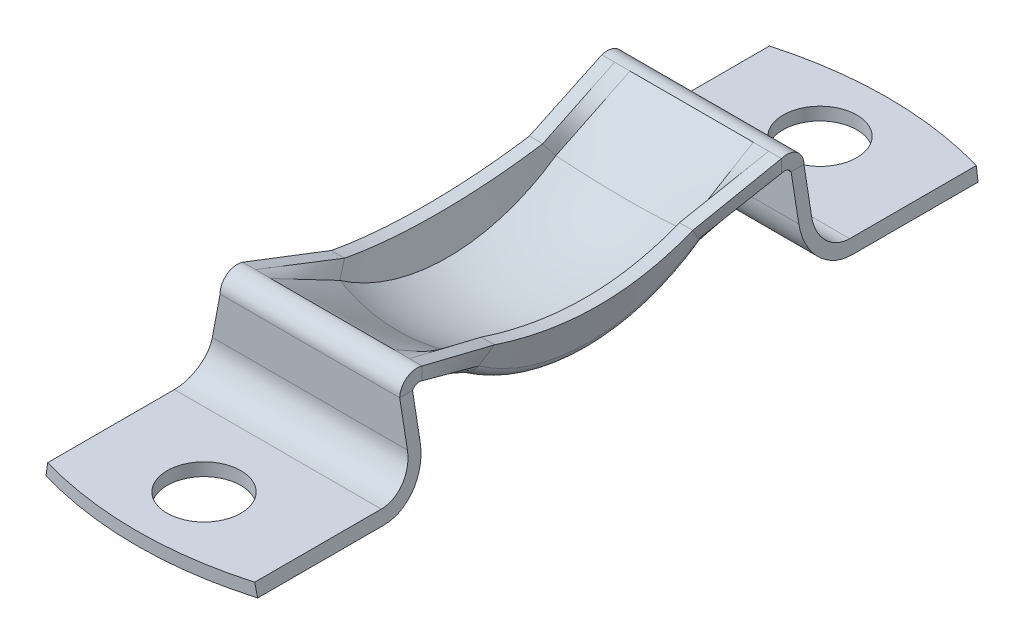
ISO-10303-21;
HEADER;
FILE_DESCRIPTION(('STEP AP214'),'2;1');
FILE_NAME('part.step','',(''),(''),'','','');
FILE_SCHEMA(('AUTOMOTIVE_DESIGN { 1 0 10303 214 1 1 1 1 }'));
ENDSEC;
DATA;
#1=APPLICATION_CONTEXT('core data for automotive mechanical design processes');
#2=APPLICATION_PROTOCOL_DEFINITION('international standard','automotive_design',2000,#1);
#3=PRODUCT_CONTEXT('',#1,'mechanical');
#4=PRODUCT('Part','Part','',(#3));
#5=PRODUCT_RELATED_PRODUCT_CATEGORY('part','',(#4));
#6=PRODUCT_DEFINITION_FORMATION('','',#4);
#7=PRODUCT_DEFINITION_CONTEXT('part definition',#1,'design');
#8=PRODUCT_DEFINITION('design','',#6,#7);
#9=PRODUCT_DEFINITION_SHAPE('','',#8);
#10=(LENGTH_UNIT() NAMED_UNIT(*) SI_UNIT(.MILLI.,.METRE.));
#11=(NAMED_UNIT(*) PLANE_ANGLE_UNIT() SI_UNIT($,.RADIAN.));
#12=(NAMED_UNIT(*) SI_UNIT($,.STERADIAN.) SOLID_ANGLE_UNIT());
#13=UNCERTAINTY_MEASURE_WITH_UNIT(LENGTH_MEASURE(1.E-05),#10,'distance_accuracy_value','');
#14=(GEOMETRIC_REPRESENTATION_CONTEXT(3) GLOBAL_UNCERTAINTY_ASSIGNED_CONTEXT((#13)) GLOBAL_UNIT_ASSIGNED_CONTEXT((#10,
#11,#12)) REPRESENTATION_CONTEXT('',''));
#15=CARTESIAN_POINT('',(0.,0.,0.));
#16=DIRECTION('',(0.,0.,1.));
#17=DIRECTION('',(1.,0.,0.));
#18=AXIS2_PLACEMENT_3D('',#15,#16,#17);
#19=CARTESIAN_POINT('',(0.,0.,0.));
#20=DIRECTION('',(-1.,0.,0.));
#21=DIRECTION('',(0.,-0.819152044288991,-0.573576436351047));
#22=AXIS2_PLACEMENT_3D('',#19,#20,#21);
#23=SPHERICAL_SURFACE('',#22,31.);
#24=CARTESIAN_POINT('',(-10.,0.,0.));
#25=DIRECTION('',(-1.,0.,0.));
#26=DIRECTION('',(0.,0.,1.));
#27=AXIS2_PLACEMENT_3D('',#24,#25,#26);
#28=CIRCLE('',#27,29.3428015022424);
#29=CARTESIAN_POINT('',(-10.,-24.036215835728,-16.8303395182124));
#30=VERTEX_POINT('',#29);
#31=CARTESIAN_POINT('',(-10.,-24.036215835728,16.8303395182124));
#32=VERTEX_POINT('',#31);
#33=EDGE_CURVE('E1012',#30,#32,#28,.T.);
#34=ORIENTED_EDGE('',*,*,#33,.T.);
#35=CARTESIAN_POINT('',(10.,-24.036215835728,16.8303395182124));
#36=CARTESIAN_POINT('',(9.59842516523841,-24.148321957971,16.9088370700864));
#37=CARTESIAN_POINT('',(9.19403654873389,-24.2536611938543,16.9825963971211));
#38=CARTESIAN_POINT('',(8.38032349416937,-24.4506620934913,17.1205379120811));
#39=CARTESIAN_POINT('',(7.97099904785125,-24.5423237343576,17.1847200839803));
#40=CARTESIAN_POINT('',(7.14810807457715,-24.7118251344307,17.3034062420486));
#41=CARTESIAN_POINT('',(6.73454155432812,-24.7896649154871,17.3579102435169));
#42=CARTESIAN_POINT('',(5.90385892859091,-24.9313784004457,17.4571390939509));
#43=CARTESIAN_POINT('',(5.48674283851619,-24.995252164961,17.5018639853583));
#44=CARTESIAN_POINT('',(4.64965563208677,-25.1088891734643,17.581433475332));
#45=CARTESIAN_POINT('',(4.22968451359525,-25.1586524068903,17.6162780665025));
#46=CARTESIAN_POINT('',(3.38760178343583,-25.2440213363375,17.6760540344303));
#47=CARTESIAN_POINT('',(2.96549016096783,-25.2796269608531,17.7009853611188));
#48=CARTESIAN_POINT('',(2.11983939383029,-25.3366336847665,17.7409018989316));
#49=CARTESIAN_POINT('',(1.69630024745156,-25.358034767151,17.755887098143));
#50=CARTESIAN_POINT('',(0.848507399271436,-25.3865852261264,17.775878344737));
#51=CARTESIAN_POINT('',(0.424253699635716,-25.393734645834,17.78088442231));
#52=CARTESIAN_POINT('',(-0.424253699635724,-25.393734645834,17.78088442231));
#53=CARTESIAN_POINT('',(-0.848507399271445,-25.3865852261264,17.775878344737));
#54=CARTESIAN_POINT('',(-1.69630024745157,-25.358034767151,17.755887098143));
#55=CARTESIAN_POINT('',(-2.1198393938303,-25.3366336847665,17.7409018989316));
#56=CARTESIAN_POINT('',(-2.96549016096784,-25.2796269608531,17.7009853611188));
#57=CARTESIAN_POINT('',(-3.38760178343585,-25.2440213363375,17.6760540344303));
#58=CARTESIAN_POINT('',(-4.22968451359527,-25.1586524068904,17.6162780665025));
#59=CARTESIAN_POINT('',(-4.64965563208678,-25.1088891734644,17.581433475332));
#60=CARTESIAN_POINT('',(-5.48674283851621,-24.995252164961,17.5018639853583));
#61=CARTESIAN_POINT('',(-5.90385892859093,-24.9313784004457,17.4571390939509));
#62=CARTESIAN_POINT('',(-6.73454155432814,-24.7896649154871,17.3579102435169));
#63=CARTESIAN_POINT('',(-7.14810807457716,-24.7118251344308,17.3034062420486));
#64=CARTESIAN_POINT('',(-7.97099904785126,-24.5423237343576,17.1847200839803));
#65=CARTESIAN_POINT('',(-8.38032349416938,-24.4506620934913,17.1205379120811));
#66=CARTESIAN_POINT('',(-9.19403654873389,-24.2536611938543,16.9825963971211));
#67=CARTESIAN_POINT('',(-9.59842516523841,-24.148321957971,16.9088370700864));
#68=CARTESIAN_POINT('',(-10.,-24.036215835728,16.8303395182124));
#69=B_SPLINE_CURVE_WITH_KNOTS('',3,(#35,#36,#37,#38,#39,#40,#41,#42,#43,#44,#45,#46,#47,#48,#49,
#50,#51,#52,#53,#54,#55,#56,#57,#58,#59,#60,#61,#62,#63,#64,#65,#66,#67,#68),.UNSPECIFIED.,.F.,
.F.,(4,2,2,2,2,2,2,2,2,2,2,2,2,2,2,2,4),(0.,1.27267231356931,2.5453467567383,3.81801918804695,
5.09068609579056,6.36335395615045,7.63602824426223,8.90870405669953,10.1813760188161,
11.4540479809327,12.72672379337,13.9993980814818,15.2720659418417,16.5447328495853,
17.817405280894,19.0900797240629,20.3627520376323),.UNSPECIFIED.);
#70=CARTESIAN_POINT('',(10.,-24.036215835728,16.8303395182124));
#71=VERTEX_POINT('',#70);
#72=EDGE_CURVE('E787',#71,#32,#69,.T.);
#73=ORIENTED_EDGE('',*,*,#72,.F.);
#74=CARTESIAN_POINT('',(9.99999999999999,0.,0.));
#75=DIRECTION('',(-1.,0.,0.));
#76=DIRECTION('',(0.,0.,1.));
#77=AXIS2_PLACEMENT_3D('',#74,#75,#76);
#78=CIRCLE('',#77,29.3428015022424);
#79=CARTESIAN_POINT('',(10.,-24.036215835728,-16.8303395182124));
#80=VERTEX_POINT('',#79);
#81=EDGE_CURVE('E1536',#80,#71,#78,.T.);
#82=ORIENTED_EDGE('',*,*,#81,.F.);
#83=CARTESIAN_POINT('',(-10.,-24.036215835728,-16.8303395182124));
#84=CARTESIAN_POINT('',(-9.59842516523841,-24.148321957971,-16.9088370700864));
#85=CARTESIAN_POINT('',(-9.19403654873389,-24.2536611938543,-16.9825963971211));
#86=CARTESIAN_POINT('',(-8.38032349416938,-24.4506620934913,-17.1205379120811));
#87=CARTESIAN_POINT('',(-7.97099904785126,-24.5423237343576,-17.1847200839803));
#88=CARTESIAN_POINT('',(-7.14810807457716,-24.7118251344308,-17.3034062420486));
#89=CARTESIAN_POINT('',(-6.73454155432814,-24.7896649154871,-17.3579102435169));
#90=CARTESIAN_POINT('',(-5.90385892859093,-24.9313784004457,-17.4571390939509));
#91=CARTESIAN_POINT('',(-5.48674283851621,-24.995252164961,-17.5018639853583));
#92=CARTESIAN_POINT('',(-4.64965563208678,-25.1088891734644,-17.581433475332));
#93=CARTESIAN_POINT('',(-4.22968451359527,-25.1586524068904,-17.6162780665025));
#94=CARTESIAN_POINT('',(-3.38760178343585,-25.2440213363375,-17.6760540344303));
#95=CARTESIAN_POINT('',(-2.96549016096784,-25.2796269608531,-17.7009853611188));
#96=CARTESIAN_POINT('',(-2.1198393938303,-25.3366336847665,-17.7409018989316));
#97=CARTESIAN_POINT('',(-1.69630024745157,-25.358034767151,-17.755887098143));
#98=CARTESIAN_POINT('',(-0.848507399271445,-25.3865852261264,-17.775878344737));
#99=CARTESIAN_POINT('',(-0.424253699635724,-25.393734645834,-17.78088442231));
#100=CARTESIAN_POINT('',(0.424253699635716,-25.393734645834,-17.78088442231));
#101=CARTESIAN_POINT('',(0.848507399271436,-25.3865852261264,-17.775878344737));
#102=CARTESIAN_POINT('',(1.69630024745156,-25.358034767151,-17.755887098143));
#103=CARTESIAN_POINT('',(2.11983939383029,-25.3366336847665,-17.7409018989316));
#104=CARTESIAN_POINT('',(2.96549016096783,-25.2796269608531,-17.7009853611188));
#105=CARTESIAN_POINT('',(3.38760178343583,-25.2440213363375,-17.6760540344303));
#106=CARTESIAN_POINT('',(4.22968451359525,-25.1586524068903,-17.6162780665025));
#107=CARTESIAN_POINT('',(4.64965563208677,-25.1088891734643,-17.581433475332));
#108=CARTESIAN_POINT('',(5.48674283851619,-24.995252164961,-17.5018639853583));
#109=CARTESIAN_POINT('',(5.90385892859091,-24.9313784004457,-17.4571390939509));
#110=CARTESIAN_POINT('',(6.73454155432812,-24.7896649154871,-17.3579102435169));
#111=CARTESIAN_POINT('',(7.14810807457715,-24.7118251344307,-17.3034062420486));
#112=CARTESIAN_POINT('',(7.97099904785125,-24.5423237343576,-17.1847200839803));
#113=CARTESIAN_POINT('',(8.38032349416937,-24.4506620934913,-17.1205379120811));
#114=CARTESIAN_POINT('',(9.19403654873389,-24.2536611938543,-16.9825963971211));
#115=CARTESIAN_POINT('',(9.59842516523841,-24.148321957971,-16.9088370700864));
#116=CARTESIAN_POINT('',(10.,-24.036215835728,-16.8303395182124));
#117=B_SPLINE_CURVE_WITH_KNOTS('',3,(#83,#84,#85,#86,#87,#88,#89,#90,#91,#92,#93,#94,#95,#96,
#97,#98,#99,#100,#101,#102,#103,#104,#105,#106,#107,#108,#109,#110,#111,#112,#113,#114,#115,
#116),.UNSPECIFIED.,.F.,.F.,(4,2,2,2,2,2,2,2,2,2,2,2,2,2,2,2,4),(0.,1.27267231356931,
2.54534675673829,3.81801918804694,5.09068609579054,6.36335395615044,7.63602824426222,
8.90870405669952,10.1813760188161,11.4540479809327,12.72672379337,13.9993980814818,
15.2720659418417,16.5447328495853,17.817405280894,19.0900797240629,20.3627520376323),.UNSPECIFIED.);
#118=EDGE_CURVE('E1213',#80,#30,#117,.F.);
#119=ORIENTED_EDGE('',*,*,#118,.T.);
#120=EDGE_LOOP('',(#34,#73,#82,#119));
#121=FACE_BOUND('',#120,.T.);
#122=ADVANCED_FACE('F338',(#121),#23,.F.);
#123=CARTESIAN_POINT('',(-10.,0.,0.));
#124=DIRECTION('',(1.,0.,0.));
#125=DIRECTION('',(0.,0.,-1.));
#126=AXIS2_PLACEMENT_3D('',#123,#124,#125);
#127=CONICAL_SURFACE('',#126,29.3428015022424,1.3061077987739);
#128=CARTESIAN_POINT('',(-10.5170768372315,-21.6660584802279,16.8305395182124));
#129=CARTESIAN_POINT('',(-10.5884193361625,-21.8670695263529,16.1427387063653));
#130=CARTESIAN_POINT('',(-10.6564481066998,-22.0558420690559,15.4510079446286));
#131=CARTESIAN_POINT('',(-10.7851878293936,-22.4086262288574,14.0605602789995));
#132=CARTESIAN_POINT('',(-10.8458985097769,-22.5726369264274,13.3618431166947));
#133=CARTESIAN_POINT('',(-10.9593177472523,-22.8756291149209,11.9582058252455));
#134=CARTESIAN_POINT('',(-11.0120246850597,-23.0146055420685,11.253284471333));
#135=CARTESIAN_POINT('',(-11.1087563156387,-23.2672345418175,9.83833396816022));
#136=CARTESIAN_POINT('',(-11.152781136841,-23.3808874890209,9.12830489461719));
#137=CARTESIAN_POINT('',(-11.2306565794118,-23.580382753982,7.72014506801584));
#138=CARTESIAN_POINT('',(-11.2647139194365,-23.6667935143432,7.02210626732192));
#139=CARTESIAN_POINT('',(-11.3234725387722,-23.8150477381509,5.62303317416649));
#140=CARTESIAN_POINT('',(-11.348173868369,-23.8768913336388,4.92199889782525));
#141=CARTESIAN_POINT('',(-11.3878481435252,-23.975882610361,3.51801062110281));
#142=CARTESIAN_POINT('',(-11.4028224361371,-24.0130337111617,2.81505690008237));
#143=CARTESIAN_POINT('',(-11.4228153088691,-24.0625785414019,1.40813546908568));
#144=CARTESIAN_POINT('',(-11.427833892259,-24.0749722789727,0.704167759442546));
#145=CARTESIAN_POINT('',(-11.4278357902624,-24.074976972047,-0.70378403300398));
#146=CARTESIAN_POINT('',(-11.4228188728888,-24.0625873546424,-1.40776811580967));
#147=CARTESIAN_POINT('',(-11.4028288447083,-24.0130496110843,-2.8147224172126));
#148=CARTESIAN_POINT('',(-11.3878557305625,-23.9759014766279,-3.51769263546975));
#149=CARTESIAN_POINT('',(-11.348183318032,-23.8769149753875,-4.92171397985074));
#150=CARTESIAN_POINT('',(-11.3234826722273,-23.8150731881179,-5.62276482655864));
#151=CARTESIAN_POINT('',(-11.2647249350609,-23.6668214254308,-7.02187103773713));
#152=CARTESIAN_POINT('',(-11.2306677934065,-23.5804113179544,-7.71992638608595));
#153=CARTESIAN_POINT('',(-11.152792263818,-23.3809161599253,-9.12811996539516));
#154=CARTESIAN_POINT('',(-11.108767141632,-23.2672626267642,-9.83816623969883));
#155=CARTESIAN_POINT('',(-11.0120344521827,-23.0146312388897,-11.2531509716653));
#156=CARTESIAN_POINT('',(-10.9593267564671,-22.875653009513,-11.9580893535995));
#157=CARTESIAN_POINT('',(-10.8459055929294,-22.5726560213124,-13.3617604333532));
#158=CARTESIAN_POINT('',(-10.7851937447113,-22.4086423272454,-14.0604943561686));
#159=CARTESIAN_POINT('',(-10.6564513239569,-22.0558509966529,-15.4509752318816));
#160=CARTESIAN_POINT('',(-10.5884210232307,-21.8670742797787,-16.1427224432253));
#161=CARTESIAN_POINT('',(-10.5170768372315,-21.6660584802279,-16.8305395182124));
#162=B_SPLINE_CURVE_WITH_KNOTS('',3,(#128,#129,#130,#131,#132,#133,#134,#135,#136,#137,#138,
#139,#140,#141,#142,#143,#144,#145,#146,#147,#148,#149,#150,#151,#152,#153,#154,#155,#156,#157,
#158,#159,#160,#161),.UNSPECIFIED.,.F.,.F.,(4,2,2,2,2,2,2,2,2,2,2,2,2,2,2,2,4),(0.,
2.16023554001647,4.3205512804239,6.48130350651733,8.64202376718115,10.7541049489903,
12.8661747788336,14.9779520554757,17.0897286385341,19.2015540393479,21.313380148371,
23.4254988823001,25.5376289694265,27.6984003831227,29.8592037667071,32.0195705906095,
34.1798572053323),.UNSPECIFIED.);
#163=CARTESIAN_POINT('',(-10.6559755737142,-22.0537500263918,15.4422020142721));
#164=VERTEX_POINT('',#163);
#165=CARTESIAN_POINT('',(-10.6559755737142,-22.0537500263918,-15.4422020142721));
#166=VERTEX_POINT('',#165);
#167=EDGE_CURVE('E1024',#164,#166,#162,.T.);
#168=ORIENTED_EDGE('',*,*,#167,.F.);
#169=DIRECTION('',(0.261608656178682,-0.790624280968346,0.553601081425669));
#170=VECTOR('',#169,1.);
#171=CARTESIAN_POINT('',(-10.,-24.036215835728,16.8303395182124));
#172=LINE('',#171,#170);
#173=EDGE_CURVE('E766',#32,#164,#172,.F.);
#174=ORIENTED_EDGE('',*,*,#173,.F.);
#175=ORIENTED_EDGE('',*,*,#33,.F.);
#176=DIRECTION('',(0.261608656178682,-0.790624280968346,-0.553601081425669));
#177=VECTOR('',#176,1.);
#178=CARTESIAN_POINT('',(-10.,-24.036215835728,-16.8303395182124));
#179=LINE('',#178,#177);
#180=EDGE_CURVE('E1230',#30,#166,#179,.F.);
#181=ORIENTED_EDGE('',*,*,#180,.T.);
#182=EDGE_LOOP('',(#168,#174,#175,#181));
#183=FACE_BOUND('',#182,.T.);
#184=ADVANCED_FACE('F340',(#183),#127,.F.);
#185=CARTESIAN_POINT('',(-13.5,0.,0.));
#186=DIRECTION('',(1.,0.,0.));
#187=DIRECTION('',(0.,0.,-1.));
#188=AXIS2_PLACEMENT_3D('',#185,#186,#187);
#189=CONICAL_SURFACE('',#188,24.0749746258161,1.3061077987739);
#190=CARTESIAN_POINT('',(-12.557878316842,-21.5775051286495,-17.1306446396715));
#191=CARTESIAN_POINT('',(-12.6315388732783,-21.785924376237,-16.4310665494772));
#192=CARTESIAN_POINT('',(-12.7018126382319,-21.9816643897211,-15.7273442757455));
#193=CARTESIAN_POINT('',(-12.834855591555,-22.3474823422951,-14.3125304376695));
#194=CARTESIAN_POINT('',(-12.8976244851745,-22.5175592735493,-13.6014385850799));
#195=CARTESIAN_POINT('',(-13.0149334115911,-22.831764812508,-12.1727061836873));
#196=CARTESIAN_POINT('',(-13.0694716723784,-22.9758878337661,-11.4550642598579));
#197=CARTESIAN_POINT('',(-13.1695949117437,-23.237868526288,-10.0143896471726));
#198=CARTESIAN_POINT('',(-13.2151800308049,-23.3557266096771,-9.29135704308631));
#199=CARTESIAN_POINT('',(-13.2957997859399,-23.5625075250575,-7.85783528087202));
#200=CARTESIAN_POINT('',(-13.3310555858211,-23.6520408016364,-7.14744660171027));
#201=CARTESIAN_POINT('',(-13.3918949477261,-23.8056552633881,-5.72351102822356));
#202=CARTESIAN_POINT('',(-13.41747856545,-23.8697365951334,-5.00996415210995));
#203=CARTESIAN_POINT('',(-13.4585746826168,-23.9723090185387,-3.58084887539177));
#204=CARTESIAN_POINT('',(-13.4740886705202,-24.0108038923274,-2.86528078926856));
#205=CARTESIAN_POINT('',(-13.4948018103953,-24.0621378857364,-1.43307511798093));
#206=CARTESIAN_POINT('',(-13.5000009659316,-24.0749770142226,-0.716437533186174));
#207=CARTESIAN_POINT('',(-13.4999990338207,-24.074972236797,0.716821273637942));
#208=CARTESIAN_POINT('',(-13.4947981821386,-24.0621289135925,1.43344249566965));
#209=CARTESIAN_POINT('',(-13.4740821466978,-24.0107877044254,2.86561531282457));
#210=CARTESIAN_POINT('',(-13.4585669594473,-23.9722898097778,3.58116690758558));
#211=CARTESIAN_POINT('',(-13.4174689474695,-23.8697125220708,5.01024912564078));
#212=CARTESIAN_POINT('',(-13.3918846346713,-23.8056293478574,5.72377943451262));
#213=CARTESIAN_POINT('',(-13.3310443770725,-23.652012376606,7.1476818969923));
#214=CARTESIAN_POINT('',(-13.2957883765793,-23.5624784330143,7.85805403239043));
#215=CARTESIAN_POINT('',(-13.2151687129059,-23.3556974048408,9.29154202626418));
#216=CARTESIAN_POINT('',(-13.1695839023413,-23.2378399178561,10.014557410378));
#217=CARTESIAN_POINT('',(-13.0694617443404,-22.9758616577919,11.4551977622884));
#218=CARTESIAN_POINT('',(-13.0149242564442,-22.8317404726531,12.1728226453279));
#219=CARTESIAN_POINT('',(-12.897617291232,-22.5175398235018,13.6015212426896));
#220=CARTESIAN_POINT('',(-12.8348495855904,-22.3474659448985,14.3125963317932));
#221=CARTESIAN_POINT('',(-12.7018093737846,-21.9816552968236,15.7273769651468));
#222=CARTESIAN_POINT('',(-12.631537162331,-21.7859195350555,16.4310827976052));
#223=CARTESIAN_POINT('',(-12.557878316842,-21.5775051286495,17.1306446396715));
#224=B_SPLINE_CURVE_WITH_KNOTS('',3,(#190,#191,#192,#193,#194,#195,#196,#197,#198,#199,#200,
#201,#202,#203,#204,#205,#206,#207,#208,#209,#210,#211,#212,#213,#214,#215,#216,#217,#218,#219,
#220,#221,#222,#223),.UNSPECIFIED.,.F.,.F.,(4,2,2,2,2,2,2,2,2,2,2,2,2,2,2,2,4),(0.,
2.20090040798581,4.40188722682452,6.60334723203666,8.8047726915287,10.9548826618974,
13.1049802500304,15.2547599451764,17.4045388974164,19.5542690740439,21.7039999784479,
23.8540487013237,26.0041098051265,28.2054840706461,30.4068928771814,32.607828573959,
34.8086778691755),.UNSPECIFIED.);
#225=CARTESIAN_POINT('',(-12.7281407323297,-22.0537500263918,-15.4422020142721));
#226=VERTEX_POINT('',#225);
#227=CARTESIAN_POINT('',(-12.7281407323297,-22.0537500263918,15.4422020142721));
#228=VERTEX_POINT('',#227);
#229=EDGE_CURVE('E1010',#226,#228,#224,.T.);
#230=ORIENTED_EDGE('',*,*,#229,.F.);
#231=DIRECTION('',(0.261608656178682,-0.790624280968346,-0.553601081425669));
#232=VECTOR('',#231,1.);
#233=CARTESIAN_POINT('',(-13.5,-19.7210646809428,-13.8088381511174));
#234=LINE('',#233,#232);
#235=CARTESIAN_POINT('',(-11.9303480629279,-24.4648103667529,-17.1304446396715));
#236=VERTEX_POINT('',#235);
#237=EDGE_CURVE('E1011',#226,#236,#234,.T.);
#238=ORIENTED_EDGE('',*,*,#237,.T.);
#239=CARTESIAN_POINT('',(-11.9303480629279,0.,0.));
#240=DIRECTION('',(-1.,0.,0.));
#241=DIRECTION('',(0.,0.,1.));
#242=AXIS2_PLACEMENT_3D('',#239,#240,#241);
#243=CIRCLE('',#242,29.8660188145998);
#244=CARTESIAN_POINT('',(-11.9303480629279,-24.4648103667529,17.1304446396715));
#245=VERTEX_POINT('',#244);
#246=EDGE_CURVE('E1006',#236,#245,#243,.T.);
#247=ORIENTED_EDGE('',*,*,#246,.T.);
#248=DIRECTION('',(0.261608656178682,-0.790624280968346,0.553601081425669));
#249=VECTOR('',#248,1.);
#250=CARTESIAN_POINT('',(-13.5,-19.7210646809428,13.8088381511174));
#251=LINE('',#250,#249);
#252=EDGE_CURVE('E902',#228,#245,#251,.T.);
#253=ORIENTED_EDGE('',*,*,#252,.F.);
#254=EDGE_LOOP('',(#230,#238,#247,#253));
#255=FACE_BOUND('',#254,.T.);
#256=ADVANCED_FACE('F957',(#255),#189,.T.);
#257=CARTESIAN_POINT('',(-10.,0.,0.));
#258=DIRECTION('',(-1.,0.,0.));
#259=DIRECTION('',(0.,0.,1.));
#260=AXIS2_PLACEMENT_3D('',#257,#258,#259);
#261=TOROIDAL_SURFACE('',#260,29.3428015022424,2.);
#262=CARTESIAN_POINT('',(-10.6451612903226,0.,0.));
#263=DIRECTION('',(-1.,0.,0.));
#264=DIRECTION('',(0.,0.,1.));
#265=AXIS2_PLACEMENT_3D('',#262,#263,#264);
#266=CIRCLE('',#265,31.235885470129);
#267=CARTESIAN_POINT('',(-10.6451612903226,-25.586939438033,-17.9161678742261));
#268=VERTEX_POINT('',#267);
#269=CARTESIAN_POINT('',(-10.6451612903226,-25.586939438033,17.9161678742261));
#270=VERTEX_POINT('',#269);
#271=EDGE_CURVE('E991',#268,#270,#266,.T.);
#272=ORIENTED_EDGE('',*,*,#271,.T.);
#273=CARTESIAN_POINT('',(-11.9303480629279,-24.4648103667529,17.1304446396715));
#274=CARTESIAN_POINT('',(-11.9217960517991,-24.4906648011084,17.148533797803));
#275=CARTESIAN_POINT('',(-11.9124691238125,-24.5163869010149,17.1664453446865));
#276=CARTESIAN_POINT('',(-11.8922909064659,-24.5674397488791,17.2019634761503));
#277=CARTESIAN_POINT('',(-11.8814396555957,-24.5927705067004,17.2195700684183));
#278=CARTESIAN_POINT('',(-11.8582368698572,-24.642917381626,17.2545309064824));
#279=CARTESIAN_POINT('',(-11.8458852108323,-24.6677334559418,17.2718851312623));
#280=CARTESIAN_POINT('',(-11.8197120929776,-24.7167775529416,17.3063151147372));
#281=CARTESIAN_POINT('',(-11.8058906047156,-24.7410055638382,17.3233908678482));
#282=CARTESIAN_POINT('',(-11.7768477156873,-24.7887779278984,17.3571469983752));
#283=CARTESIAN_POINT('',(-11.7616299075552,-24.8123238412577,17.3738282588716));
#284=CARTESIAN_POINT('',(-11.7298024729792,-24.8588373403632,17.4066561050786));
#285=CARTESIAN_POINT('',(-11.7131929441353,-24.8818049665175,17.4228027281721));
#286=CARTESIAN_POINT('',(-11.6786258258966,-24.9271009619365,17.4545204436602));
#287=CARTESIAN_POINT('',(-11.6606686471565,-24.9494295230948,17.4700917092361));
#288=CARTESIAN_POINT('',(-11.6234418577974,-24.9933497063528,17.500708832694));
#289=CARTESIAN_POINT('',(-11.6041719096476,-25.0149411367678,17.5157545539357));
#290=CARTESIAN_POINT('',(-11.5499343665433,-25.072661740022,17.5560431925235));
#291=CARTESIAN_POINT('',(-11.5137130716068,-25.1079840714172,17.58077225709));
#292=CARTESIAN_POINT('',(-11.4377717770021,-25.1760146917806,17.6283602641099));
#293=CARTESIAN_POINT('',(-11.3980519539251,-25.2087231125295,17.6512193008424));
#294=CARTESIAN_POINT('',(-11.3154243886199,-25.2712376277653,17.6949418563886));
#295=CARTESIAN_POINT('',(-11.2725195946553,-25.3010463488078,17.7158071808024));
#296=CARTESIAN_POINT('',(-11.1838164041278,-25.3575004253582,17.7555132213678));
#297=CARTESIAN_POINT('',(-11.1380184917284,-25.3841463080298,17.7743542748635));
#298=CARTESIAN_POINT('',(-11.0214926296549,-25.4462325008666,17.8178890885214));
#299=CARTESIAN_POINT('',(-10.9492287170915,-25.4798625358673,17.8411296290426));
#300=CARTESIAN_POINT('',(-10.8375178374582,-25.524429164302,17.8722152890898));
#301=CARTESIAN_POINT('',(-10.7997238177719,-25.538306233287,17.8819488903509));
#302=CARTESIAN_POINT('',(-10.7231496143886,-25.5640973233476,17.9000804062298));
#303=CARTESIAN_POINT('',(-10.6843692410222,-25.5760109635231,17.9084780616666));
#304=CARTESIAN_POINT('',(-10.6451612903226,-25.586939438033,17.9161678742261));
#305=B_SPLINE_CURVE_WITH_KNOTS('',3,(#273,#274,#275,#276,#277,#278,#279,#280,#281,#282,#283,
#284,#285,#286,#287,#288,#289,#290,#291,#292,#293,#294,#295,#296,#297,#298,#299,#300,#301,#302,
#303,#304),.UNSPECIFIED.,.F.,.F.,(4,2,2,2,2,2,2,2,2,2,2,2,2,2,2,4),(0.,0.0980676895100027,
0.196132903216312,0.294206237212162,0.392281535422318,0.490111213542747,0.58793403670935,
0.685727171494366,0.783545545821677,0.952268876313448,1.12098369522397,1.28954424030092,
1.45807665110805,1.70641294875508,1.83060979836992,1.95483071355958),.UNSPECIFIED.);
#306=EDGE_CURVE('E907',#245,#270,#305,.T.);
#307=ORIENTED_EDGE('',*,*,#306,.F.);
#308=ORIENTED_EDGE('',*,*,#246,.F.);
#309=CARTESIAN_POINT('',(-11.9303480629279,-24.4648103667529,-17.1304446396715));
#310=CARTESIAN_POINT('',(-11.9217960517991,-24.4906648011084,-17.148533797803));
#311=CARTESIAN_POINT('',(-11.9124691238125,-24.5163869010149,-17.1664453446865));
#312=CARTESIAN_POINT('',(-11.8922909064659,-24.5674397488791,-17.2019634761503));
#313=CARTESIAN_POINT('',(-11.8814396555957,-24.5927705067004,-17.2195700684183));
#314=CARTESIAN_POINT('',(-11.8582368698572,-24.642917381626,-17.2545309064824));
#315=CARTESIAN_POINT('',(-11.8458852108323,-24.6677334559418,-17.2718851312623));
#316=CARTESIAN_POINT('',(-11.8197120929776,-24.7167775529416,-17.3063151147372));
#317=CARTESIAN_POINT('',(-11.8058906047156,-24.7410055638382,-17.3233908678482));
#318=CARTESIAN_POINT('',(-11.7768477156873,-24.7887779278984,-17.3571469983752));
#319=CARTESIAN_POINT('',(-11.7616299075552,-24.8123238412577,-17.3738282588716));
#320=CARTESIAN_POINT('',(-11.7298024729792,-24.8588373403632,-17.4066561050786));
#321=CARTESIAN_POINT('',(-11.7131929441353,-24.8818049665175,-17.4228027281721));
#322=CARTESIAN_POINT('',(-11.6786258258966,-24.9271009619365,-17.4545204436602));
#323=CARTESIAN_POINT('',(-11.6606686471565,-24.9494295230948,-17.4700917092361));
#324=CARTESIAN_POINT('',(-11.6234418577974,-24.9933497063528,-17.500708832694));
#325=CARTESIAN_POINT('',(-11.6041719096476,-25.0149411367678,-17.5157545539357));
#326=CARTESIAN_POINT('',(-11.5499343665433,-25.072661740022,-17.5560431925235));
#327=CARTESIAN_POINT('',(-11.5137130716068,-25.1079840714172,-17.58077225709));
#328=CARTESIAN_POINT('',(-11.4377717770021,-25.1760146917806,-17.6283602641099));
#329=CARTESIAN_POINT('',(-11.3980519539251,-25.2087231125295,-17.6512193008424));
#330=CARTESIAN_POINT('',(-11.3154243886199,-25.2712376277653,-17.6949418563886));
#331=CARTESIAN_POINT('',(-11.2725195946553,-25.3010463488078,-17.7158071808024));
#332=CARTESIAN_POINT('',(-11.1838164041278,-25.3575004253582,-17.7555132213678));
#333=CARTESIAN_POINT('',(-11.1380184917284,-25.3841463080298,-17.7743542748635));
#334=CARTESIAN_POINT('',(-11.0214926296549,-25.4462325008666,-17.8178890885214));
#335=CARTESIAN_POINT('',(-10.9492287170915,-25.4798625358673,-17.8411296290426));
#336=CARTESIAN_POINT('',(-10.8375178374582,-25.524429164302,-17.8722152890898));
#337=CARTESIAN_POINT('',(-10.7997238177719,-25.538306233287,-17.8819488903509));
#338=CARTESIAN_POINT('',(-10.7231496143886,-25.5640973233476,-17.9000804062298));
#339=CARTESIAN_POINT('',(-10.6843692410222,-25.5760109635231,-17.9084780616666));
#340=CARTESIAN_POINT('',(-10.6451612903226,-25.586939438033,-17.9161678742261));
#341=B_SPLINE_CURVE_WITH_KNOTS('',3,(#309,#310,#311,#312,#313,#314,#315,#316,#317,#318,#319,
#320,#321,#322,#323,#324,#325,#326,#327,#328,#329,#330,#331,#332,#333,#334,#335,#336,#337,#338,
#339,#340),.UNSPECIFIED.,.F.,.F.,(4,2,2,2,2,2,2,2,2,2,2,2,2,2,2,4),(0.,0.0980676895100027,
0.196132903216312,0.294206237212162,0.392281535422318,0.490111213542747,0.58793403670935,
0.685727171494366,0.783545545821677,0.952268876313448,1.12098369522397,1.28954424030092,
1.45807665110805,1.70641294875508,1.83060979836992,1.95483071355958),.UNSPECIFIED.);
#342=EDGE_CURVE('E1045',#236,#268,#341,.T.);
#343=ORIENTED_EDGE('',*,*,#342,.T.);
#344=EDGE_LOOP('',(#272,#307,#308,#343));
#345=FACE_BOUND('',#344,.T.);
#346=ADVANCED_FACE('F1005',(#345),#261,.T.);
#347=CARTESIAN_POINT('',(0.,0.,0.));
#348=DIRECTION('',(-1.,0.,0.));
#349=DIRECTION('',(0.,-0.819152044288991,-0.573576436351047));
#350=AXIS2_PLACEMENT_3D('',#347,#348,#349);
#351=SPHERICAL_SURFACE('',#350,33.);
#352=CARTESIAN_POINT('',(10.6451612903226,0.,0.));
#353=DIRECTION('',(-1.,0.,0.));
#354=DIRECTION('',(0.,0.,1.));
#355=AXIS2_PLACEMENT_3D('',#352,#353,#354);
#356=CIRCLE('',#355,31.235885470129);
#357=CARTESIAN_POINT('',(10.6451612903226,-25.586939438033,-17.9161678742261));
#358=VERTEX_POINT('',#357);
#359=CARTESIAN_POINT('',(10.6451612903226,-25.586939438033,17.9161678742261));
#360=VERTEX_POINT('',#359);
#361=EDGE_CURVE('E994',#358,#360,#356,.T.);
#362=ORIENTED_EDGE('',*,*,#361,.T.);
#363=CARTESIAN_POINT('',(-11.9303480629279,-24.4648103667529,17.1304446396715));
#364=CARTESIAN_POINT('',(-11.8816861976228,-24.611874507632,17.2334200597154));
#365=CARTESIAN_POINT('',(-11.7429463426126,-24.8730322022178,17.4162846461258));
#366=CARTESIAN_POINT('',(-11.4483173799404,-25.1881095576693,17.6369041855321));
#367=CARTESIAN_POINT('',(-11.0828457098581,-25.4312855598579,17.8071778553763));
#368=CARTESIAN_POINT('',(-10.7977575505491,-25.5443397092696,17.8863392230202));
#369=CARTESIAN_POINT('',(-8.93359746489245,-26.0647503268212,18.2507346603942));
#370=CARTESIAN_POINT('',(-5.41690863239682,-26.788786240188,18.7577100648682));
#371=CARTESIAN_POINT('',(0.,-27.1536629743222,19.0131995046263));
#372=CARTESIAN_POINT('',(5.41690863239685,-26.7887862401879,18.7577100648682));
#373=CARTESIAN_POINT('',(8.93359746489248,-26.0647503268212,18.2507346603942));
#374=CARTESIAN_POINT('',(10.7977575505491,-25.5443397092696,17.8863392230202));
#375=CARTESIAN_POINT('',(11.0828457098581,-25.4312855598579,17.8071778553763));
#376=CARTESIAN_POINT('',(11.4483173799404,-25.1881095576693,17.6369041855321));
#377=CARTESIAN_POINT('',(11.7429463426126,-24.8730322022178,17.4162846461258));
#378=CARTESIAN_POINT('',(11.8816861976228,-24.611874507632,17.2334200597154));
#379=CARTESIAN_POINT('',(11.9303480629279,-24.4648103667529,17.1304446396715));
#380=B_SPLINE_CURVE_WITH_KNOTS('',3,(#363,#364,#365,#366,#367,#368,#369,#370,#371,#372,#373,
#374,#375,#376,#377,#378,#379),.UNSPECIFIED.,.F.,.F.,(4,1,1,1,2,1,1,1,2,1,1,1,4),
(0.0791177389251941,0.0950405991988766,0.110963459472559,0.126886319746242,0.142809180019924,
0.321404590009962,0.5,0.678595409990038,0.857190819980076,0.873113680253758,0.889036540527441,
0.904959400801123,0.920882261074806),.UNSPECIFIED.);
#381=EDGE_CURVE('E987',#270,#360,#380,.T.);
#382=ORIENTED_EDGE('',*,*,#381,.F.);
#383=ORIENTED_EDGE('',*,*,#271,.F.);
#384=CARTESIAN_POINT('',(11.9303480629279,-24.4648103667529,-17.1304446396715));
#385=CARTESIAN_POINT('',(11.8816861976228,-24.611874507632,-17.2334200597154));
#386=CARTESIAN_POINT('',(11.7429463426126,-24.8730322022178,-17.4162846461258));
#387=CARTESIAN_POINT('',(11.4483173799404,-25.1881095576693,-17.6369041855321));
#388=CARTESIAN_POINT('',(11.0828457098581,-25.4312855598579,-17.8071778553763));
#389=CARTESIAN_POINT('',(10.7977575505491,-25.5443397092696,-17.8863392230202));
#390=CARTESIAN_POINT('',(8.93359746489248,-26.0647503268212,-18.2507346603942));
#391=CARTESIAN_POINT('',(5.41690863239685,-26.7887862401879,-18.7577100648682));
#392=CARTESIAN_POINT('',(0.,-27.1536629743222,-19.0131995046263));
#393=CARTESIAN_POINT('',(-5.41690863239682,-26.788786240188,-18.7577100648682));
#394=CARTESIAN_POINT('',(-8.93359746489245,-26.0647503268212,-18.2507346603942));
#395=CARTESIAN_POINT('',(-10.7977575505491,-25.5443397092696,-17.8863392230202));
#396=CARTESIAN_POINT('',(-11.0828457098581,-25.4312855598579,-17.8071778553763));
#397=CARTESIAN_POINT('',(-11.4483173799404,-25.1881095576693,-17.6369041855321));
#398=CARTESIAN_POINT('',(-11.7429463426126,-24.8730322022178,-17.4162846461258));
#399=CARTESIAN_POINT('',(-11.8816861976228,-24.611874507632,-17.2334200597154));
#400=CARTESIAN_POINT('',(-11.9303480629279,-24.4648103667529,-17.1304446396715));
#401=B_SPLINE_CURVE_WITH_KNOTS('',3,(#384,#385,#386,#387,#388,#389,#390,#391,#392,#393,#394,
#395,#396,#397,#398,#399,#400),.UNSPECIFIED.,.F.,.F.,(4,1,1,1,2,1,1,1,2,1,1,1,4),
(0.0791177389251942,0.0950405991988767,0.110963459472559,0.126886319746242,0.142809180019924,
0.321404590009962,0.5,0.678595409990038,0.857190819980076,0.873113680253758,0.889036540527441,
0.904959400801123,0.920882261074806),.UNSPECIFIED.);
#402=EDGE_CURVE('E2013',#268,#358,#401,.F.);
#403=ORIENTED_EDGE('',*,*,#402,.T.);
#404=EDGE_LOOP('',(#362,#382,#383,#403));
#405=FACE_BOUND('',#404,.T.);
#406=ADVANCED_FACE('F989',(#405),#351,.T.);
#407=CARTESIAN_POINT('',(10.,0.,0.));
#408=DIRECTION('',(-1.,0.,0.));
#409=DIRECTION('',(0.,0.,1.));
#410=AXIS2_PLACEMENT_3D('',#407,#408,#409);
#411=TOROIDAL_SURFACE('',#410,29.3428015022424,2.00000000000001);
#412=CARTESIAN_POINT('',(11.9303480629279,0.,0.));
#413=DIRECTION('',(-1.,0.,0.));
#414=DIRECTION('',(0.,0.,1.));
#415=AXIS2_PLACEMENT_3D('',#412,#413,#414);
#416=CIRCLE('',#415,29.8660188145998);
#417=CARTESIAN_POINT('',(11.9303480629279,-24.4648103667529,-17.1304446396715));
#418=VERTEX_POINT('',#417);
#419=CARTESIAN_POINT('',(11.9303480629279,-24.4648103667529,17.1304446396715));
#420=VERTEX_POINT('',#419);
#421=EDGE_CURVE('E2002',#418,#420,#416,.T.);
#422=ORIENTED_EDGE('',*,*,#421,.T.);
#423=CARTESIAN_POINT('',(10.6451612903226,-25.586939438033,17.9161678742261));
#424=CARTESIAN_POINT('',(10.6717909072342,-25.5795096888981,17.9109569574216));
#425=CARTESIAN_POINT('',(10.6982287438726,-25.5716313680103,17.9054058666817));
#426=CARTESIAN_POINT('',(10.7506737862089,-25.5549697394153,17.8936675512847));
#427=CARTESIAN_POINT('',(10.7766810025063,-25.5461864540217,17.8874803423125));
#428=CARTESIAN_POINT('',(10.8282179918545,-25.5277070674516,17.8745140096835));
#429=CARTESIAN_POINT('',(10.8537477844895,-25.5180110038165,17.8677349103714));
#430=CARTESIAN_POINT('',(10.9042859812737,-25.4977250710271,17.8535936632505));
#431=CARTESIAN_POINT('',(10.9292943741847,-25.487135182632,17.8462315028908));
#432=CARTESIAN_POINT('',(10.9787141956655,-25.4651069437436,17.8309283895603));
#433=CARTESIAN_POINT('',(11.0031263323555,-25.4536696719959,17.8229881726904));
#434=CARTESIAN_POINT('',(11.0513393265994,-25.4299923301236,17.8064861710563));
#435=CARTESIAN_POINT('',(11.0751402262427,-25.4177523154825,17.7979244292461));
#436=CARTESIAN_POINT('',(11.1455652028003,-25.3798612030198,17.7713244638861));
#437=CARTESIAN_POINT('',(11.1912217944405,-25.3530344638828,17.7523683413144));
#438=CARTESIAN_POINT('',(11.2796411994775,-25.2962220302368,17.7124198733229));
#439=CARTESIAN_POINT('',(11.3224017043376,-25.2662338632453,17.691425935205));
#440=CARTESIAN_POINT('',(11.3841072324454,-25.2190976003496,17.6584875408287));
#441=CARTESIAN_POINT('',(11.4042719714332,-25.2030246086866,17.6472655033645));
#442=CARTESIAN_POINT('',(11.4437572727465,-25.1702128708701,17.6243207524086));
#443=CARTESIAN_POINT('',(11.4630778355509,-25.1534741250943,17.6125980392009));
#444=CARTESIAN_POINT('',(11.5197107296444,-25.1022806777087,17.5767604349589));
#445=CARTESIAN_POINT('',(11.5557118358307,-25.0668353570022,17.5519666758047));
#446=CARTESIAN_POINT('',(11.6239385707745,-24.9935250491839,17.500819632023));
#447=CARTESIAN_POINT('',(11.6561645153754,-24.9556602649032,17.474466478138));
#448=CARTESIAN_POINT('',(11.6999522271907,-24.8993755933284,17.4351165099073));
#449=CARTESIAN_POINT('',(11.7131160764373,-24.8817374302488,17.4227612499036));
#450=CARTESIAN_POINT('',(11.7386192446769,-24.8461201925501,17.3976972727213));
#451=CARTESIAN_POINT('',(11.7509585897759,-24.828141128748,17.3849885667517));
#452=CARTESIAN_POINT('',(11.7867104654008,-24.7736594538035,17.34646778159));
#453=CARTESIAN_POINT('',(11.8088633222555,-24.736604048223,17.320255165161));
#454=CARTESIAN_POINT('',(11.8496848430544,-24.661035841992,17.2671651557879));
#455=CARTESIAN_POINT('',(11.8683513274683,-24.6225221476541,17.2402873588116));
#456=CARTESIAN_POINT('',(11.8936441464,-24.5639169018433,17.1995029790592));
#457=CARTESIAN_POINT('',(11.9016249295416,-24.544239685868,17.1858281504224));
#458=CARTESIAN_POINT('',(11.916673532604,-24.5046705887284,17.1582881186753));
#459=CARTESIAN_POINT('',(11.9237413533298,-24.4847787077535,17.1444229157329));
#460=CARTESIAN_POINT('',(11.9303480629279,-24.4648103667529,17.1304446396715));
#461=B_SPLINE_CURVE_WITH_KNOTS('',3,(#423,#424,#425,#426,#427,#428,#429,#430,#431,#432,#433,
#434,#435,#436,#437,#438,#439,#440,#441,#442,#443,#444,#445,#446,#447,#448,#449,#450,#451,#452,
#453,#454,#455,#456,#457,#458,#459,#460),.UNSPECIFIED.,.F.,.F.,(4,2,2,2,2,2,2,2,2,2,2,2,2,2,2,2,
2,2,4),(0.,0.084394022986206,0.168785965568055,0.253174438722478,0.337564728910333,
0.421849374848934,0.506128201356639,0.674651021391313,0.843306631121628,0.927653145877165,
1.01199961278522,1.18062072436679,1.3492277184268,1.42493168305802,1.50063324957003,
1.65200027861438,1.80346162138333,1.87921504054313,1.95496839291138),.UNSPECIFIED.);
#462=EDGE_CURVE('E890',#360,#420,#461,.T.);
#463=ORIENTED_EDGE('',*,*,#462,.F.);
#464=ORIENTED_EDGE('',*,*,#361,.F.);
#465=CARTESIAN_POINT('',(10.6451612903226,-25.586939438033,-17.9161678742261));
#466=CARTESIAN_POINT('',(10.6717909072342,-25.5795096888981,-17.9109569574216));
#467=CARTESIAN_POINT('',(10.6982287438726,-25.5716313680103,-17.9054058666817));
#468=CARTESIAN_POINT('',(10.7506737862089,-25.5549697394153,-17.8936675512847));
#469=CARTESIAN_POINT('',(10.7766810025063,-25.5461864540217,-17.8874803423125));
#470=CARTESIAN_POINT('',(10.8282179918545,-25.5277070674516,-17.8745140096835));
#471=CARTESIAN_POINT('',(10.8537477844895,-25.5180110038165,-17.8677349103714));
#472=CARTESIAN_POINT('',(10.9042859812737,-25.4977250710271,-17.8535936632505));
#473=CARTESIAN_POINT('',(10.9292943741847,-25.487135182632,-17.8462315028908));
#474=CARTESIAN_POINT('',(10.9787141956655,-25.4651069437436,-17.8309283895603));
#475=CARTESIAN_POINT('',(11.0031263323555,-25.4536696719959,-17.8229881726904));
#476=CARTESIAN_POINT('',(11.0513393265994,-25.4299923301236,-17.8064861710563));
#477=CARTESIAN_POINT('',(11.0751402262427,-25.4177523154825,-17.7979244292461));
#478=CARTESIAN_POINT('',(11.1455652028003,-25.3798612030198,-17.7713244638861));
#479=CARTESIAN_POINT('',(11.1912217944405,-25.3530344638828,-17.7523683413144));
#480=CARTESIAN_POINT('',(11.2796411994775,-25.2962220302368,-17.7124198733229));
#481=CARTESIAN_POINT('',(11.3224017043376,-25.2662338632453,-17.691425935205));
#482=CARTESIAN_POINT('',(11.3841072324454,-25.2190976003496,-17.6584875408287));
#483=CARTESIAN_POINT('',(11.4042719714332,-25.2030246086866,-17.6472655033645));
#484=CARTESIAN_POINT('',(11.4437572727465,-25.1702128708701,-17.6243207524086));
#485=CARTESIAN_POINT('',(11.4630778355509,-25.1534741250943,-17.6125980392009));
#486=CARTESIAN_POINT('',(11.5197107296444,-25.1022806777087,-17.5767604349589));
#487=CARTESIAN_POINT('',(11.5557118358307,-25.0668353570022,-17.5519666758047));
#488=CARTESIAN_POINT('',(11.6239385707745,-24.9935250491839,-17.500819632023));
#489=CARTESIAN_POINT('',(11.6561645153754,-24.9556602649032,-17.474466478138));
#490=CARTESIAN_POINT('',(11.6999522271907,-24.8993755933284,-17.4351165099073));
#491=CARTESIAN_POINT('',(11.7131160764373,-24.8817374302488,-17.4227612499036));
#492=CARTESIAN_POINT('',(11.7386192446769,-24.8461201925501,-17.3976972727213));
#493=CARTESIAN_POINT('',(11.7509585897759,-24.828141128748,-17.3849885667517));
#494=CARTESIAN_POINT('',(11.7867104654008,-24.7736594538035,-17.34646778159));
#495=CARTESIAN_POINT('',(11.8088633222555,-24.736604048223,-17.320255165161));
#496=CARTESIAN_POINT('',(11.8496848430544,-24.661035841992,-17.2671651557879));
#497=CARTESIAN_POINT('',(11.8683513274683,-24.6225221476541,-17.2402873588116));
#498=CARTESIAN_POINT('',(11.8936441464,-24.5639169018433,-17.1995029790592));
#499=CARTESIAN_POINT('',(11.9016249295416,-24.544239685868,-17.1858281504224));
#500=CARTESIAN_POINT('',(11.916673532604,-24.5046705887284,-17.1582881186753));
#501=CARTESIAN_POINT('',(11.9237413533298,-24.4847787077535,-17.1444229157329));
#502=CARTESIAN_POINT('',(11.9303480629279,-24.4648103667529,-17.1304446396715));
#503=B_SPLINE_CURVE_WITH_KNOTS('',3,(#465,#466,#467,#468,#469,#470,#471,#472,#473,#474,#475,
#476,#477,#478,#479,#480,#481,#482,#483,#484,#485,#486,#487,#488,#489,#490,#491,#492,#493,#494,
#495,#496,#497,#498,#499,#500,#501,#502),.UNSPECIFIED.,.F.,.F.,(4,2,2,2,2,2,2,2,2,2,2,2,2,2,2,2,
2,2,4),(0.,0.084394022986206,0.168785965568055,0.253174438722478,0.337564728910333,
0.421849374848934,0.506128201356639,0.674651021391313,0.843306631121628,0.927653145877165,
1.01199961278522,1.18062072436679,1.3492277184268,1.42493168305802,1.50063324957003,
1.65200027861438,1.80346162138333,1.87921504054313,1.95496839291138),.UNSPECIFIED.);
#504=EDGE_CURVE('E1047',#358,#418,#503,.T.);
#505=ORIENTED_EDGE('',*,*,#504,.T.);
#506=EDGE_LOOP('',(#422,#463,#464,#505));
#507=FACE_BOUND('',#506,.T.);
#508=ADVANCED_FACE('F1523',(#507),#411,.T.);
#509=CARTESIAN_POINT('',(11.9303480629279,0.,0.));
#510=DIRECTION('',(-1.,0.,0.));
#511=DIRECTION('',(0.,0.,1.));
#512=AXIS2_PLACEMENT_3D('',#509,#510,#511);
#513=CONICAL_SURFACE('',#512,29.8660188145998,1.3061077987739);
#514=CARTESIAN_POINT('',(12.557878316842,-21.5775051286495,17.1306446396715));
#515=CARTESIAN_POINT('',(12.631537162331,-21.7859195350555,16.4310827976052));
#516=CARTESIAN_POINT('',(12.7018093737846,-21.9816552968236,15.7273769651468));
#517=CARTESIAN_POINT('',(12.8348495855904,-22.3474659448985,14.3125963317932));
#518=CARTESIAN_POINT('',(12.897617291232,-22.5175398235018,13.6015212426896));
#519=CARTESIAN_POINT('',(13.0149242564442,-22.8317404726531,12.1728226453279));
#520=CARTESIAN_POINT('',(13.0694617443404,-22.9758616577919,11.4551977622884));
#521=CARTESIAN_POINT('',(13.1695839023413,-23.2378399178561,10.014557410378));
#522=CARTESIAN_POINT('',(13.2151687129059,-23.3556974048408,9.29154202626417));
#523=CARTESIAN_POINT('',(13.2957883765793,-23.5624784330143,7.85805403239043));
#524=CARTESIAN_POINT('',(13.3310443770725,-23.652012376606,7.1476818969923));
#525=CARTESIAN_POINT('',(13.3918846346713,-23.8056293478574,5.72377943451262));
#526=CARTESIAN_POINT('',(13.4174689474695,-23.8697125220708,5.01024912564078));
#527=CARTESIAN_POINT('',(13.4585669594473,-23.9722898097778,3.58116690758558));
#528=CARTESIAN_POINT('',(13.4740821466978,-24.0107877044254,2.86561531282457));
#529=CARTESIAN_POINT('',(13.4947981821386,-24.0621289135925,1.43344249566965));
#530=CARTESIAN_POINT('',(13.4999990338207,-24.074972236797,0.716821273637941));
#531=CARTESIAN_POINT('',(13.5000009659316,-24.0749770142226,-0.716437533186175));
#532=CARTESIAN_POINT('',(13.4948018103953,-24.0621378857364,-1.43307511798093));
#533=CARTESIAN_POINT('',(13.4740886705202,-24.0108038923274,-2.86528078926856));
#534=CARTESIAN_POINT('',(13.4585746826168,-23.9723090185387,-3.58084887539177));
#535=CARTESIAN_POINT('',(13.41747856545,-23.8697365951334,-5.00996415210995));
#536=CARTESIAN_POINT('',(13.3918949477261,-23.8056552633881,-5.72351102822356));
#537=CARTESIAN_POINT('',(13.3310555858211,-23.6520408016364,-7.14744660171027));
#538=CARTESIAN_POINT('',(13.2957997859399,-23.5625075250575,-7.85783528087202));
#539=CARTESIAN_POINT('',(13.2151800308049,-23.3557266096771,-9.29135704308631));
#540=CARTESIAN_POINT('',(13.1695949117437,-23.237868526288,-10.0143896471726));
#541=CARTESIAN_POINT('',(13.0694716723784,-22.9758878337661,-11.4550642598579));
#542=CARTESIAN_POINT('',(13.0149334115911,-22.831764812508,-12.1727061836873));
#543=CARTESIAN_POINT('',(12.8976244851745,-22.5175592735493,-13.6014385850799));
#544=CARTESIAN_POINT('',(12.834855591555,-22.3474823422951,-14.3125304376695));
#545=CARTESIAN_POINT('',(12.7018126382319,-21.9816643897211,-15.7273442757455));
#546=CARTESIAN_POINT('',(12.6315388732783,-21.785924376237,-16.4310665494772));
#547=CARTESIAN_POINT('',(12.557878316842,-21.5775051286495,-17.1306446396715));
#548=B_SPLINE_CURVE_WITH_KNOTS('',3,(#514,#515,#516,#517,#518,#519,#520,#521,#522,#523,#524,
#525,#526,#527,#528,#529,#530,#531,#532,#533,#534,#535,#536,#537,#538,#539,#540,#541,#542,#543,
#544,#545,#546,#547),.UNSPECIFIED.,.F.,.F.,(4,2,2,2,2,2,2,2,2,2,2,2,2,2,2,2,4),(0.,
2.2008492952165,4.40178499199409,6.60319379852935,8.804568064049,10.9546291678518,
13.1046778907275,15.2544087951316,17.4041389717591,19.5539179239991,21.7036976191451,
23.8537952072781,26.0039051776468,28.2053306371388,30.4067906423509,32.6077774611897,
34.8086778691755),.UNSPECIFIED.);
#549=CARTESIAN_POINT('',(12.7281407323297,-22.0537500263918,15.4422020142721));
#550=VERTEX_POINT('',#549);
#551=CARTESIAN_POINT('',(12.7281407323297,-22.0537500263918,-15.4422020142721));
#552=VERTEX_POINT('',#551);
#553=EDGE_CURVE('E1508',#550,#552,#548,.T.);
#554=ORIENTED_EDGE('',*,*,#553,.F.);
#555=DIRECTION('',(-0.26160865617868,-0.790624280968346,0.553601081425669));
#556=VECTOR('',#555,1.);
#557=CARTESIAN_POINT('',(11.9303480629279,-24.4648103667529,17.1304446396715));
#558=LINE('',#557,#556);
#559=EDGE_CURVE('E892',#420,#550,#558,.F.);
#560=ORIENTED_EDGE('',*,*,#559,.F.);
#561=ORIENTED_EDGE('',*,*,#421,.F.);
#562=DIRECTION('',(-0.26160865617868,-0.790624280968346,-0.553601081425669));
#563=VECTOR('',#562,1.);
#564=CARTESIAN_POINT('',(11.9303480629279,-24.4648103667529,-17.1304446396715));
#565=LINE('',#564,#563);
#566=EDGE_CURVE('E1533',#418,#552,#565,.F.);
#567=ORIENTED_EDGE('',*,*,#566,.T.);
#568=EDGE_LOOP('',(#554,#560,#561,#567));
#569=FACE_BOUND('',#568,.T.);
#570=ADVANCED_FACE('F1520',(#569),#513,.T.);
#571=CARTESIAN_POINT('',(11.5696519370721,0.,0.));
#572=DIRECTION('',(-1.,0.,0.));
#573=DIRECTION('',(0.,0.,1.));
#574=AXIS2_PLACEMENT_3D('',#571,#572,#573);
#575=CONICAL_SURFACE('',#574,23.5517573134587,1.3061077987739);
#576=CARTESIAN_POINT('',(10.5170768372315,-21.6660584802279,-16.8305395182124));
#577=CARTESIAN_POINT('',(10.5884210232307,-21.8670742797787,-16.1427224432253));
#578=CARTESIAN_POINT('',(10.6564513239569,-22.0558509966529,-15.4509752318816));
#579=CARTESIAN_POINT('',(10.7851937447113,-22.4086423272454,-14.0604943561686));
#580=CARTESIAN_POINT('',(10.8459055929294,-22.5726560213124,-13.3617604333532));
#581=CARTESIAN_POINT('',(10.9593267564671,-22.875653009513,-11.9580893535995));
#582=CARTESIAN_POINT('',(11.0120344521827,-23.0146312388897,-11.2531509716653));
#583=CARTESIAN_POINT('',(11.108767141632,-23.2672626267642,-9.83816623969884));
#584=CARTESIAN_POINT('',(11.152792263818,-23.3809161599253,-9.12811996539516));
#585=CARTESIAN_POINT('',(11.2306677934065,-23.5804113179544,-7.71992638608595));
#586=CARTESIAN_POINT('',(11.2647249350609,-23.6668214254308,-7.02187103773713));
#587=CARTESIAN_POINT('',(11.3234826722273,-23.8150731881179,-5.62276482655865));
#588=CARTESIAN_POINT('',(11.348183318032,-23.8769149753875,-4.92171397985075));
#589=CARTESIAN_POINT('',(11.3878557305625,-23.9759014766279,-3.51769263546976));
#590=CARTESIAN_POINT('',(11.4028288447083,-24.0130496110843,-2.8147224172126));
#591=CARTESIAN_POINT('',(11.4228188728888,-24.0625873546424,-1.40776811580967));
#592=CARTESIAN_POINT('',(11.4278357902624,-24.074976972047,-0.703784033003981));
#593=CARTESIAN_POINT('',(11.427833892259,-24.0749722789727,0.704167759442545));
#594=CARTESIAN_POINT('',(11.4228153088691,-24.0625785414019,1.40813546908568));
#595=CARTESIAN_POINT('',(11.4028224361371,-24.0130337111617,2.81505690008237));
#596=CARTESIAN_POINT('',(11.3878481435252,-23.975882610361,3.51801062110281));
#597=CARTESIAN_POINT('',(11.348173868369,-23.8768913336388,4.92199889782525));
#598=CARTESIAN_POINT('',(11.3234725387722,-23.815047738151,5.62303317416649));
#599=CARTESIAN_POINT('',(11.2647139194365,-23.6667935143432,7.02210626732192));
#600=CARTESIAN_POINT('',(11.2306565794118,-23.580382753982,7.72014506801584));
#601=CARTESIAN_POINT('',(11.152781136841,-23.3808874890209,9.12830489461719));
#602=CARTESIAN_POINT('',(11.1087563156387,-23.2672345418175,9.83833396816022));
#603=CARTESIAN_POINT('',(11.0120246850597,-23.0146055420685,11.253284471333));
#604=CARTESIAN_POINT('',(10.9593177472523,-22.8756291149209,11.9582058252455));
#605=CARTESIAN_POINT('',(10.8458985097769,-22.5726369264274,13.3618431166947));
#606=CARTESIAN_POINT('',(10.7851878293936,-22.4086262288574,14.0605602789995));
#607=CARTESIAN_POINT('',(10.6564481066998,-22.0558420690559,15.4510079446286));
#608=CARTESIAN_POINT('',(10.5884193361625,-21.8670695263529,16.1427387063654));
#609=CARTESIAN_POINT('',(10.5170768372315,-21.6660584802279,16.8305395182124));
#610=B_SPLINE_CURVE_WITH_KNOTS('',3,(#576,#577,#578,#579,#580,#581,#582,#583,#584,#585,#586,
#587,#588,#589,#590,#591,#592,#593,#594,#595,#596,#597,#598,#599,#600,#601,#602,#603,#604,#605,
#606,#607,#608,#609),.UNSPECIFIED.,.F.,.F.,(4,2,2,2,2,2,2,2,2,2,2,2,2,2,2,2,4),(0.,
2.16028661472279,4.32065343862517,6.48145682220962,8.64222823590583,10.7543583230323,
12.8664770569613,14.9783031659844,17.0901285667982,19.2019051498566,21.3136824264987,
23.425752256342,25.5378334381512,27.698553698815,29.8593059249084,32.0196216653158,
34.1798572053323),.UNSPECIFIED.);
#611=CARTESIAN_POINT('',(10.6559755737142,-22.0537500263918,-15.4422020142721));
#612=VERTEX_POINT('',#611);
#613=CARTESIAN_POINT('',(10.6559755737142,-22.0537500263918,15.4422020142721));
#614=VERTEX_POINT('',#613);
#615=EDGE_CURVE('E1227',#612,#614,#610,.T.);
#616=ORIENTED_EDGE('',*,*,#615,.F.);
#617=DIRECTION('',(-0.261608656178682,-0.790624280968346,-0.553601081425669));
#618=VECTOR('',#617,1.);
#619=CARTESIAN_POINT('',(11.5696519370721,-19.2924701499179,-13.5087330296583));
#620=LINE('',#619,#618);
#621=EDGE_CURVE('E1503',#612,#80,#620,.T.);
#622=ORIENTED_EDGE('',*,*,#621,.T.);
#623=ORIENTED_EDGE('',*,*,#81,.T.);
#624=DIRECTION('',(-0.261608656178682,-0.790624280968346,0.553601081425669));
#625=VECTOR('',#624,1.);
#626=CARTESIAN_POINT('',(11.5696519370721,-19.2924701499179,13.5087330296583));
#627=LINE('',#626,#625);
#628=EDGE_CURVE('E607',#614,#71,#627,.T.);
#629=ORIENTED_EDGE('',*,*,#628,.F.);
#630=EDGE_LOOP('',(#616,#622,#623,#629));
#631=FACE_BOUND('',#630,.T.);
#632=ADVANCED_FACE('F965',(#631),#575,.F.);
#633=CARTESIAN_POINT('',(-13.5,35.9250253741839,0.));
#634=DIRECTION('',(1.,0.,0.));
#635=DIRECTION('',(0.,0.,-1.));
#636=AXIS2_PLACEMENT_3D('',#633,#634,#635);
#637=CYLINDRICAL_SURFACE('',#636,60.);
#638=ORIENTED_EDGE('',*,*,#615,.T.);
#639=DIRECTION('',(1.,0.,0.));
#640=VECTOR('',#639,1.);
#641=CARTESIAN_POINT('',(10.6559755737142,-22.0537500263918,15.4422020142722));
#642=LINE('',#641,#640);
#643=EDGE_CURVE('E839',#614,#550,#642,.T.);
#644=ORIENTED_EDGE('',*,*,#643,.T.);
#645=ORIENTED_EDGE('',*,*,#553,.T.);
#646=DIRECTION('',(1.,0.,0.));
#647=VECTOR('',#646,1.);
#648=CARTESIAN_POINT('',(10.6559755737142,-22.0537500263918,-15.4422020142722));
#649=LINE('',#648,#647);
#650=EDGE_CURVE('E1025',#612,#552,#649,.T.);
#651=ORIENTED_EDGE('',*,*,#650,.F.);
#652=EDGE_LOOP('',(#638,#644,#645,#651));
#653=FACE_BOUND('',#652,.T.);
#654=ADVANCED_FACE('F1506',(#653),#637,.F.);
#655=ORIENTED_EDGE('',*,*,#229,.T.);
#656=DIRECTION('',(1.,0.,0.));
#657=VECTOR('',#656,1.);
#658=CARTESIAN_POINT('',(-12.7281407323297,-22.0537500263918,15.4422020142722));
#659=LINE('',#658,#657);
#660=EDGE_CURVE('E835',#228,#164,#659,.T.);
#661=ORIENTED_EDGE('',*,*,#660,.T.);
#662=ORIENTED_EDGE('',*,*,#167,.T.);
#663=DIRECTION('',(1.,0.,0.));
#664=VECTOR('',#663,1.);
#665=CARTESIAN_POINT('',(-12.7281407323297,-22.0537500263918,-15.4422020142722));
#666=LINE('',#665,#664);
#667=EDGE_CURVE('E1235',#226,#166,#666,.T.);
#668=ORIENTED_EDGE('',*,*,#667,.F.);
#669=EDGE_LOOP('',(#655,#661,#662,#668));
#670=FACE_BOUND('',#669,.T.);
#671=ADVANCED_FACE('F962',(#670),#637,.F.);
#672=CARTESIAN_POINT('',(-11.9303480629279,-24.4648103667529,-17.1304446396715));
#673=CARTESIAN_POINT('',(-12.6202320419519,-22.9765402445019,-20.753629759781));
#674=CARTESIAN_POINT('',(-13.310116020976,-21.488270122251,-24.3768148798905));
#675=CARTESIAN_POINT('',(-14.,-20.,-28.));
#676=CARTESIAN_POINT('',(-11.9968307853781,-24.2638886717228,-16.9897577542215));
#677=CARTESIAN_POINT('',(-12.6645538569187,-22.7870368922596,-20.6598385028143));
#678=CARTESIAN_POINT('',(-13.3322769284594,-21.3101851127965,-24.3299192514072));
#679=CARTESIAN_POINT('',(-14.,-19.8333333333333,-28.));
#680=CARTESIAN_POINT('',(-12.1297962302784,-23.8620452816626,-16.7083839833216));
#681=CARTESIAN_POINT('',(-12.7531974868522,-22.4080301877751,-20.4722559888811));
#682=CARTESIAN_POINT('',(-13.3765987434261,-20.9540150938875,-24.2361279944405));
#683=CARTESIAN_POINT('',(-14.,-19.5,-28.));
#684=CARTESIAN_POINT('',(-12.3292443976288,-23.2592801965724,-16.2863233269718));
#685=CARTESIAN_POINT('',(-12.8861629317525,-21.8395201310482,-20.1908822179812));
#686=CARTESIAN_POINT('',(-13.4430814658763,-20.4197600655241,-24.0954411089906));
#687=CARTESIAN_POINT('',(-14.,-19.,-28.));
#688=CARTESIAN_POINT('',(-12.5286925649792,-22.6565151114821,-15.864262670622));
#689=CARTESIAN_POINT('',(-13.0191283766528,-21.2710100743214,-19.9095084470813));
#690=CARTESIAN_POINT('',(-13.5095641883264,-19.8855050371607,-23.9547542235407));
#691=CARTESIAN_POINT('',(-14.,-18.5,-28.));
#692=CARTESIAN_POINT('',(-12.6616580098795,-22.2546717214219,-15.5828888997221));
#693=CARTESIAN_POINT('',(-13.1077720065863,-20.8920033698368,-19.7219259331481));
#694=CARTESIAN_POINT('',(-13.5538860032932,-19.5293350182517,-23.860962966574));
#695=CARTESIAN_POINT('',(-14.,-18.1666666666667,-28.));
#696=CARTESIAN_POINT('',(-12.7281407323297,-22.0537500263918,-15.4422020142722));
#697=CARTESIAN_POINT('',(-13.1520938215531,-20.7025000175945,-19.6281346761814));
#698=CARTESIAN_POINT('',(-13.5760469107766,-19.3512500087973,-23.8140673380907));
#699=CARTESIAN_POINT('',(-14.,-18.,-28.));
#700=B_SPLINE_SURFACE_WITH_KNOTS('',3,3,((#672,#673,#674,#675),(#676,#677,#678,#679),(#680,#681,
#682,#683),(#684,#685,#686,#687),(#688,#689,#690,#691),(#692,#693,#694,#695),(#696,#697,#698,
#699)),.UNSPECIFIED.,.F.,.F.,.F.,(4,1,1,1,4),(4,4),(0.920882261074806,0.940661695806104,
0.960441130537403,0.980220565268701,1.),(0.,1.),.UNSPECIFIED.);
#701=DIRECTION('',(-0.0959384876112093,0.305781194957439,-0.947255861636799));
#702=VECTOR('',#701,1.);
#703=CARTESIAN_POINT('',(-13.3640703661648,-20.0268750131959,-21.7211010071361));
#704=LINE('',#703,#702);
#705=CARTESIAN_POINT('',(-14.,-18.,-28.));
#706=VERTEX_POINT('',#705);
#707=EDGE_CURVE('E1225',#226,#706,#704,.T.);
#708=DIRECTION('',(0.,-1.,0.));
#709=VECTOR('',#708,1.);
#710=CARTESIAN_POINT('',(-14.,-18.,-28.));
#711=LINE('',#710,#709);
#712=CARTESIAN_POINT('',(-14.,-20.,-28.));
#713=VERTEX_POINT('',#712);
#714=EDGE_CURVE('E1095',#706,#713,#711,.T.);
#715=DIRECTION('',(-0.173458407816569,0.37419765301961,-0.910982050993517));
#716=VECTOR('',#715,1.);
#717=CARTESIAN_POINT('',(-12.965174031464,-22.2324051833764,-22.5652223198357));
#718=LINE('',#717,#716);
#719=EDGE_CURVE('E1187',#236,#713,#718,.T.);
#720=ORIENTED_EDGE('',*,*,#237,.F.);
#721=ORIENTED_EDGE('',*,*,#707,.T.);
#722=ORIENTED_EDGE('',*,*,#714,.T.);
#723=ORIENTED_EDGE('',*,*,#719,.F.);
#724=EDGE_LOOP('',(#720,#721,#722,#723));
#725=FACE_BOUND('',#724,.T.);
#726=ADVANCED_FACE('F1056',(#725),#700,.T.);
#727=CARTESIAN_POINT('',(11.9096515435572,-24.5094584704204,-17.0217490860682));
#728=CARTESIAN_POINT('',(11.9165503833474,-24.4945757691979,-17.0579809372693));
#729=CARTESIAN_POINT('',(11.9234492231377,-24.4796930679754,-17.0942127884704));
#730=CARTESIAN_POINT('',(11.9303480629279,-24.4648103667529,-17.1304446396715));
#731=CARTESIAN_POINT('',(12.6202320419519,-22.9765402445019,-20.753629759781));
#732=CARTESIAN_POINT('',(13.310116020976,-21.488270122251,-24.3768148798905));
#733=CARTESIAN_POINT('',(14.,-20.,-28.));
#734=CARTESIAN_POINT('',(11.8620267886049,-24.6579932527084,-17.1257542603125));
#735=CARTESIAN_POINT('',(11.8685799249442,-24.6426203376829,-17.1616428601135));
#736=CARTESIAN_POINT('',(11.8751330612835,-24.6272474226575,-17.1975314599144));
#737=CARTESIAN_POINT('',(11.8816861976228,-24.611874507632,-17.2334200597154));
#738=CARTESIAN_POINT('',(12.5369998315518,-23.074583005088,-20.8222800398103));
#739=CARTESIAN_POINT('',(13.1923134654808,-21.537291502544,-24.4111400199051));
#740=CARTESIAN_POINT('',(13.8476270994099,-20.,-28.));
#741=CARTESIAN_POINT('',(11.7251154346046,-24.92176252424,-17.3104474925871));
#742=CARTESIAN_POINT('',(11.7310590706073,-24.905519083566,-17.3457265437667));
#743=CARTESIAN_POINT('',(11.73700270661,-24.8892756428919,-17.3810055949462));
#744=CARTESIAN_POINT('',(11.7429463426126,-24.8730322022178,-17.4162846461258));
#745=CARTESIAN_POINT('',(12.3373099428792,-23.2486881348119,-20.9441897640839));
#746=CARTESIAN_POINT('',(12.9316735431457,-21.6243440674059,-24.472094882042));
#747=CARTESIAN_POINT('',(13.5260371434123,-20.,-28.));
#748=CARTESIAN_POINT('',(11.4328262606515,-25.239990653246,-17.5332732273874));
#749=CARTESIAN_POINT('',(11.4379899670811,-25.2226969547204,-17.5678168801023));
#750=CARTESIAN_POINT('',(11.4431536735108,-25.2054032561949,-17.6023605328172));
#751=CARTESIAN_POINT('',(11.4483173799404,-25.1881095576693,-17.6369041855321));
#752=CARTESIAN_POINT('',(11.964688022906,-23.4587397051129,-21.0912694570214));
#753=CARTESIAN_POINT('',(12.4810586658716,-21.7293698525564,-24.5456347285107));
#754=CARTESIAN_POINT('',(12.9974293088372,-20.,-28.));
#755=CARTESIAN_POINT('',(11.0692513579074,-25.4855984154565,-17.70524963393));
#756=CARTESIAN_POINT('',(11.0737828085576,-25.467494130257,-17.7392257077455));
#757=CARTESIAN_POINT('',(11.0783142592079,-25.4493898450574,-17.7732017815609));
#758=CARTESIAN_POINT('',(11.0828457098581,-25.4312855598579,-17.8071778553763));
#759=CARTESIAN_POINT('',(11.5359907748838,-23.6208570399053,-21.2047852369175));
#760=CARTESIAN_POINT('',(11.9891358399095,-21.8104285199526,-24.6023926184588));
#761=CARTESIAN_POINT('',(12.4422809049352,-20.,-28.));
#762=CARTESIAN_POINT('',(10.7849664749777,-25.5997831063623,-17.7852026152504));
#763=CARTESIAN_POINT('',(10.7892301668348,-25.5813019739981,-17.8189148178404));
#764=CARTESIAN_POINT('',(10.7934938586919,-25.5628208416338,-17.8526270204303));
#765=CARTESIAN_POINT('',(10.7977575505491,-25.5443397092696,-17.8863392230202));
#766=CARTESIAN_POINT('',(11.2241267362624,-23.6962264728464,-21.2575594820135));
#767=CARTESIAN_POINT('',(11.6504959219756,-21.8481132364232,-24.6287797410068));
#768=CARTESIAN_POINT('',(12.0768651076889,-20.,-28.));
#769=CARTESIAN_POINT('',(8.92374827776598,-26.1253978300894,-18.1532420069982));
#770=CARTESIAN_POINT('',(8.92703134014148,-26.1051819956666,-18.1857395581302));
#771=CARTESIAN_POINT('',(8.93031440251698,-26.0849661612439,-18.2182371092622));
#772=CARTESIAN_POINT('',(8.93359746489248,-26.0647503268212,-18.2507346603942));
#773=CARTESIAN_POINT('',(9.2619037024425,-24.0431668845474,-21.5004897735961));
#774=CARTESIAN_POINT('',(9.59020993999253,-22.0215834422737,-24.7502448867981));
#775=CARTESIAN_POINT('',(9.91851617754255,-20.,-28.));
#776=CARTESIAN_POINT('',(5.41155134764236,-26.8566741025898,-18.6652871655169));
#777=CARTESIAN_POINT('',(5.41333710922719,-26.8340448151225,-18.696094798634));
#778=CARTESIAN_POINT('',(5.41512287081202,-26.8114155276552,-18.7269024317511));
#779=CARTESIAN_POINT('',(5.41690863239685,-26.7887862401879,-18.7577100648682));
#780=CARTESIAN_POINT('',(5.59548479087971,-24.5258574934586,-21.8384733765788));
#781=CARTESIAN_POINT('',(5.77406094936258,-22.2629287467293,-24.9192366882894));
#782=CARTESIAN_POINT('',(5.95263710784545,-20.,-28.));
#783=CARTESIAN_POINT('',(0.,-27.2251996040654,-18.9233314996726));
#784=CARTESIAN_POINT('',(0.,-27.2013540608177,-18.9532875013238));
#785=CARTESIAN_POINT('',(0.,-27.1775085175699,-18.9832435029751));
#786=CARTESIAN_POINT('',(0.,-27.1536629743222,-19.0131995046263));
#787=CARTESIAN_POINT('',(0.,-24.7691086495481,-22.0087996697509));
#788=CARTESIAN_POINT('',(0.,-22.3845543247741,-25.0043998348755));
#789=CARTESIAN_POINT('',(0.,-20.,-28.));
#790=CARTESIAN_POINT('',(-5.41155134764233,-26.8566741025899,-18.6652871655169));
#791=CARTESIAN_POINT('',(-5.41333710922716,-26.8340448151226,-18.696094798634));
#792=CARTESIAN_POINT('',(-5.41512287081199,-26.8114155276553,-18.7269024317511));
#793=CARTESIAN_POINT('',(-5.41690863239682,-26.788786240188,-18.7577100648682));
#794=CARTESIAN_POINT('',(-5.59548479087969,-24.5258574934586,-21.8384733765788));
#795=CARTESIAN_POINT('',(-5.77406094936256,-22.2629287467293,-24.9192366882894));
#796=CARTESIAN_POINT('',(-5.95263710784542,-20.,-28.));
#797=CARTESIAN_POINT('',(-8.92374827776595,-26.1253978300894,-18.1532420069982));
#798=CARTESIAN_POINT('',(-8.92703134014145,-26.1051819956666,-18.1857395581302));
#799=CARTESIAN_POINT('',(-8.93031440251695,-26.0849661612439,-18.2182371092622));
#800=CARTESIAN_POINT('',(-8.93359746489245,-26.0647503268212,-18.2507346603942));
#801=CARTESIAN_POINT('',(-9.26190370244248,-24.0431668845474,-21.5004897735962));
#802=CARTESIAN_POINT('',(-9.5902099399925,-22.0215834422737,-24.7502448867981));
#803=CARTESIAN_POINT('',(-9.91851617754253,-20.,-28.));
#804=CARTESIAN_POINT('',(-10.7849664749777,-25.5997831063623,-17.7852026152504));
#805=CARTESIAN_POINT('',(-10.7892301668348,-25.5813019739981,-17.8189148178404));
#806=CARTESIAN_POINT('',(-10.7934938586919,-25.5628208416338,-17.8526270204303));
#807=CARTESIAN_POINT('',(-10.7977575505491,-25.5443397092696,-17.8863392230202));
#808=CARTESIAN_POINT('',(-11.2241267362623,-23.6962264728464,-21.2575594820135));
#809=CARTESIAN_POINT('',(-11.6504959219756,-21.8481132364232,-24.6287797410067));
#810=CARTESIAN_POINT('',(-12.0768651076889,-20.,-28.));
#811=CARTESIAN_POINT('',(-11.0692513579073,-25.4855984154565,-17.70524963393));
#812=CARTESIAN_POINT('',(-11.0737828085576,-25.4674941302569,-17.7392257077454));
#813=CARTESIAN_POINT('',(-11.0783142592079,-25.4493898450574,-17.7732017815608));
#814=CARTESIAN_POINT('',(-11.0828457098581,-25.4312855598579,-17.8071778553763));
#815=CARTESIAN_POINT('',(-11.5359907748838,-23.6208570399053,-21.2047852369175));
#816=CARTESIAN_POINT('',(-11.9891358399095,-21.8104285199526,-24.6023926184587));
#817=CARTESIAN_POINT('',(-12.4422809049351,-20.,-28.));
#818=CARTESIAN_POINT('',(-11.4328262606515,-25.239990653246,-17.5332732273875));
#819=CARTESIAN_POINT('',(-11.4379899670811,-25.2226969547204,-17.5678168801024));
#820=CARTESIAN_POINT('',(-11.4431536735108,-25.2054032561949,-17.6023605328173));
#821=CARTESIAN_POINT('',(-11.4483173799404,-25.1881095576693,-17.6369041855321));
#822=CARTESIAN_POINT('',(-11.964688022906,-23.4587397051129,-21.0912694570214));
#823=CARTESIAN_POINT('',(-12.4810586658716,-21.7293698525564,-24.5456347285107));
#824=CARTESIAN_POINT('',(-12.9974293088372,-19.9999999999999,-28.));
#825=CARTESIAN_POINT('',(-11.7251154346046,-24.92176252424,-17.3104474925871));
#826=CARTESIAN_POINT('',(-11.7310590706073,-24.9055190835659,-17.3457265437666));
#827=CARTESIAN_POINT('',(-11.7370027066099,-24.8892756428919,-17.3810055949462));
#828=CARTESIAN_POINT('',(-11.7429463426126,-24.8730322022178,-17.4162846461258));
#829=CARTESIAN_POINT('',(-12.3373099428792,-23.2486881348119,-20.9441897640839));
#830=CARTESIAN_POINT('',(-12.9316735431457,-21.624344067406,-24.4720948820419));
#831=CARTESIAN_POINT('',(-13.5260371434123,-20.,-28.));
#832=CARTESIAN_POINT('',(-11.8620267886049,-24.6579932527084,-17.1257542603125));
#833=CARTESIAN_POINT('',(-11.8685799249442,-24.6426203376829,-17.1616428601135));
#834=CARTESIAN_POINT('',(-11.8751330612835,-24.6272474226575,-17.1975314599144));
#835=CARTESIAN_POINT('',(-11.8816861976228,-24.611874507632,-17.2334200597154));
#836=CARTESIAN_POINT('',(-12.5369998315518,-23.074583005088,-20.8222800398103));
#837=CARTESIAN_POINT('',(-13.1923134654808,-21.537291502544,-24.4111400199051));
#838=CARTESIAN_POINT('',(-13.8476270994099,-20.,-28.));
#839=CARTESIAN_POINT('',(-11.9096515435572,-24.5094584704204,-17.0217490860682));
#840=CARTESIAN_POINT('',(-11.9165503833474,-24.4945757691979,-17.0579809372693));
#841=CARTESIAN_POINT('',(-11.9234492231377,-24.4796930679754,-17.0942127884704));
#842=CARTESIAN_POINT('',(-11.9303480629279,-24.4648103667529,-17.1304446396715));
#843=CARTESIAN_POINT('',(-12.6202320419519,-22.9765402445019,-20.753629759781));
#844=CARTESIAN_POINT('',(-13.310116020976,-21.488270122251,-24.3768148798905));
#845=CARTESIAN_POINT('',(-14.,-20.,-28.));
#846=B_SPLINE_SURFACE_WITH_KNOTS('',3,3,((#727,#728,#729,#730,#731,#732,#733),(#734,#735,#736,
#737,#738,#739,#740),(#741,#742,#743,#744,#745,#746,#747),(#748,#749,#750,#751,#752,#753,#754),
(#755,#756,#757,#758,#759,#760,#761),(#762,#763,#764,#765,#766,#767,#768),(#769,#770,#771,#772,
#773,#774,#775),(#776,#777,#778,#779,#780,#781,#782),(#783,#784,#785,#786,#787,#788,#789),(#790,
#791,#792,#793,#794,#795,#796),(#797,#798,#799,#800,#801,#802,#803),(#804,#805,#806,#807,#808,
#809,#810),(#811,#812,#813,#814,#815,#816,#817),(#818,#819,#820,#821,#822,#823,#824),(#825,#826,
#827,#828,#829,#830,#831),(#832,#833,#834,#835,#836,#837,#838),(#839,#840,#841,#842,#843,#844,
#845)),.UNSPECIFIED.,.F.,.F.,.F.,(4,1,1,1,2,1,1,1,2,1,1,1,4),(4,3,4),(0.0791177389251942,
0.0950405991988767,0.110963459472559,0.126886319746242,0.142809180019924,0.321404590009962,0.5,
0.678595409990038,0.857190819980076,0.873113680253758,0.889036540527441,0.904959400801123,
0.920882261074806),(-0.01,0.,1.),.UNSPECIFIED.);
#847=DIRECTION('',(1.,0.,0.));
#848=VECTOR('',#847,1.);
#849=CARTESIAN_POINT('',(-14.,-20.,-28.));
#850=LINE('',#849,#848);
#851=CARTESIAN_POINT('',(14.,-20.,-28.));
#852=VERTEX_POINT('',#851);
#853=EDGE_CURVE('E1179',#713,#852,#850,.T.);
#854=DIRECTION('',(0.173458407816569,0.374197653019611,-0.910982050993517));
#855=VECTOR('',#854,1.);
#856=CARTESIAN_POINT('',(12.965174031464,-22.2324051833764,-22.5652223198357));
#857=LINE('',#856,#855);
#858=EDGE_CURVE('E1175',#418,#852,#857,.T.);
#859=ORIENTED_EDGE('',*,*,#504,.F.);
#860=ORIENTED_EDGE('',*,*,#402,.F.);
#861=ORIENTED_EDGE('',*,*,#342,.F.);
#862=ORIENTED_EDGE('',*,*,#719,.T.);
#863=ORIENTED_EDGE('',*,*,#853,.T.);
#864=ORIENTED_EDGE('',*,*,#858,.F.);
#865=EDGE_LOOP('',(#859,#860,#861,#862,#863,#864));
#866=FACE_BOUND('',#865,.T.);
#867=ADVANCED_FACE('F1049',(#866),#846,.T.);
#868=CARTESIAN_POINT('',(12.7281407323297,-22.0537500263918,-15.4422020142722));
#869=CARTESIAN_POINT('',(13.1520938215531,-20.7025000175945,-19.6281346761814));
#870=CARTESIAN_POINT('',(13.5760469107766,-19.3512500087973,-23.8140673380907));
#871=CARTESIAN_POINT('',(14.,-18.,-28.));
#872=CARTESIAN_POINT('',(12.6616580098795,-22.2546717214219,-15.5828888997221));
#873=CARTESIAN_POINT('',(13.1077720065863,-20.8920033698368,-19.7219259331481));
#874=CARTESIAN_POINT('',(13.5538860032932,-19.5293350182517,-23.860962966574));
#875=CARTESIAN_POINT('',(14.,-18.1666666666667,-28.));
#876=CARTESIAN_POINT('',(12.5286925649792,-22.6565151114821,-15.864262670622));
#877=CARTESIAN_POINT('',(13.0191283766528,-21.2710100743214,-19.9095084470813));
#878=CARTESIAN_POINT('',(13.5095641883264,-19.8855050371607,-23.9547542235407));
#879=CARTESIAN_POINT('',(14.,-18.5,-28.));
#880=CARTESIAN_POINT('',(12.3292443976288,-23.2592801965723,-16.2863233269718));
#881=CARTESIAN_POINT('',(12.8861629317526,-21.8395201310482,-20.1908822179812));
#882=CARTESIAN_POINT('',(13.4430814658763,-20.4197600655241,-24.0954411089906));
#883=CARTESIAN_POINT('',(14.,-19.,-28.));
#884=CARTESIAN_POINT('',(12.1297962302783,-23.8620452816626,-16.7083839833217));
#885=CARTESIAN_POINT('',(12.7531974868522,-22.4080301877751,-20.4722559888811));
#886=CARTESIAN_POINT('',(13.3765987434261,-20.9540150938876,-24.2361279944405));
#887=CARTESIAN_POINT('',(14.,-19.5,-28.));
#888=CARTESIAN_POINT('',(11.9968307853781,-24.2638886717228,-16.9897577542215));
#889=CARTESIAN_POINT('',(12.6645538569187,-22.7870368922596,-20.6598385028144));
#890=CARTESIAN_POINT('',(13.3322769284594,-21.3101851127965,-24.3299192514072));
#891=CARTESIAN_POINT('',(14.,-19.8333333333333,-28.));
#892=CARTESIAN_POINT('',(11.9303480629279,-24.4648103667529,-17.1304446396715));
#893=CARTESIAN_POINT('',(12.6202320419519,-22.9765402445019,-20.753629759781));
#894=CARTESIAN_POINT('',(13.310116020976,-21.488270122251,-24.3768148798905));
#895=CARTESIAN_POINT('',(14.,-20.,-28.));
#896=B_SPLINE_SURFACE_WITH_KNOTS('',3,3,((#868,#869,#870,#871),(#872,#873,#874,#875),(#876,#877,
#878,#879),(#880,#881,#882,#883),(#884,#885,#886,#887),(#888,#889,#890,#891),(#892,#893,#894,
#895)),.UNSPECIFIED.,.F.,.F.,.F.,(4,1,1,1,4),(4,4),(0.,0.0197794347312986,0.0395588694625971,
0.0593383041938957,0.0791177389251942),(0.,1.),.UNSPECIFIED.);
#897=DIRECTION('',(0.,1.,0.));
#898=VECTOR('',#897,1.);
#899=CARTESIAN_POINT('',(14.,-18.,-28.));
#900=LINE('',#899,#898);
#901=CARTESIAN_POINT('',(14.,-18.,-28.));
#902=VERTEX_POINT('',#901);
#903=EDGE_CURVE('E1163',#852,#902,#900,.T.);
#904=DIRECTION('',(0.0959384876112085,0.305781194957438,-0.947255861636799));
#905=VECTOR('',#904,1.);
#906=CARTESIAN_POINT('',(13.3640703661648,-20.0268750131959,-21.7211010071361));
#907=LINE('',#906,#905);
#908=EDGE_CURVE('E1172',#552,#902,#907,.T.);
#909=ORIENTED_EDGE('',*,*,#566,.F.);
#910=ORIENTED_EDGE('',*,*,#858,.T.);
#911=ORIENTED_EDGE('',*,*,#903,.T.);
#912=ORIENTED_EDGE('',*,*,#908,.F.);
#913=EDGE_LOOP('',(#909,#910,#911,#912));
#914=FACE_BOUND('',#913,.T.);
#915=ADVANCED_FACE('F1055',(#914),#896,.T.);
#916=CARTESIAN_POINT('',(10.6559755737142,-22.0537500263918,-15.4422020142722));
#917=DIRECTION('',(0.,0.951645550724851,0.307198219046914));
#918=DIRECTION('',(1.,0.,0.));
#919=AXIS2_PLACEMENT_3D('',#916,#917,#918);
#920=PLANE('',#919);
#921=ORIENTED_EDGE('',*,*,#650,.T.);
#922=ORIENTED_EDGE('',*,*,#908,.T.);
#923=DIRECTION('',(-1.,0.,0.));
#924=VECTOR('',#923,1.);
#925=CARTESIAN_POINT('',(-14.,-18.,-28.));
#926=LINE('',#925,#924);
#927=CARTESIAN_POINT('',(12.0102167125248,-18.,-28.));
#928=VERTEX_POINT('',#927);
#929=EDGE_CURVE('E1183',#902,#928,#926,.T.);
#930=ORIENTED_EDGE('',*,*,#929,.T.);
#931=DIRECTION('',(0.102089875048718,0.305593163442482,-0.946673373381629));
#932=VECTOR('',#931,1.);
#933=CARTESIAN_POINT('',(11.3330961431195,-20.0268750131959,-21.7211010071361));
#934=LINE('',#933,#932);
#935=EDGE_CURVE('E1185',#612,#928,#934,.T.);
#936=ORIENTED_EDGE('',*,*,#935,.F.);
#937=EDGE_LOOP('',(#921,#922,#930,#936));
#938=FACE_BOUND('',#937,.T.);
#939=ADVANCED_FACE('F1131',(#938),#920,.T.);
#940=CARTESIAN_POINT('',(10.,-24.036215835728,-16.8303395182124));
#941=CARTESIAN_POINT('',(9.86747859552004,-22.0241438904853,-20.5535596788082));
#942=CARTESIAN_POINT('',(9.73495719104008,-20.0120719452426,-24.2767798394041));
#943=CARTESIAN_POINT('',(9.60243578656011,-18.,-28.));
#944=CARTESIAN_POINT('',(10.0546646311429,-23.8710103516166,-16.714661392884));
#945=CARTESIAN_POINT('',(9.97080448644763,-21.9140069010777,-20.4764409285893));
#946=CARTESIAN_POINT('',(9.8869443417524,-19.9570034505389,-24.2382204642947));
#947=CARTESIAN_POINT('',(9.80308419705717,-18.,-28.));
#948=CARTESIAN_POINT('',(10.1639938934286,-23.5405993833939,-16.4833051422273));
#949=CARTESIAN_POINT('',(10.1774562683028,-21.6937329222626,-20.3222034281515));
#950=CARTESIAN_POINT('',(10.190918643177,-19.8468664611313,-24.1611017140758));
#951=CARTESIAN_POINT('',(10.2043810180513,-18.,-28.));
#952=CARTESIAN_POINT('',(10.3279877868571,-23.0449829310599,-16.1362707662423));
#953=CARTESIAN_POINT('',(10.4874339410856,-21.3633219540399,-20.0908471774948));
#954=CARTESIAN_POINT('',(10.646880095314,-19.68166097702,-24.0454235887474));
#955=CARTESIAN_POINT('',(10.8063262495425,-18.,-28.));
#956=CARTESIAN_POINT('',(10.4919816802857,-22.5493664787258,-15.7892363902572));
#957=CARTESIAN_POINT('',(10.7974116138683,-21.0329109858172,-19.8594909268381));
#958=CARTESIAN_POINT('',(11.102841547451,-19.5164554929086,-23.9297454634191));
#959=CARTESIAN_POINT('',(11.4082714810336,-18.,-28.));
#960=CARTESIAN_POINT('',(10.6013109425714,-22.2189555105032,-15.5578801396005));
#961=CARTESIAN_POINT('',(11.0040633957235,-20.8126370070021,-19.7052534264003));
#962=CARTESIAN_POINT('',(11.4068158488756,-19.406318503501,-23.8526267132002));
#963=CARTESIAN_POINT('',(11.8095683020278,-18.,-28.));
#964=CARTESIAN_POINT('',(10.6559755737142,-22.0537500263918,-15.4422020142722));
#965=CARTESIAN_POINT('',(11.1073892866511,-20.7025000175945,-19.6281346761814));
#966=CARTESIAN_POINT('',(11.558802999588,-19.3512500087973,-23.8140673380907));
#967=CARTESIAN_POINT('',(12.0102167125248,-18.,-28.));
#968=B_SPLINE_SURFACE_WITH_KNOTS('',3,3,((#940,#941,#942,#943),(#944,#945,#946,#947),(#948,#949,
#950,#951),(#952,#953,#954,#955),(#956,#957,#958,#959),(#960,#961,#962,#963),(#964,#965,#966,
#967)),.UNSPECIFIED.,.F.,.F.,.F.,(4,1,1,1,4),(4,4),(0.843928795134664,0.865292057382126,
0.886655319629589,0.908018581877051,0.929381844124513),(0.,1.),.UNSPECIFIED.);
#969=CARTESIAN_POINT('',(9.60243578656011,-18.,-28.));
#970=VERTEX_POINT('',#969);
#971=EDGE_CURVE('E1110',#928,#970,#926,.T.);
#972=DIRECTION('',(-0.0312979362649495,0.475196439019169,-0.879322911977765));
#973=VECTOR('',#972,1.);
#974=CARTESIAN_POINT('',(9.80121789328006,-21.018107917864,-22.4151697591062));
#975=LINE('',#974,#973);
#976=EDGE_CURVE('E1189',#80,#970,#975,.T.);
#977=ORIENTED_EDGE('',*,*,#621,.F.);
#978=ORIENTED_EDGE('',*,*,#935,.T.);
#979=ORIENTED_EDGE('',*,*,#971,.T.);
#980=ORIENTED_EDGE('',*,*,#976,.F.);
#981=EDGE_LOOP('',(#977,#978,#979,#980));
#982=FACE_BOUND('',#981,.T.);
#983=ADVANCED_FACE('F1118',(#982),#968,.T.);
#984=CARTESIAN_POINT('',(-10.,-24.036215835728,-16.8303395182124));
#985=CARTESIAN_POINT('',(-9.86747859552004,-22.0241438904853,-20.5535596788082));
#986=CARTESIAN_POINT('',(-9.73495719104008,-20.0120719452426,-24.2767798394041));
#987=CARTESIAN_POINT('',(-9.60243578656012,-18.,-28.));
#988=CARTESIAN_POINT('',(-8.39370357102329,-24.4846396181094,-17.1443292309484));
#989=CARTESIAN_POINT('',(-8.26314565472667,-22.3230930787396,-20.7628861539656));
#990=CARTESIAN_POINT('',(-8.13258773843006,-20.1615465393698,-24.3814430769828));
#991=CARTESIAN_POINT('',(-8.00202982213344,-18.,-28.));
#992=CARTESIAN_POINT('',(-5.09104028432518,-25.1649541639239,-17.6206906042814));
#993=CARTESIAN_POINT('',(-4.99443282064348,-22.7766361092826,-21.0804604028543));
#994=CARTESIAN_POINT('',(-4.89782535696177,-20.3883180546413,-24.5402302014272));
#995=CARTESIAN_POINT('',(-4.80121789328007,-18.,-28.));
#996=CARTESIAN_POINT('',(0.,-25.508124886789,-17.8609813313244));
#997=CARTESIAN_POINT('',(0.,-23.0054165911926,-21.2406542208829));
#998=CARTESIAN_POINT('',(0.,-20.5027082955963,-24.6203271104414));
#999=CARTESIAN_POINT('',(0.,-18.,-28.));
#1000=CARTESIAN_POINT('',(5.09104028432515,-25.1649541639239,-17.6206906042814));
#1001=CARTESIAN_POINT('',(4.99443282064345,-22.7766361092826,-21.0804604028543));
#1002=CARTESIAN_POINT('',(4.89782535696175,-20.3883180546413,-24.5402302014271));
#1003=CARTESIAN_POINT('',(4.80121789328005,-18.,-28.));
#1004=CARTESIAN_POINT('',(8.39370357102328,-24.4846396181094,-17.1443292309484));
#1005=CARTESIAN_POINT('',(8.26314565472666,-22.3230930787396,-20.7628861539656));
#1006=CARTESIAN_POINT('',(8.13258773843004,-20.1615465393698,-24.3814430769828));
#1007=CARTESIAN_POINT('',(8.00202982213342,-18.,-28.));
#1008=CARTESIAN_POINT('',(10.,-24.036215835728,-16.8303395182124));
#1009=CARTESIAN_POINT('',(9.86747859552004,-22.0241438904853,-20.5535596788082));
#1010=CARTESIAN_POINT('',(9.73495719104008,-20.0120719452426,-24.2767798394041));
#1011=CARTESIAN_POINT('',(9.60243578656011,-18.,-28.));
#1012=B_SPLINE_SURFACE_WITH_KNOTS('',3,3,((#984,#985,#986,#987),(#988,#989,#990,#991),(#992,
#993,#994,#995),(#996,#997,#998,#999),(#1000,#1001,#1002,#1003),(#1004,#1005,#1006,#1007),
(#1008,#1009,#1010,#1011)),.UNSPECIFIED.,.F.,.F.,.F.,(4,1,1,1,4),(4,4),(0.156071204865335,
0.328035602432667,0.5,0.671964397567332,0.843928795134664),(0.,1.),.UNSPECIFIED.);
#1013=CARTESIAN_POINT('',(-9.60243578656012,-18.,-28.));
#1014=VERTEX_POINT('',#1013);
#1015=EDGE_CURVE('E1314',#970,#1014,#926,.T.);
#1016=DIRECTION('',(0.031297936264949,0.475196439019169,-0.879322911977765));
#1017=VECTOR('',#1016,1.);
#1018=CARTESIAN_POINT('',(-9.80121789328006,-21.018107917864,-22.4151697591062));
#1019=LINE('',#1018,#1017);
#1020=EDGE_CURVE('E1200',#30,#1014,#1019,.T.);
#1021=ORIENTED_EDGE('',*,*,#118,.F.);
#1022=ORIENTED_EDGE('',*,*,#976,.T.);
#1023=ORIENTED_EDGE('',*,*,#1015,.T.);
#1024=ORIENTED_EDGE('',*,*,#1020,.F.);
#1025=EDGE_LOOP('',(#1021,#1022,#1023,#1024));
#1026=FACE_BOUND('',#1025,.T.);
#1027=ADVANCED_FACE('F1130',(#1026),#1012,.T.);
#1028=CARTESIAN_POINT('',(-10.6559755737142,-22.0537500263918,-15.4422020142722));
#1029=CARTESIAN_POINT('',(-11.1073892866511,-20.7025000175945,-19.6281346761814));
#1030=CARTESIAN_POINT('',(-11.558802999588,-19.3512500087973,-23.8140673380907));
#1031=CARTESIAN_POINT('',(-12.0102167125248,-18.,-28.));
#1032=CARTESIAN_POINT('',(-10.6013109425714,-22.2189555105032,-15.5578801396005));
#1033=CARTESIAN_POINT('',(-11.0040633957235,-20.8126370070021,-19.7052534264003));
#1034=CARTESIAN_POINT('',(-11.4068158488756,-19.4063185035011,-23.8526267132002));
#1035=CARTESIAN_POINT('',(-11.8095683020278,-18.,-28.));
#1036=CARTESIAN_POINT('',(-10.4919816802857,-22.5493664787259,-15.7892363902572));
#1037=CARTESIAN_POINT('',(-10.7974116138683,-21.0329109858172,-19.8594909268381));
#1038=CARTESIAN_POINT('',(-11.102841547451,-19.5164554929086,-23.9297454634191));
#1039=CARTESIAN_POINT('',(-11.4082714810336,-18.,-28.));
#1040=CARTESIAN_POINT('',(-10.3279877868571,-23.0449829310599,-16.1362707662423));
#1041=CARTESIAN_POINT('',(-10.4874339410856,-21.3633219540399,-20.0908471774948));
#1042=CARTESIAN_POINT('',(-10.646880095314,-19.68166097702,-24.0454235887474));
#1043=CARTESIAN_POINT('',(-10.8063262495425,-18.,-28.));
#1044=CARTESIAN_POINT('',(-10.1639938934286,-23.5405993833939,-16.4833051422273));
#1045=CARTESIAN_POINT('',(-10.1774562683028,-21.6937329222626,-20.3222034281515));
#1046=CARTESIAN_POINT('',(-10.190918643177,-19.8468664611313,-24.1611017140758));
#1047=CARTESIAN_POINT('',(-10.2043810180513,-18.,-28.));
#1048=CARTESIAN_POINT('',(-10.0546646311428,-23.8710103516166,-16.714661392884));
#1049=CARTESIAN_POINT('',(-9.97080448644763,-21.9140069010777,-20.4764409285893));
#1050=CARTESIAN_POINT('',(-9.8869443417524,-19.9570034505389,-24.2382204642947));
#1051=CARTESIAN_POINT('',(-9.80308419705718,-18.,-28.));
#1052=CARTESIAN_POINT('',(-10.,-24.036215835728,-16.8303395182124));
#1053=CARTESIAN_POINT('',(-9.86747859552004,-22.0241438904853,-20.5535596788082));
#1054=CARTESIAN_POINT('',(-9.73495719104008,-20.0120719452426,-24.2767798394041));
#1055=CARTESIAN_POINT('',(-9.60243578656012,-18.,-28.));
#1056=B_SPLINE_SURFACE_WITH_KNOTS('',3,3,((#1028,#1029,#1030,#1031),(#1032,#1033,#1034,#1035),
(#1036,#1037,#1038,#1039),(#1040,#1041,#1042,#1043),(#1044,#1045,#1046,#1047),(#1048,#1049,
#1050,#1051),(#1052,#1053,#1054,#1055)),.UNSPECIFIED.,.F.,.F.,.F.,(4,1,1,1,4),(4,4),
(0.0706181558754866,0.0919814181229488,0.113344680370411,0.134707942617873,0.156071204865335),
(0.,1.),.UNSPECIFIED.);
#1057=CARTESIAN_POINT('',(-12.0102167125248,-18.,-28.));
#1058=VERTEX_POINT('',#1057);
#1059=EDGE_CURVE('E1326',#1014,#1058,#926,.T.);
#1060=DIRECTION('',(-0.102089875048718,0.305593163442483,-0.946673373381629));
#1061=VECTOR('',#1060,1.);
#1062=CARTESIAN_POINT('',(-11.3330961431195,-20.0268750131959,-21.7211010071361));
#1063=LINE('',#1062,#1061);
#1064=EDGE_CURVE('E1218',#166,#1058,#1063,.T.);
#1065=ORIENTED_EDGE('',*,*,#180,.F.);
#1066=ORIENTED_EDGE('',*,*,#1020,.T.);
#1067=ORIENTED_EDGE('',*,*,#1059,.T.);
#1068=ORIENTED_EDGE('',*,*,#1064,.F.);
#1069=EDGE_LOOP('',(#1065,#1066,#1067,#1068));
#1070=FACE_BOUND('',#1069,.T.);
#1071=ADVANCED_FACE('F1278',(#1070),#1056,.T.);
#1072=CARTESIAN_POINT('',(-12.7281407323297,-22.0537500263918,-15.4422020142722));
#1073=DIRECTION('',(0.,0.951645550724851,0.307198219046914));
#1074=DIRECTION('',(1.,0.,0.));
#1075=AXIS2_PLACEMENT_3D('',#1072,#1073,#1074);
#1076=PLANE('',#1075);
#1077=ORIENTED_EDGE('',*,*,#667,.T.);
#1078=ORIENTED_EDGE('',*,*,#1064,.T.);
#1079=EDGE_CURVE('E1178',#1058,#706,#926,.T.);
#1080=ORIENTED_EDGE('',*,*,#1079,.T.);
#1081=ORIENTED_EDGE('',*,*,#707,.F.);
#1082=EDGE_LOOP('',(#1077,#1078,#1080,#1081));
#1083=FACE_BOUND('',#1082,.T.);
#1084=ADVANCED_FACE('F1144',(#1083),#1076,.T.);
#1085=CARTESIAN_POINT('',(14.,-20.5480140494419,-28.8225177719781));
#1086=DIRECTION('',(-1.,0.,0.));
#1087=DIRECTION('',(0.,0.,1.));
#1088=AXIS2_PLACEMENT_3D('',#1085,#1086,#1087);
#1089=CYLINDRICAL_SURFACE('',#1088,2.67748222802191);
#1090=DIRECTION('',(-1.,0.,0.));
#1091=VECTOR('',#1090,1.);
#1092=CARTESIAN_POINT('',(14.,-20.5480140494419,-31.5));
#1093=LINE('',#1092,#1091);
#1094=CARTESIAN_POINT('',(14.,-20.5480140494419,-31.5));
#1095=VERTEX_POINT('',#1094);
#1096=CARTESIAN_POINT('',(-14.,-20.5480140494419,-31.5));
#1097=VERTEX_POINT('',#1096);
#1098=EDGE_CURVE('E1362',#1095,#1097,#1093,.T.);
#1099=ORIENTED_EDGE('',*,*,#1098,.T.);
#1100=CARTESIAN_POINT('',(-14.,-20.5480140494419,-28.8225177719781));
#1101=DIRECTION('',(1.,0.,0.));
#1102=DIRECTION('',(0.,0.,-1.));
#1103=AXIS2_PLACEMENT_3D('',#1100,#1101,#1102);
#1104=CIRCLE('',#1103,2.67748222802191);
#1105=EDGE_CURVE('E1447',#1097,#706,#1104,.T.);
#1106=ORIENTED_EDGE('',*,*,#1105,.T.);
#1107=ORIENTED_EDGE('',*,*,#1079,.F.);
#1108=ORIENTED_EDGE('',*,*,#1059,.F.);
#1109=ORIENTED_EDGE('',*,*,#1015,.F.);
#1110=ORIENTED_EDGE('',*,*,#971,.F.);
#1111=ORIENTED_EDGE('',*,*,#929,.F.);
#1112=CARTESIAN_POINT('',(14.,-20.5480140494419,-28.8225177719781));
#1113=DIRECTION('',(1.,0.,0.));
#1114=DIRECTION('',(0.,0.,-1.));
#1115=AXIS2_PLACEMENT_3D('',#1112,#1113,#1114);
#1116=CIRCLE('',#1115,2.67748222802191);
#1117=EDGE_CURVE('E1249',#1095,#902,#1116,.T.);
#1118=ORIENTED_EDGE('',*,*,#1117,.F.);
#1119=EDGE_LOOP('',(#1099,#1106,#1107,#1108,#1109,#1110,#1111,#1118));
#1120=FACE_BOUND('',#1119,.T.);
#1121=ADVANCED_FACE('F1272',(#1120),#1089,.T.);
#1122=CARTESIAN_POINT('',(14.,-21.0953489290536,-28.4499287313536));
#1123=DIRECTION('',(-1.,0.,0.));
#1124=DIRECTION('',(0.,0.,1.));
#1125=AXIS2_PLACEMENT_3D('',#1122,#1123,#1124);
#1126=CYLINDRICAL_SURFACE('',#1125,1.18415587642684);
#1127=ORIENTED_EDGE('',*,*,#853,.F.);
#1128=CARTESIAN_POINT('',(-14.,-21.0953489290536,-28.4499287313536));
#1129=DIRECTION('',(-1.,0.,0.));
#1130=DIRECTION('',(0.,0.,-1.));
#1131=AXIS2_PLACEMENT_3D('',#1128,#1129,#1130);
#1132=CIRCLE('',#1131,1.18415587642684);
#1133=CARTESIAN_POINT('',(-14.,-20.5480140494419,-29.5));
#1134=VERTEX_POINT('',#1133);
#1135=EDGE_CURVE('E1259',#713,#1134,#1132,.T.);
#1136=ORIENTED_EDGE('',*,*,#1135,.T.);
#1137=DIRECTION('',(-1.,0.,0.));
#1138=VECTOR('',#1137,1.);
#1139=CARTESIAN_POINT('',(14.,-20.5480140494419,-29.5));
#1140=LINE('',#1139,#1138);
#1141=CARTESIAN_POINT('',(14.,-20.5480140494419,-29.5));
#1142=VERTEX_POINT('',#1141);
#1143=EDGE_CURVE('E1365',#1142,#1134,#1140,.T.);
#1144=ORIENTED_EDGE('',*,*,#1143,.F.);
#1145=CARTESIAN_POINT('',(14.,-21.0953489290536,-28.4499287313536));
#1146=DIRECTION('',(-1.,0.,0.));
#1147=DIRECTION('',(0.,0.,-1.));
#1148=AXIS2_PLACEMENT_3D('',#1145,#1146,#1147);
#1149=CIRCLE('',#1148,1.18415587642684);
#1150=EDGE_CURVE('E1246',#852,#1142,#1149,.T.);
#1151=ORIENTED_EDGE('',*,*,#1150,.F.);
#1152=EDGE_LOOP('',(#1127,#1136,#1144,#1151));
#1153=FACE_BOUND('',#1152,.T.);
#1154=ADVANCED_FACE('F1261',(#1153),#1126,.F.);
#1155=CARTESIAN_POINT('',(14.,-20.5480140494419,-28.8225177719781));
#1156=DIRECTION('',(1.,0.,0.));
#1157=DIRECTION('',(0.,0.,-1.));
#1158=AXIS2_PLACEMENT_3D('',#1155,#1156,#1157);
#1159=PLANE('',#1158);
#1160=ORIENTED_EDGE('',*,*,#1117,.T.);
#1161=ORIENTED_EDGE('',*,*,#903,.F.);
#1162=ORIENTED_EDGE('',*,*,#1150,.T.);
#1163=DIRECTION('',(0.,0.,-1.));
#1164=VECTOR('',#1163,1.);
#1165=CARTESIAN_POINT('',(14.,-20.5480140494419,-31.5));
#1166=LINE('',#1165,#1164);
#1167=EDGE_CURVE('E1248',#1142,#1095,#1166,.T.);
#1168=ORIENTED_EDGE('',*,*,#1167,.T.);
#1169=EDGE_LOOP('',(#1160,#1161,#1162,#1168));
#1170=FACE_BOUND('',#1169,.T.);
#1171=ADVANCED_FACE('F1271',(#1170),#1159,.T.);
#1172=CARTESIAN_POINT('',(-14.,-20.5480140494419,-28.8225177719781));
#1173=DIRECTION('',(1.,0.,0.));
#1174=DIRECTION('',(0.,0.,-1.));
#1175=AXIS2_PLACEMENT_3D('',#1172,#1173,#1174);
#1176=PLANE('',#1175);
#1177=ORIENTED_EDGE('',*,*,#1105,.F.);
#1178=DIRECTION('',(0.,0.,-1.));
#1179=VECTOR('',#1178,1.);
#1180=CARTESIAN_POINT('',(-14.,-20.5480140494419,-31.5));
#1181=LINE('',#1180,#1179);
#1182=EDGE_CURVE('E1357',#1134,#1097,#1181,.T.);
#1183=ORIENTED_EDGE('',*,*,#1182,.F.);
#1184=ORIENTED_EDGE('',*,*,#1135,.F.);
#1185=ORIENTED_EDGE('',*,*,#714,.F.);
#1186=EDGE_LOOP('',(#1177,#1183,#1184,#1185));
#1187=FACE_BOUND('',#1186,.T.);
#1188=ADVANCED_FACE('F1486',(#1187),#1176,.F.);
#1189=CARTESIAN_POINT('',(16.5,-34.,-29.5));
#1190=DIRECTION('',(0.,1.,0.));
#1191=DIRECTION('',(0.,0.,1.));
#1192=AXIS2_PLACEMENT_3D('',#1189,#1190,#1191);
#1193=PLANE('',#1192);
#1194=CARTESIAN_POINT('',(0.,-34.,-48.));
#1195=DIRECTION('',(0.,1.,0.));
#1196=DIRECTION('',(0.,0.,1.));
#1197=AXIS2_PLACEMENT_3D('',#1194,#1195,#1196);
#1198=CIRCLE('',#1197,5.75);
#1199=CARTESIAN_POINT('',(0.,-34.,-42.25));
#1200=VERTEX_POINT('',#1199);
#1201=EDGE_CURVE('E1456',#1200,#1200,#1198,.F.);
#1202=ORIENTED_EDGE('',*,*,#1201,.F.);
#1203=EDGE_LOOP('',(#1202));
#1204=FACE_BOUND('',#1203,.T.);
#1205=DIRECTION('',(0.,0.,1.));
#1206=VECTOR('',#1205,1.);
#1207=CARTESIAN_POINT('',(-16.5,-34.,-58.5));
#1208=LINE('',#1207,#1206);
#1209=CARTESIAN_POINT('',(-16.5,-34.,-56.1248608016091));
#1210=VERTEX_POINT('',#1209);
#1211=CARTESIAN_POINT('',(-16.5,-34.,-36.5));
#1212=VERTEX_POINT('',#1211);
#1213=EDGE_CURVE('E357',#1210,#1212,#1208,.T.);
#1214=ORIENTED_EDGE('',*,*,#1213,.F.);
#1215=CARTESIAN_POINT('',(0.,-34.,0.));
#1216=DIRECTION('',(0.,-1.,0.));
#1217=DIRECTION('',(0.,0.,1.));
#1218=AXIS2_PLACEMENT_3D('',#1215,#1216,#1217);
#1219=CIRCLE('',#1218,58.5);
#1220=CARTESIAN_POINT('',(16.5,-34.,-56.1248608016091));
#1221=VERTEX_POINT('',#1220);
#1222=EDGE_CURVE('E1452',#1210,#1221,#1219,.T.);
#1223=ORIENTED_EDGE('',*,*,#1222,.T.);
#1224=DIRECTION('',(0.,0.,1.));
#1225=VECTOR('',#1224,1.);
#1226=CARTESIAN_POINT('',(16.5,-34.,-58.5));
#1227=LINE('',#1226,#1225);
#1228=CARTESIAN_POINT('',(16.5,-34.,-36.5));
#1229=VERTEX_POINT('',#1228);
#1230=EDGE_CURVE('E364',#1221,#1229,#1227,.T.);
#1231=ORIENTED_EDGE('',*,*,#1230,.T.);
#1232=DIRECTION('',(1.,0.,0.));
#1233=VECTOR('',#1232,1.);
#1234=CARTESIAN_POINT('',(-16.5,-34.,-36.5));
#1235=LINE('',#1234,#1233);
#1236=EDGE_CURVE('E350',#1229,#1212,#1235,.F.);
#1237=ORIENTED_EDGE('',*,*,#1236,.T.);
#1238=EDGE_LOOP('',(#1214,#1223,#1231,#1237));
#1239=FACE_BOUND('',#1238,.T.);
#1240=ADVANCED_FACE('F1404',(#1204,#1239),#1193,.F.);
#1241=CARTESIAN_POINT('',(-14.,-20.5480140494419,-31.5));
#1242=DIRECTION('',(0.,0.,-1.));
#1243=DIRECTION('',(1.,0.,0.));
#1244=AXIS2_PLACEMENT_3D('',#1241,#1242,#1243);
#1245=PLANE('',#1244);
#1246=CARTESIAN_POINT('',(14.,-20.5480140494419,-31.5));
#1247=CARTESIAN_POINT('',(14.8333333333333,-25.0320093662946,-31.5));
#1248=CARTESIAN_POINT('',(15.6666666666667,-29.5160046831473,-31.5));
#1249=CARTESIAN_POINT('',(16.5,-34.,-31.5));
#1250=B_SPLINE_CURVE_WITH_KNOTS('',3,(#1246,#1247,#1248,#1249),.UNSPECIFIED.,.F.,.F.,(4,4),(0.,
1.),.UNSPECIFIED.);
#1251=CARTESIAN_POINT('',(15.1990768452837,-27.,-31.5));
#1252=VERTEX_POINT('',#1251);
#1253=EDGE_CURVE('E1421',#1095,#1252,#1250,.T.);
#1254=ORIENTED_EDGE('',*,*,#1253,.T.);
#1255=DIRECTION('',(1.,0.,0.));
#1256=VECTOR('',#1255,1.);
#1257=CARTESIAN_POINT('',(-14.,-27.,-31.5));
#1258=LINE('',#1257,#1256);
#1259=CARTESIAN_POINT('',(-15.1990768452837,-27.,-31.5));
#1260=VERTEX_POINT('',#1259);
#1261=EDGE_CURVE('E1390',#1252,#1260,#1258,.F.);
#1262=ORIENTED_EDGE('',*,*,#1261,.T.);
#1263=CARTESIAN_POINT('',(-14.,-20.5480140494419,-31.5));
#1264=CARTESIAN_POINT('',(-14.8333333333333,-25.0320093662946,-31.5));
#1265=CARTESIAN_POINT('',(-15.6666666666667,-29.5160046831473,-31.5));
#1266=CARTESIAN_POINT('',(-16.5,-34.,-31.5));
#1267=B_SPLINE_CURVE_WITH_KNOTS('',3,(#1263,#1264,#1265,#1266),.UNSPECIFIED.,.F.,.F.,(4,4),(0.,
1.),.UNSPECIFIED.);
#1268=EDGE_CURVE('E1417',#1097,#1260,#1267,.T.);
#1269=ORIENTED_EDGE('',*,*,#1268,.F.);
#1270=ORIENTED_EDGE('',*,*,#1098,.F.);
#1271=EDGE_LOOP('',(#1254,#1262,#1269,#1270));
#1272=FACE_BOUND('',#1271,.T.);
#1273=ADVANCED_FACE('F1482',(#1272),#1245,.T.);
#1274=CARTESIAN_POINT('',(-14.,-20.5480140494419,-29.5));
#1275=DIRECTION('',(-0.983165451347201,0.182717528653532,0.));
#1276=DIRECTION('',(0.,0.,-1.));
#1277=AXIS2_PLACEMENT_3D('',#1274,#1275,#1276);
#1278=PLANE('',#1277);
#1279=CARTESIAN_POINT('',(0.,54.7831072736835,0.));
#1280=DIRECTION('',(-0.983165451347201,0.182717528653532,0.));
#1281=DIRECTION('',(0.182717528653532,0.983165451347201,0.));
#1282=AXIS2_PLACEMENT_3D('',#1279,#1280,#1281);
#1283=ELLIPSE('',#1282,320.166326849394,58.5);
#1284=CARTESIAN_POINT('',(-16.128307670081,-32.,-56.2327990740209));
#1285=VERTEX_POINT('',#1284);
#1286=EDGE_CURVE('E1448',#1210,#1285,#1283,.F.);
#1287=ORIENTED_EDGE('',*,*,#1286,.F.);
#1288=ORIENTED_EDGE('',*,*,#1213,.T.);
#1289=CARTESIAN_POINT('',(-15.1990768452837,-27.,-36.5));
#1290=DIRECTION('',(-0.983165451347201,0.182717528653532,0.));
#1291=DIRECTION('',(-0.182717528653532,-0.983165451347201,0.));
#1292=AXIS2_PLACEMENT_3D('',#1289,#1290,#1291);
#1293=ELLIPSE('',#1292,7.11985962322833,7.);
#1294=CARTESIAN_POINT('',(-15.1990768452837,-27.,-29.5));
#1295=VERTEX_POINT('',#1294);
#1296=EDGE_CURVE('E13',#1212,#1295,#1293,.T.);
#1297=ORIENTED_EDGE('',*,*,#1296,.T.);
#1298=CARTESIAN_POINT('',(-14.,-20.5480140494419,-29.5));
#1299=CARTESIAN_POINT('',(-14.8333333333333,-25.0320093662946,-29.5));
#1300=CARTESIAN_POINT('',(-15.6666666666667,-29.5160046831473,-29.5));
#1301=CARTESIAN_POINT('',(-16.5,-34.,-29.5));
#1302=B_SPLINE_CURVE_WITH_KNOTS('',3,(#1298,#1299,#1300,#1301),.UNSPECIFIED.,.F.,.F.,(4,4),(0.,
1.),.UNSPECIFIED.);
#1303=EDGE_CURVE('E1411',#1134,#1295,#1302,.T.);
#1304=ORIENTED_EDGE('',*,*,#1303,.F.);
#1305=ORIENTED_EDGE('',*,*,#1182,.T.);
#1306=ORIENTED_EDGE('',*,*,#1268,.T.);
#1307=CARTESIAN_POINT('',(-15.1990768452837,-27.,-36.5));
#1308=DIRECTION('',(-0.983165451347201,0.182717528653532,0.));
#1309=DIRECTION('',(0.182717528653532,0.983165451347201,0.));
#1310=AXIS2_PLACEMENT_3D('',#1307,#1308,#1309);
#1311=ELLIPSE('',#1310,5.08561401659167,5.);
#1312=CARTESIAN_POINT('',(-16.128307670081,-32.,-36.5));
#1313=VERTEX_POINT('',#1312);
#1314=EDGE_CURVE('E1394',#1260,#1313,#1311,.F.);
#1315=ORIENTED_EDGE('',*,*,#1314,.T.);
#1316=DIRECTION('',(0.,0.,1.));
#1317=VECTOR('',#1316,1.);
#1318=CARTESIAN_POINT('',(-16.128307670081,-32.,-58.5));
#1319=LINE('',#1318,#1317);
#1320=EDGE_CURVE('E1383',#1285,#1313,#1319,.T.);
#1321=ORIENTED_EDGE('',*,*,#1320,.F.);
#1322=EDGE_LOOP('',(#1287,#1288,#1297,#1304,#1305,#1306,#1315,#1321));
#1323=FACE_BOUND('',#1322,.T.);
#1324=ADVANCED_FACE('F1410',(#1323),#1278,.T.);
#1325=CARTESIAN_POINT('',(14.,-20.5480140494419,-29.5));
#1326=DIRECTION('',(0.,0.,1.));
#1327=DIRECTION('',(-1.,0.,0.));
#1328=AXIS2_PLACEMENT_3D('',#1325,#1326,#1327);
#1329=PLANE('',#1328);
#1330=ORIENTED_EDGE('',*,*,#1303,.T.);
#1331=DIRECTION('',(1.,0.,0.));
#1332=VECTOR('',#1331,1.);
#1333=CARTESIAN_POINT('',(16.5,-27.,-29.5));
#1334=LINE('',#1333,#1332);
#1335=CARTESIAN_POINT('',(15.1990768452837,-27.,-29.5));
#1336=VERTEX_POINT('',#1335);
#1337=EDGE_CURVE('E1397',#1295,#1336,#1334,.T.);
#1338=ORIENTED_EDGE('',*,*,#1337,.T.);
#1339=CARTESIAN_POINT('',(14.,-20.5480140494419,-29.5));
#1340=CARTESIAN_POINT('',(14.8333333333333,-25.0320093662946,-29.5));
#1341=CARTESIAN_POINT('',(15.6666666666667,-29.5160046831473,-29.5));
#1342=CARTESIAN_POINT('',(16.5,-34.,-29.5));
#1343=B_SPLINE_CURVE_WITH_KNOTS('',3,(#1339,#1340,#1341,#1342),.UNSPECIFIED.,.F.,.F.,(4,4),(0.,
1.),.UNSPECIFIED.);
#1344=EDGE_CURVE('E1418',#1142,#1336,#1343,.T.);
#1345=ORIENTED_EDGE('',*,*,#1344,.F.);
#1346=ORIENTED_EDGE('',*,*,#1143,.T.);
#1347=EDGE_LOOP('',(#1330,#1338,#1345,#1346));
#1348=FACE_BOUND('',#1347,.T.);
#1349=ADVANCED_FACE('F1413',(#1348),#1329,.T.);
#1350=CARTESIAN_POINT('',(14.,-20.5480140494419,-31.5));
#1351=DIRECTION('',(0.983165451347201,0.182717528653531,0.));
#1352=DIRECTION('',(0.,0.,1.));
#1353=AXIS2_PLACEMENT_3D('',#1350,#1351,#1352);
#1354=PLANE('',#1353);
#1355=CARTESIAN_POINT('',(0.,54.7831072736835,0.));
#1356=DIRECTION('',(0.983165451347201,0.182717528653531,0.));
#1357=DIRECTION('',(-0.182717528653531,0.983165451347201,0.));
#1358=AXIS2_PLACEMENT_3D('',#1355,#1356,#1357);
#1359=ELLIPSE('',#1358,320.166326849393,58.5);
#1360=CARTESIAN_POINT('',(16.128307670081,-32.,-56.2327990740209));
#1361=VERTEX_POINT('',#1360);
#1362=EDGE_CURVE('E1450',#1361,#1221,#1359,.F.);
#1363=ORIENTED_EDGE('',*,*,#1362,.F.);
#1364=DIRECTION('',(0.,0.,1.));
#1365=VECTOR('',#1364,1.);
#1366=CARTESIAN_POINT('',(16.128307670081,-32.,-58.5));
#1367=LINE('',#1366,#1365);
#1368=CARTESIAN_POINT('',(16.128307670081,-32.,-36.5));
#1369=VERTEX_POINT('',#1368);
#1370=EDGE_CURVE('E1380',#1361,#1369,#1367,.T.);
#1371=ORIENTED_EDGE('',*,*,#1370,.T.);
#1372=CARTESIAN_POINT('',(15.1990768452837,-27.,-36.5));
#1373=DIRECTION('',(0.983165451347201,0.182717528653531,0.));
#1374=DIRECTION('',(0.182717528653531,-0.983165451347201,0.));
#1375=AXIS2_PLACEMENT_3D('',#1372,#1373,#1374);
#1376=ELLIPSE('',#1375,5.08561401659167,5.);
#1377=EDGE_CURVE('E1392',#1369,#1252,#1376,.F.);
#1378=ORIENTED_EDGE('',*,*,#1377,.T.);
#1379=ORIENTED_EDGE('',*,*,#1253,.F.);
#1380=ORIENTED_EDGE('',*,*,#1167,.F.);
#1381=ORIENTED_EDGE('',*,*,#1344,.T.);
#1382=CARTESIAN_POINT('',(15.1990768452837,-27.,-36.5));
#1383=DIRECTION('',(0.983165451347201,0.182717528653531,0.));
#1384=DIRECTION('',(-0.182717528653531,0.983165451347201,0.));
#1385=AXIS2_PLACEMENT_3D('',#1382,#1383,#1384);
#1386=ELLIPSE('',#1385,7.11985962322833,7.);
#1387=EDGE_CURVE('E1400',#1336,#1229,#1386,.T.);
#1388=ORIENTED_EDGE('',*,*,#1387,.T.);
#1389=ORIENTED_EDGE('',*,*,#1230,.F.);
#1390=EDGE_LOOP('',(#1363,#1371,#1378,#1379,#1380,#1381,#1388,#1389));
#1391=FACE_BOUND('',#1390,.T.);
#1392=ADVANCED_FACE('F1467',(#1391),#1354,.T.);
#1393=CARTESIAN_POINT('',(-16.128307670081,-32.,-58.5));
#1394=DIRECTION('',(0.,-1.,0.));
#1395=DIRECTION('',(0.,0.,-1.));
#1396=AXIS2_PLACEMENT_3D('',#1393,#1394,#1395);
#1397=PLANE('',#1396);
#1398=CARTESIAN_POINT('',(0.,-32.,-48.));
#1399=DIRECTION('',(0.,1.,0.));
#1400=DIRECTION('',(0.,0.,1.));
#1401=AXIS2_PLACEMENT_3D('',#1398,#1399,#1400);
#1402=CIRCLE('',#1401,5.75);
#1403=CARTESIAN_POINT('',(0.,-32.,-42.25));
#1404=VERTEX_POINT('',#1403);
#1405=EDGE_CURVE('E623',#1404,#1404,#1402,.T.);
#1406=ORIENTED_EDGE('',*,*,#1405,.F.);
#1407=EDGE_LOOP('',(#1406));
#1408=FACE_BOUND('',#1407,.T.);
#1409=ORIENTED_EDGE('',*,*,#1370,.F.);
#1410=CARTESIAN_POINT('',(0.,-32.,0.));
#1411=DIRECTION('',(0.,-1.,0.));
#1412=DIRECTION('',(0.,0.,1.));
#1413=AXIS2_PLACEMENT_3D('',#1410,#1411,#1412);
#1414=CIRCLE('',#1413,58.5);
#1415=EDGE_CURVE('E1454',#1285,#1361,#1414,.T.);
#1416=ORIENTED_EDGE('',*,*,#1415,.F.);
#1417=ORIENTED_EDGE('',*,*,#1320,.T.);
#1418=DIRECTION('',(1.,0.,0.));
#1419=VECTOR('',#1418,1.);
#1420=CARTESIAN_POINT('',(-16.128307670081,-32.,-36.5));
#1421=LINE('',#1420,#1419);
#1422=EDGE_CURVE('E1014',#1313,#1369,#1421,.T.);
#1423=ORIENTED_EDGE('',*,*,#1422,.T.);
#1424=EDGE_LOOP('',(#1409,#1416,#1417,#1423));
#1425=FACE_BOUND('',#1424,.T.);
#1426=ADVANCED_FACE('F1463',(#1408,#1425),#1397,.F.);
#1427=CARTESIAN_POINT('',(-16.128307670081,-27.,-36.5));
#1428=DIRECTION('',(1.,0.,0.));
#1429=DIRECTION('',(0.,1.,0.));
#1430=AXIS2_PLACEMENT_3D('',#1427,#1428,#1429);
#1431=CYLINDRICAL_SURFACE('',#1430,5.);
#1432=ORIENTED_EDGE('',*,*,#1314,.F.);
#1433=ORIENTED_EDGE('',*,*,#1261,.F.);
#1434=ORIENTED_EDGE('',*,*,#1377,.F.);
#1435=ORIENTED_EDGE('',*,*,#1422,.F.);
#1436=EDGE_LOOP('',(#1432,#1433,#1434,#1435));
#1437=FACE_BOUND('',#1436,.T.);
#1438=ADVANCED_FACE('F1466',(#1437),#1431,.F.);
#1439=CARTESIAN_POINT('',(14.,-27.,-36.5));
#1440=DIRECTION('',(-1.,0.,0.));
#1441=DIRECTION('',(0.,0.,1.));
#1442=AXIS2_PLACEMENT_3D('',#1439,#1440,#1441);
#1443=CYLINDRICAL_SURFACE('',#1442,7.);
#1444=ORIENTED_EDGE('',*,*,#1296,.F.);
#1445=ORIENTED_EDGE('',*,*,#1236,.F.);
#1446=ORIENTED_EDGE('',*,*,#1387,.F.);
#1447=ORIENTED_EDGE('',*,*,#1337,.F.);
#1448=EDGE_LOOP('',(#1444,#1445,#1446,#1447));
#1449=FACE_BOUND('',#1448,.T.);
#1450=ADVANCED_FACE('F1407',(#1449),#1443,.T.);
#1451=CARTESIAN_POINT('',(0.,-34.,0.));
#1452=DIRECTION('',(0.,1.,0.));
#1453=DIRECTION('',(0.,0.,1.));
#1454=AXIS2_PLACEMENT_3D('',#1451,#1452,#1453);
#1455=CYLINDRICAL_SURFACE('',#1454,58.5);
#1456=ORIENTED_EDGE('',*,*,#1362,.T.);
#1457=ORIENTED_EDGE('',*,*,#1222,.F.);
#1458=ORIENTED_EDGE('',*,*,#1286,.T.);
#1459=ORIENTED_EDGE('',*,*,#1415,.T.);
#1460=EDGE_LOOP('',(#1456,#1457,#1458,#1459));
#1461=FACE_BOUND('',#1460,.T.);
#1462=ADVANCED_FACE('F1602',(#1461),#1455,.T.);
#1463=CARTESIAN_POINT('',(0.,-34.0010000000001,-48.));
#1464=DIRECTION('',(0.,1.,0.));
#1465=DIRECTION('',(0.,0.,1.));
#1466=AXIS2_PLACEMENT_3D('',#1463,#1464,#1465);
#1467=CYLINDRICAL_SURFACE('',#1466,5.75);
#1468=ORIENTED_EDGE('',*,*,#1405,.T.);
#1469=EDGE_LOOP('',(#1468));
#1470=FACE_BOUND('',#1469,.T.);
#1471=ORIENTED_EDGE('',*,*,#1201,.T.);
#1472=EDGE_LOOP('',(#1471));
#1473=FACE_BOUND('',#1472,.T.);
#1474=ADVANCED_FACE('F869',(#1470,#1473),#1467,.F.);
#1475=CARTESIAN_POINT('',(-11.9303480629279,-24.4648103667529,17.1304446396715));
#1476=CARTESIAN_POINT('',(-12.6202320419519,-22.9765402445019,20.753629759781));
#1477=CARTESIAN_POINT('',(-13.310116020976,-21.488270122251,24.3768148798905));
#1478=CARTESIAN_POINT('',(-14.,-20.,28.));
#1479=CARTESIAN_POINT('',(-11.9968307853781,-24.2638886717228,16.9897577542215));
#1480=CARTESIAN_POINT('',(-12.6645538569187,-22.7870368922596,20.6598385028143));
#1481=CARTESIAN_POINT('',(-13.3322769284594,-21.3101851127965,24.3299192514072));
#1482=CARTESIAN_POINT('',(-14.,-19.8333333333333,28.));
#1483=CARTESIAN_POINT('',(-12.1297962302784,-23.8620452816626,16.7083839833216));
#1484=CARTESIAN_POINT('',(-12.7531974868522,-22.4080301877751,20.4722559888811));
#1485=CARTESIAN_POINT('',(-13.3765987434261,-20.9540150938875,24.2361279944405));
#1486=CARTESIAN_POINT('',(-14.,-19.5,28.));
#1487=CARTESIAN_POINT('',(-12.3292443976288,-23.2592801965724,16.2863233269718));
#1488=CARTESIAN_POINT('',(-12.8861629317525,-21.8395201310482,20.1908822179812));
#1489=CARTESIAN_POINT('',(-13.4430814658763,-20.4197600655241,24.0954411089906));
#1490=CARTESIAN_POINT('',(-14.,-19.,28.));
#1491=CARTESIAN_POINT('',(-12.5286925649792,-22.6565151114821,15.864262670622));
#1492=CARTESIAN_POINT('',(-13.0191283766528,-21.2710100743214,19.9095084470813));
#1493=CARTESIAN_POINT('',(-13.5095641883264,-19.8855050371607,23.9547542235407));
#1494=CARTESIAN_POINT('',(-14.,-18.5,28.));
#1495=CARTESIAN_POINT('',(-12.6616580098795,-22.2546717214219,15.5828888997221));
#1496=CARTESIAN_POINT('',(-13.1077720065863,-20.8920033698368,19.7219259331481));
#1497=CARTESIAN_POINT('',(-13.5538860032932,-19.5293350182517,23.860962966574));
#1498=CARTESIAN_POINT('',(-14.,-18.1666666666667,28.));
#1499=CARTESIAN_POINT('',(-12.7281407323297,-22.0537500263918,15.4422020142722));
#1500=CARTESIAN_POINT('',(-13.1520938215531,-20.7025000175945,19.6281346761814));
#1501=CARTESIAN_POINT('',(-13.5760469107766,-19.3512500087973,23.8140673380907));
#1502=CARTESIAN_POINT('',(-14.,-18.,28.));
#1503=B_SPLINE_SURFACE_WITH_KNOTS('',3,3,((#1475,#1476,#1477,#1478),(#1479,#1480,#1481,#1482),
(#1483,#1484,#1485,#1486),(#1487,#1488,#1489,#1490),(#1491,#1492,#1493,#1494),(#1495,#1496,
#1497,#1498),(#1499,#1500,#1501,#1502)),.UNSPECIFIED.,.F.,.F.,.F.,(4,1,1,1,4),(4,4),
(0.920882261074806,0.940661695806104,0.960441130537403,0.980220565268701,1.),(0.,1.),.UNSPECIFIED.);
#1504=DIRECTION('',(-0.173458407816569,0.37419765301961,0.910982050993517));
#1505=VECTOR('',#1504,1.);
#1506=CARTESIAN_POINT('',(-12.965174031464,-22.2324051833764,22.5652223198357));
#1507=LINE('',#1506,#1505);
#1508=CARTESIAN_POINT('',(-14.,-20.,28.));
#1509=VERTEX_POINT('',#1508);
#1510=EDGE_CURVE('E840',#245,#1509,#1507,.T.);
#1511=DIRECTION('',(0.,-1.,0.));
#1512=VECTOR('',#1511,1.);
#1513=CARTESIAN_POINT('',(-14.,-18.,28.));
#1514=LINE('',#1513,#1512);
#1515=CARTESIAN_POINT('',(-14.,-18.,28.));
#1516=VERTEX_POINT('',#1515);
#1517=EDGE_CURVE('E641',#1516,#1509,#1514,.T.);
#1518=DIRECTION('',(-0.0959384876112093,0.305781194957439,0.947255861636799));
#1519=VECTOR('',#1518,1.);
#1520=CARTESIAN_POINT('',(-13.3640703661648,-20.0268750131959,21.7211010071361));
#1521=LINE('',#1520,#1519);
#1522=EDGE_CURVE('E833',#228,#1516,#1521,.T.);
#1523=ORIENTED_EDGE('',*,*,#252,.T.);
#1524=ORIENTED_EDGE('',*,*,#1510,.T.);
#1525=ORIENTED_EDGE('',*,*,#1517,.F.);
#1526=ORIENTED_EDGE('',*,*,#1522,.F.);
#1527=EDGE_LOOP('',(#1523,#1524,#1525,#1526));
#1528=FACE_BOUND('',#1527,.T.);
#1529=ADVANCED_FACE('F843',(#1528),#1503,.F.);
#1530=CARTESIAN_POINT('',(11.9096515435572,-24.5094584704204,17.0217490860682));
#1531=CARTESIAN_POINT('',(11.9165503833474,-24.4945757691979,17.0579809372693));
#1532=CARTESIAN_POINT('',(11.9234492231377,-24.4796930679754,17.0942127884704));
#1533=CARTESIAN_POINT('',(11.9303480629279,-24.4648103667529,17.1304446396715));
#1534=CARTESIAN_POINT('',(12.6202320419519,-22.9765402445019,20.753629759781));
#1535=CARTESIAN_POINT('',(13.310116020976,-21.488270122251,24.3768148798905));
#1536=CARTESIAN_POINT('',(14.,-20.,28.));
#1537=CARTESIAN_POINT('',(11.8620267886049,-24.6579932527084,17.1257542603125));
#1538=CARTESIAN_POINT('',(11.8685799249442,-24.6426203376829,17.1616428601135));
#1539=CARTESIAN_POINT('',(11.8751330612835,-24.6272474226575,17.1975314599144));
#1540=CARTESIAN_POINT('',(11.8816861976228,-24.611874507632,17.2334200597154));
#1541=CARTESIAN_POINT('',(12.5369998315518,-23.074583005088,20.8222800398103));
#1542=CARTESIAN_POINT('',(13.1923134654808,-21.537291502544,24.4111400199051));
#1543=CARTESIAN_POINT('',(13.8476270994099,-20.,28.));
#1544=CARTESIAN_POINT('',(11.7251154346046,-24.92176252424,17.3104474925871));
#1545=CARTESIAN_POINT('',(11.7310590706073,-24.905519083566,17.3457265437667));
#1546=CARTESIAN_POINT('',(11.73700270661,-24.8892756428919,17.3810055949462));
#1547=CARTESIAN_POINT('',(11.7429463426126,-24.8730322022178,17.4162846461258));
#1548=CARTESIAN_POINT('',(12.3373099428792,-23.2486881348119,20.9441897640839));
#1549=CARTESIAN_POINT('',(12.9316735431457,-21.6243440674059,24.472094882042));
#1550=CARTESIAN_POINT('',(13.5260371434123,-20.,28.));
#1551=CARTESIAN_POINT('',(11.4328262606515,-25.239990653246,17.5332732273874));
#1552=CARTESIAN_POINT('',(11.4379899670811,-25.2226969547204,17.5678168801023));
#1553=CARTESIAN_POINT('',(11.4431536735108,-25.2054032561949,17.6023605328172));
#1554=CARTESIAN_POINT('',(11.4483173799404,-25.1881095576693,17.6369041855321));
#1555=CARTESIAN_POINT('',(11.964688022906,-23.4587397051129,21.0912694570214));
#1556=CARTESIAN_POINT('',(12.4810586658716,-21.7293698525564,24.5456347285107));
#1557=CARTESIAN_POINT('',(12.9974293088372,-20.,28.));
#1558=CARTESIAN_POINT('',(11.0692513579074,-25.4855984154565,17.70524963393));
#1559=CARTESIAN_POINT('',(11.0737828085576,-25.467494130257,17.7392257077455));
#1560=CARTESIAN_POINT('',(11.0783142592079,-25.4493898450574,17.7732017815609));
#1561=CARTESIAN_POINT('',(11.0828457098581,-25.4312855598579,17.8071778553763));
#1562=CARTESIAN_POINT('',(11.5359907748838,-23.6208570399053,21.2047852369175));
#1563=CARTESIAN_POINT('',(11.9891358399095,-21.8104285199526,24.6023926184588));
#1564=CARTESIAN_POINT('',(12.4422809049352,-20.,28.));
#1565=CARTESIAN_POINT('',(10.7849664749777,-25.5997831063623,17.7852026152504));
#1566=CARTESIAN_POINT('',(10.7892301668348,-25.5813019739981,17.8189148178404));
#1567=CARTESIAN_POINT('',(10.7934938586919,-25.5628208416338,17.8526270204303));
#1568=CARTESIAN_POINT('',(10.7977575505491,-25.5443397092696,17.8863392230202));
#1569=CARTESIAN_POINT('',(11.2241267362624,-23.6962264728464,21.2575594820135));
#1570=CARTESIAN_POINT('',(11.6504959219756,-21.8481132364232,24.6287797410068));
#1571=CARTESIAN_POINT('',(12.0768651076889,-20.,28.));
#1572=CARTESIAN_POINT('',(8.92374827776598,-26.1253978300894,18.1532420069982));
#1573=CARTESIAN_POINT('',(8.92703134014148,-26.1051819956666,18.1857395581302));
#1574=CARTESIAN_POINT('',(8.93031440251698,-26.0849661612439,18.2182371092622));
#1575=CARTESIAN_POINT('',(8.93359746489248,-26.0647503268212,18.2507346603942));
#1576=CARTESIAN_POINT('',(9.2619037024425,-24.0431668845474,21.5004897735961));
#1577=CARTESIAN_POINT('',(9.59020993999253,-22.0215834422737,24.7502448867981));
#1578=CARTESIAN_POINT('',(9.91851617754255,-20.,28.));
#1579=CARTESIAN_POINT('',(5.41155134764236,-26.8566741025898,18.6652871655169));
#1580=CARTESIAN_POINT('',(5.41333710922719,-26.8340448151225,18.696094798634));
#1581=CARTESIAN_POINT('',(5.41512287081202,-26.8114155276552,18.7269024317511));
#1582=CARTESIAN_POINT('',(5.41690863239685,-26.7887862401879,18.7577100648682));
#1583=CARTESIAN_POINT('',(5.59548479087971,-24.5258574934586,21.8384733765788));
#1584=CARTESIAN_POINT('',(5.77406094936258,-22.2629287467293,24.9192366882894));
#1585=CARTESIAN_POINT('',(5.95263710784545,-20.,28.));
#1586=CARTESIAN_POINT('',(0.,-27.2251996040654,18.9233314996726));
#1587=CARTESIAN_POINT('',(0.,-27.2013540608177,18.9532875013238));
#1588=CARTESIAN_POINT('',(0.,-27.1775085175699,18.9832435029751));
#1589=CARTESIAN_POINT('',(0.,-27.1536629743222,19.0131995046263));
#1590=CARTESIAN_POINT('',(0.,-24.7691086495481,22.0087996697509));
#1591=CARTESIAN_POINT('',(0.,-22.3845543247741,25.0043998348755));
#1592=CARTESIAN_POINT('',(0.,-20.,28.));
#1593=CARTESIAN_POINT('',(-5.41155134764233,-26.8566741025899,18.6652871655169));
#1594=CARTESIAN_POINT('',(-5.41333710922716,-26.8340448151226,18.696094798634));
#1595=CARTESIAN_POINT('',(-5.41512287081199,-26.8114155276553,18.7269024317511));
#1596=CARTESIAN_POINT('',(-5.41690863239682,-26.788786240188,18.7577100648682));
#1597=CARTESIAN_POINT('',(-5.59548479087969,-24.5258574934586,21.8384733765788));
#1598=CARTESIAN_POINT('',(-5.77406094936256,-22.2629287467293,24.9192366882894));
#1599=CARTESIAN_POINT('',(-5.95263710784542,-20.,28.));
#1600=CARTESIAN_POINT('',(-8.92374827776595,-26.1253978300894,18.1532420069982));
#1601=CARTESIAN_POINT('',(-8.92703134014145,-26.1051819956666,18.1857395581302));
#1602=CARTESIAN_POINT('',(-8.93031440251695,-26.0849661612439,18.2182371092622));
#1603=CARTESIAN_POINT('',(-8.93359746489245,-26.0647503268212,18.2507346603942));
#1604=CARTESIAN_POINT('',(-9.26190370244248,-24.0431668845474,21.5004897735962));
#1605=CARTESIAN_POINT('',(-9.5902099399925,-22.0215834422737,24.7502448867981));
#1606=CARTESIAN_POINT('',(-9.91851617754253,-20.,28.));
#1607=CARTESIAN_POINT('',(-10.7849664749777,-25.5997831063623,17.7852026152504));
#1608=CARTESIAN_POINT('',(-10.7892301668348,-25.5813019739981,17.8189148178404));
#1609=CARTESIAN_POINT('',(-10.7934938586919,-25.5628208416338,17.8526270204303));
#1610=CARTESIAN_POINT('',(-10.7977575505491,-25.5443397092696,17.8863392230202));
#1611=CARTESIAN_POINT('',(-11.2241267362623,-23.6962264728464,21.2575594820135));
#1612=CARTESIAN_POINT('',(-11.6504959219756,-21.8481132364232,24.6287797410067));
#1613=CARTESIAN_POINT('',(-12.0768651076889,-20.,28.));
#1614=CARTESIAN_POINT('',(-11.0692513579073,-25.4855984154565,17.70524963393));
#1615=CARTESIAN_POINT('',(-11.0737828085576,-25.4674941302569,17.7392257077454));
#1616=CARTESIAN_POINT('',(-11.0783142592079,-25.4493898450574,17.7732017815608));
#1617=CARTESIAN_POINT('',(-11.0828457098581,-25.4312855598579,17.8071778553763));
#1618=CARTESIAN_POINT('',(-11.5359907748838,-23.6208570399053,21.2047852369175));
#1619=CARTESIAN_POINT('',(-11.9891358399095,-21.8104285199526,24.6023926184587));
#1620=CARTESIAN_POINT('',(-12.4422809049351,-20.,28.));
#1621=CARTESIAN_POINT('',(-11.4328262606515,-25.239990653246,17.5332732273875));
#1622=CARTESIAN_POINT('',(-11.4379899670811,-25.2226969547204,17.5678168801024));
#1623=CARTESIAN_POINT('',(-11.4431536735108,-25.2054032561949,17.6023605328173));
#1624=CARTESIAN_POINT('',(-11.4483173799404,-25.1881095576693,17.6369041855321));
#1625=CARTESIAN_POINT('',(-11.964688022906,-23.4587397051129,21.0912694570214));
#1626=CARTESIAN_POINT('',(-12.4810586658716,-21.7293698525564,24.5456347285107));
#1627=CARTESIAN_POINT('',(-12.9974293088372,-19.9999999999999,28.));
#1628=CARTESIAN_POINT('',(-11.7251154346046,-24.92176252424,17.3104474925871));
#1629=CARTESIAN_POINT('',(-11.7310590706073,-24.9055190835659,17.3457265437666));
#1630=CARTESIAN_POINT('',(-11.7370027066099,-24.8892756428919,17.3810055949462));
#1631=CARTESIAN_POINT('',(-11.7429463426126,-24.8730322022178,17.4162846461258));
#1632=CARTESIAN_POINT('',(-12.3373099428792,-23.2486881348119,20.9441897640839));
#1633=CARTESIAN_POINT('',(-12.9316735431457,-21.624344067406,24.4720948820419));
#1634=CARTESIAN_POINT('',(-13.5260371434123,-20.,28.));
#1635=CARTESIAN_POINT('',(-11.8620267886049,-24.6579932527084,17.1257542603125));
#1636=CARTESIAN_POINT('',(-11.8685799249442,-24.6426203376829,17.1616428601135));
#1637=CARTESIAN_POINT('',(-11.8751330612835,-24.6272474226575,17.1975314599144));
#1638=CARTESIAN_POINT('',(-11.8816861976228,-24.611874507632,17.2334200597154));
#1639=CARTESIAN_POINT('',(-12.5369998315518,-23.074583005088,20.8222800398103));
#1640=CARTESIAN_POINT('',(-13.1923134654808,-21.537291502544,24.4111400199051));
#1641=CARTESIAN_POINT('',(-13.8476270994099,-20.,28.));
#1642=CARTESIAN_POINT('',(-11.9096515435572,-24.5094584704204,17.0217490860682));
#1643=CARTESIAN_POINT('',(-11.9165503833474,-24.4945757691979,17.0579809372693));
#1644=CARTESIAN_POINT('',(-11.9234492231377,-24.4796930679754,17.0942127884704));
#1645=CARTESIAN_POINT('',(-11.9303480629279,-24.4648103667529,17.1304446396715));
#1646=CARTESIAN_POINT('',(-12.6202320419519,-22.9765402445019,20.753629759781));
#1647=CARTESIAN_POINT('',(-13.310116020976,-21.488270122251,24.3768148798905));
#1648=CARTESIAN_POINT('',(-14.,-20.,28.));
#1649=B_SPLINE_SURFACE_WITH_KNOTS('',3,3,((#1530,#1531,#1532,#1533,#1534,#1535,#1536),(#1537,
#1538,#1539,#1540,#1541,#1542,#1543),(#1544,#1545,#1546,#1547,#1548,#1549,#1550),(#1551,#1552,
#1553,#1554,#1555,#1556,#1557),(#1558,#1559,#1560,#1561,#1562,#1563,#1564),(#1565,#1566,#1567,
#1568,#1569,#1570,#1571),(#1572,#1573,#1574,#1575,#1576,#1577,#1578),(#1579,#1580,#1581,#1582,
#1583,#1584,#1585),(#1586,#1587,#1588,#1589,#1590,#1591,#1592),(#1593,#1594,#1595,#1596,#1597,
#1598,#1599),(#1600,#1601,#1602,#1603,#1604,#1605,#1606),(#1607,#1608,#1609,#1610,#1611,#1612,
#1613),(#1614,#1615,#1616,#1617,#1618,#1619,#1620),(#1621,#1622,#1623,#1624,#1625,#1626,#1627),
(#1628,#1629,#1630,#1631,#1632,#1633,#1634),(#1635,#1636,#1637,#1638,#1639,#1640,#1641),(#1642,
#1643,#1644,#1645,#1646,#1647,#1648)),.UNSPECIFIED.,.F.,.F.,.F.,(4,1,1,1,2,1,1,1,2,1,1,1,4),(4,
3,4),(0.0791177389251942,0.0950405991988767,0.110963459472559,0.126886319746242,
0.142809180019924,0.321404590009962,0.5,0.678595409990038,0.857190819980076,0.873113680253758,
0.889036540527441,0.904959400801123,0.920882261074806),(-0.01,0.,1.),.UNSPECIFIED.);
#1650=DIRECTION('',(0.173458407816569,0.374197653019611,0.910982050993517));
#1651=VECTOR('',#1650,1.);
#1652=CARTESIAN_POINT('',(12.965174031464,-22.2324051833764,22.5652223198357));
#1653=LINE('',#1652,#1651);
#1654=CARTESIAN_POINT('',(14.,-20.,28.));
#1655=VERTEX_POINT('',#1654);
#1656=EDGE_CURVE('E1976',#420,#1655,#1653,.T.);
#1657=DIRECTION('',(1.,0.,0.));
#1658=VECTOR('',#1657,1.);
#1659=CARTESIAN_POINT('',(-14.,-20.,28.));
#1660=LINE('',#1659,#1658);
#1661=EDGE_CURVE('E658',#1509,#1655,#1660,.T.);
#1662=ORIENTED_EDGE('',*,*,#462,.T.);
#1663=ORIENTED_EDGE('',*,*,#1656,.T.);
#1664=ORIENTED_EDGE('',*,*,#1661,.F.);
#1665=ORIENTED_EDGE('',*,*,#1510,.F.);
#1666=ORIENTED_EDGE('',*,*,#306,.T.);
#1667=ORIENTED_EDGE('',*,*,#381,.T.);
#1668=EDGE_LOOP('',(#1662,#1663,#1664,#1665,#1666,#1667));
#1669=FACE_BOUND('',#1668,.T.);
#1670=ADVANCED_FACE('F868',(#1669),#1649,.F.);
#1671=CARTESIAN_POINT('',(12.7281407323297,-22.0537500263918,15.4422020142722));
#1672=CARTESIAN_POINT('',(13.1520938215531,-20.7025000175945,19.6281346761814));
#1673=CARTESIAN_POINT('',(13.5760469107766,-19.3512500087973,23.8140673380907));
#1674=CARTESIAN_POINT('',(14.,-18.,28.));
#1675=CARTESIAN_POINT('',(12.6616580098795,-22.2546717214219,15.5828888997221));
#1676=CARTESIAN_POINT('',(13.1077720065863,-20.8920033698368,19.7219259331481));
#1677=CARTESIAN_POINT('',(13.5538860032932,-19.5293350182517,23.860962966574));
#1678=CARTESIAN_POINT('',(14.,-18.1666666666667,28.));
#1679=CARTESIAN_POINT('',(12.5286925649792,-22.6565151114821,15.864262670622));
#1680=CARTESIAN_POINT('',(13.0191283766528,-21.2710100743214,19.9095084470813));
#1681=CARTESIAN_POINT('',(13.5095641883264,-19.8855050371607,23.9547542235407));
#1682=CARTESIAN_POINT('',(14.,-18.5,28.));
#1683=CARTESIAN_POINT('',(12.3292443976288,-23.2592801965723,16.2863233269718));
#1684=CARTESIAN_POINT('',(12.8861629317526,-21.8395201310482,20.1908822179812));
#1685=CARTESIAN_POINT('',(13.4430814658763,-20.4197600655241,24.0954411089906));
#1686=CARTESIAN_POINT('',(14.,-19.,28.));
#1687=CARTESIAN_POINT('',(12.1297962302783,-23.8620452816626,16.7083839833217));
#1688=CARTESIAN_POINT('',(12.7531974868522,-22.4080301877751,20.4722559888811));
#1689=CARTESIAN_POINT('',(13.3765987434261,-20.9540150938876,24.2361279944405));
#1690=CARTESIAN_POINT('',(14.,-19.5,28.));
#1691=CARTESIAN_POINT('',(11.9968307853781,-24.2638886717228,16.9897577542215));
#1692=CARTESIAN_POINT('',(12.6645538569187,-22.7870368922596,20.6598385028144));
#1693=CARTESIAN_POINT('',(13.3322769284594,-21.3101851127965,24.3299192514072));
#1694=CARTESIAN_POINT('',(14.,-19.8333333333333,28.));
#1695=CARTESIAN_POINT('',(11.9303480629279,-24.4648103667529,17.1304446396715));
#1696=CARTESIAN_POINT('',(12.6202320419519,-22.9765402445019,20.753629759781));
#1697=CARTESIAN_POINT('',(13.310116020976,-21.488270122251,24.3768148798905));
#1698=CARTESIAN_POINT('',(14.,-20.,28.));
#1699=B_SPLINE_SURFACE_WITH_KNOTS('',3,3,((#1671,#1672,#1673,#1674),(#1675,#1676,#1677,#1678),
(#1679,#1680,#1681,#1682),(#1683,#1684,#1685,#1686),(#1687,#1688,#1689,#1690),(#1691,#1692,
#1693,#1694),(#1695,#1696,#1697,#1698)),.UNSPECIFIED.,.F.,.F.,.F.,(4,1,1,1,4),(4,4),(0.,
0.0197794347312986,0.0395588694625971,0.0593383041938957,0.0791177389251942),(0.,1.),.UNSPECIFIED.);
#1700=DIRECTION('',(0.0959384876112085,0.305781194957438,0.947255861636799));
#1701=VECTOR('',#1700,1.);
#1702=CARTESIAN_POINT('',(13.3640703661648,-20.0268750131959,21.7211010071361));
#1703=LINE('',#1702,#1701);
#1704=CARTESIAN_POINT('',(14.,-18.,28.));
#1705=VERTEX_POINT('',#1704);
#1706=EDGE_CURVE('E1968',#550,#1705,#1703,.T.);
#1707=DIRECTION('',(0.,1.,0.));
#1708=VECTOR('',#1707,1.);
#1709=CARTESIAN_POINT('',(14.,-18.,28.));
#1710=LINE('',#1709,#1708);
#1711=EDGE_CURVE('E653',#1655,#1705,#1710,.T.);
#1712=ORIENTED_EDGE('',*,*,#559,.T.);
#1713=ORIENTED_EDGE('',*,*,#1706,.T.);
#1714=ORIENTED_EDGE('',*,*,#1711,.F.);
#1715=ORIENTED_EDGE('',*,*,#1656,.F.);
#1716=EDGE_LOOP('',(#1712,#1713,#1714,#1715));
#1717=FACE_BOUND('',#1716,.T.);
#1718=ADVANCED_FACE('F1764',(#1717),#1699,.F.);
#1719=CARTESIAN_POINT('',(10.6559755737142,-22.0537500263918,15.4422020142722));
#1720=DIRECTION('',(0.,0.951645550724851,-0.307198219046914));
#1721=DIRECTION('',(1.,0.,0.));
#1722=AXIS2_PLACEMENT_3D('',#1719,#1720,#1721);
#1723=PLANE('',#1722);
#1724=ORIENTED_EDGE('',*,*,#643,.F.);
#1725=DIRECTION('',(0.102089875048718,0.305593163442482,0.946673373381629));
#1726=VECTOR('',#1725,1.);
#1727=CARTESIAN_POINT('',(11.3330961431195,-20.0268750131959,21.7211010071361));
#1728=LINE('',#1727,#1726);
#1729=CARTESIAN_POINT('',(12.0102167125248,-18.,28.));
#1730=VERTEX_POINT('',#1729);
#1731=EDGE_CURVE('E1969',#614,#1730,#1728,.T.);
#1732=ORIENTED_EDGE('',*,*,#1731,.T.);
#1733=DIRECTION('',(-1.,0.,0.));
#1734=VECTOR('',#1733,1.);
#1735=CARTESIAN_POINT('',(-14.,-18.,28.));
#1736=LINE('',#1735,#1734);
#1737=EDGE_CURVE('E737',#1705,#1730,#1736,.T.);
#1738=ORIENTED_EDGE('',*,*,#1737,.F.);
#1739=ORIENTED_EDGE('',*,*,#1706,.F.);
#1740=EDGE_LOOP('',(#1724,#1732,#1738,#1739));
#1741=FACE_BOUND('',#1740,.T.);
#1742=ADVANCED_FACE('F1770',(#1741),#1723,.T.);
#1743=CARTESIAN_POINT('',(10.,-24.036215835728,16.8303395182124));
#1744=CARTESIAN_POINT('',(9.86747859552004,-22.0241438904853,20.5535596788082));
#1745=CARTESIAN_POINT('',(9.73495719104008,-20.0120719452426,24.2767798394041));
#1746=CARTESIAN_POINT('',(9.60243578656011,-18.,28.));
#1747=CARTESIAN_POINT('',(10.0546646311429,-23.8710103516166,16.714661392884));
#1748=CARTESIAN_POINT('',(9.97080448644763,-21.9140069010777,20.4764409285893));
#1749=CARTESIAN_POINT('',(9.8869443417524,-19.9570034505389,24.2382204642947));
#1750=CARTESIAN_POINT('',(9.80308419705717,-18.,28.));
#1751=CARTESIAN_POINT('',(10.1639938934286,-23.5405993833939,16.4833051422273));
#1752=CARTESIAN_POINT('',(10.1774562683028,-21.6937329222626,20.3222034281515));
#1753=CARTESIAN_POINT('',(10.190918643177,-19.8468664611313,24.1611017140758));
#1754=CARTESIAN_POINT('',(10.2043810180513,-18.,28.));
#1755=CARTESIAN_POINT('',(10.3279877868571,-23.0449829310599,16.1362707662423));
#1756=CARTESIAN_POINT('',(10.4874339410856,-21.3633219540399,20.0908471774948));
#1757=CARTESIAN_POINT('',(10.646880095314,-19.68166097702,24.0454235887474));
#1758=CARTESIAN_POINT('',(10.8063262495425,-18.,28.));
#1759=CARTESIAN_POINT('',(10.4919816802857,-22.5493664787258,15.7892363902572));
#1760=CARTESIAN_POINT('',(10.7974116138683,-21.0329109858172,19.8594909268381));
#1761=CARTESIAN_POINT('',(11.102841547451,-19.5164554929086,23.9297454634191));
#1762=CARTESIAN_POINT('',(11.4082714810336,-18.,28.));
#1763=CARTESIAN_POINT('',(10.6013109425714,-22.2189555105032,15.5578801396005));
#1764=CARTESIAN_POINT('',(11.0040633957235,-20.8126370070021,19.7052534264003));
#1765=CARTESIAN_POINT('',(11.4068158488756,-19.406318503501,23.8526267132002));
#1766=CARTESIAN_POINT('',(11.8095683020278,-18.,28.));
#1767=CARTESIAN_POINT('',(10.6559755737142,-22.0537500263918,15.4422020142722));
#1768=CARTESIAN_POINT('',(11.1073892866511,-20.7025000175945,19.6281346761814));
#1769=CARTESIAN_POINT('',(11.558802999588,-19.3512500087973,23.8140673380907));
#1770=CARTESIAN_POINT('',(12.0102167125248,-18.,28.));
#1771=B_SPLINE_SURFACE_WITH_KNOTS('',3,3,((#1743,#1744,#1745,#1746),(#1747,#1748,#1749,#1750),
(#1751,#1752,#1753,#1754),(#1755,#1756,#1757,#1758),(#1759,#1760,#1761,#1762),(#1763,#1764,
#1765,#1766),(#1767,#1768,#1769,#1770)),.UNSPECIFIED.,.F.,.F.,.F.,(4,1,1,1,4),(4,4),
(0.843928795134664,0.865292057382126,0.886655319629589,0.908018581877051,0.929381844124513),(0.,
1.),.UNSPECIFIED.);
#1772=DIRECTION('',(-0.0312979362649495,0.475196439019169,0.879322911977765));
#1773=VECTOR('',#1772,1.);
#1774=CARTESIAN_POINT('',(9.80121789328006,-21.018107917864,22.4151697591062));
#1775=LINE('',#1774,#1773);
#1776=CARTESIAN_POINT('',(9.60243578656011,-18.,28.));
#1777=VERTEX_POINT('',#1776);
#1778=EDGE_CURVE('E772',#71,#1777,#1775,.T.);
#1779=EDGE_CURVE('E730',#1730,#1777,#1736,.T.);
#1780=ORIENTED_EDGE('',*,*,#628,.T.);
#1781=ORIENTED_EDGE('',*,*,#1778,.T.);
#1782=ORIENTED_EDGE('',*,*,#1779,.F.);
#1783=ORIENTED_EDGE('',*,*,#1731,.F.);
#1784=EDGE_LOOP('',(#1780,#1781,#1782,#1783));
#1785=FACE_BOUND('',#1784,.T.);
#1786=ADVANCED_FACE('F803',(#1785),#1771,.F.);
#1787=CARTESIAN_POINT('',(-10.,-24.036215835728,16.8303395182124));
#1788=CARTESIAN_POINT('',(-9.86747859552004,-22.0241438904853,20.5535596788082));
#1789=CARTESIAN_POINT('',(-9.73495719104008,-20.0120719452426,24.2767798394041));
#1790=CARTESIAN_POINT('',(-9.60243578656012,-18.,28.));
#1791=CARTESIAN_POINT('',(-8.39370357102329,-24.4846396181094,17.1443292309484));
#1792=CARTESIAN_POINT('',(-8.26314565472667,-22.3230930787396,20.7628861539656));
#1793=CARTESIAN_POINT('',(-8.13258773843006,-20.1615465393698,24.3814430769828));
#1794=CARTESIAN_POINT('',(-8.00202982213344,-18.,28.));
#1795=CARTESIAN_POINT('',(-5.09104028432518,-25.1649541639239,17.6206906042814));
#1796=CARTESIAN_POINT('',(-4.99443282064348,-22.7766361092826,21.0804604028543));
#1797=CARTESIAN_POINT('',(-4.89782535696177,-20.3883180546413,24.5402302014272));
#1798=CARTESIAN_POINT('',(-4.80121789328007,-18.,28.));
#1799=CARTESIAN_POINT('',(0.,-25.508124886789,17.8609813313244));
#1800=CARTESIAN_POINT('',(0.,-23.0054165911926,21.2406542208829));
#1801=CARTESIAN_POINT('',(0.,-20.5027082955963,24.6203271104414));
#1802=CARTESIAN_POINT('',(0.,-18.,28.));
#1803=CARTESIAN_POINT('',(5.09104028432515,-25.1649541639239,17.6206906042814));
#1804=CARTESIAN_POINT('',(4.99443282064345,-22.7766361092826,21.0804604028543));
#1805=CARTESIAN_POINT('',(4.89782535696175,-20.3883180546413,24.5402302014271));
#1806=CARTESIAN_POINT('',(4.80121789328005,-18.,28.));
#1807=CARTESIAN_POINT('',(8.39370357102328,-24.4846396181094,17.1443292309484));
#1808=CARTESIAN_POINT('',(8.26314565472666,-22.3230930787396,20.7628861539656));
#1809=CARTESIAN_POINT('',(8.13258773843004,-20.1615465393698,24.3814430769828));
#1810=CARTESIAN_POINT('',(8.00202982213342,-18.,28.));
#1811=CARTESIAN_POINT('',(10.,-24.036215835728,16.8303395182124));
#1812=CARTESIAN_POINT('',(9.86747859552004,-22.0241438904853,20.5535596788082));
#1813=CARTESIAN_POINT('',(9.73495719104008,-20.0120719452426,24.2767798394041));
#1814=CARTESIAN_POINT('',(9.60243578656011,-18.,28.));
#1815=B_SPLINE_SURFACE_WITH_KNOTS('',3,3,((#1787,#1788,#1789,#1790),(#1791,#1792,#1793,#1794),
(#1795,#1796,#1797,#1798),(#1799,#1800,#1801,#1802),(#1803,#1804,#1805,#1806),(#1807,#1808,
#1809,#1810),(#1811,#1812,#1813,#1814)),.UNSPECIFIED.,.F.,.F.,.F.,(4,1,1,1,4),(4,4),
(0.156071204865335,0.328035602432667,0.5,0.671964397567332,0.843928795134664),(0.,1.),.UNSPECIFIED.);
#1816=DIRECTION('',(0.031297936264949,0.475196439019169,0.879322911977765));
#1817=VECTOR('',#1816,1.);
#1818=CARTESIAN_POINT('',(-9.80121789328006,-21.018107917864,22.4151697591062));
#1819=LINE('',#1818,#1817);
#1820=CARTESIAN_POINT('',(-9.60243578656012,-18.,28.));
#1821=VERTEX_POINT('',#1820);
#1822=EDGE_CURVE('E770',#32,#1821,#1819,.T.);
#1823=EDGE_CURVE('E738',#1777,#1821,#1736,.T.);
#1824=ORIENTED_EDGE('',*,*,#72,.T.);
#1825=ORIENTED_EDGE('',*,*,#1822,.T.);
#1826=ORIENTED_EDGE('',*,*,#1823,.F.);
#1827=ORIENTED_EDGE('',*,*,#1778,.F.);
#1828=EDGE_LOOP('',(#1824,#1825,#1826,#1827));
#1829=FACE_BOUND('',#1828,.T.);
#1830=ADVANCED_FACE('F792',(#1829),#1815,.F.);
#1831=CARTESIAN_POINT('',(-10.6559755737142,-22.0537500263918,15.4422020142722));
#1832=CARTESIAN_POINT('',(-11.1073892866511,-20.7025000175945,19.6281346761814));
#1833=CARTESIAN_POINT('',(-11.558802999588,-19.3512500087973,23.8140673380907));
#1834=CARTESIAN_POINT('',(-12.0102167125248,-18.,28.));
#1835=CARTESIAN_POINT('',(-10.6013109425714,-22.2189555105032,15.5578801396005));
#1836=CARTESIAN_POINT('',(-11.0040633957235,-20.8126370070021,19.7052534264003));
#1837=CARTESIAN_POINT('',(-11.4068158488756,-19.4063185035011,23.8526267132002));
#1838=CARTESIAN_POINT('',(-11.8095683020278,-18.,28.));
#1839=CARTESIAN_POINT('',(-10.4919816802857,-22.5493664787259,15.7892363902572));
#1840=CARTESIAN_POINT('',(-10.7974116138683,-21.0329109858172,19.8594909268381));
#1841=CARTESIAN_POINT('',(-11.102841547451,-19.5164554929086,23.9297454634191));
#1842=CARTESIAN_POINT('',(-11.4082714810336,-18.,28.));
#1843=CARTESIAN_POINT('',(-10.3279877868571,-23.0449829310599,16.1362707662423));
#1844=CARTESIAN_POINT('',(-10.4874339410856,-21.3633219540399,20.0908471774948));
#1845=CARTESIAN_POINT('',(-10.646880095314,-19.68166097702,24.0454235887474));
#1846=CARTESIAN_POINT('',(-10.8063262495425,-18.,28.));
#1847=CARTESIAN_POINT('',(-10.1639938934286,-23.5405993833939,16.4833051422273));
#1848=CARTESIAN_POINT('',(-10.1774562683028,-21.6937329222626,20.3222034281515));
#1849=CARTESIAN_POINT('',(-10.190918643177,-19.8468664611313,24.1611017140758));
#1850=CARTESIAN_POINT('',(-10.2043810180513,-18.,28.));
#1851=CARTESIAN_POINT('',(-10.0546646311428,-23.8710103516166,16.714661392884));
#1852=CARTESIAN_POINT('',(-9.97080448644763,-21.9140069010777,20.4764409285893));
#1853=CARTESIAN_POINT('',(-9.8869443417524,-19.9570034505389,24.2382204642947));
#1854=CARTESIAN_POINT('',(-9.80308419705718,-18.,28.));
#1855=CARTESIAN_POINT('',(-10.,-24.036215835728,16.8303395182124));
#1856=CARTESIAN_POINT('',(-9.86747859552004,-22.0241438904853,20.5535596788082));
#1857=CARTESIAN_POINT('',(-9.73495719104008,-20.0120719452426,24.2767798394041));
#1858=CARTESIAN_POINT('',(-9.60243578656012,-18.,28.));
#1859=B_SPLINE_SURFACE_WITH_KNOTS('',3,3,((#1831,#1832,#1833,#1834),(#1835,#1836,#1837,#1838),
(#1839,#1840,#1841,#1842),(#1843,#1844,#1845,#1846),(#1847,#1848,#1849,#1850),(#1851,#1852,
#1853,#1854),(#1855,#1856,#1857,#1858)),.UNSPECIFIED.,.F.,.F.,.F.,(4,1,1,1,4),(4,4),
(0.0706181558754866,0.0919814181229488,0.113344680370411,0.134707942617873,0.156071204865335),
(0.,1.),.UNSPECIFIED.);
#1860=DIRECTION('',(-0.102089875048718,0.305593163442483,0.946673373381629));
#1861=VECTOR('',#1860,1.);
#1862=CARTESIAN_POINT('',(-11.3330961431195,-20.0268750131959,21.7211010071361));
#1863=LINE('',#1862,#1861);
#1864=CARTESIAN_POINT('',(-12.0102167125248,-18.,28.));
#1865=VERTEX_POINT('',#1864);
#1866=EDGE_CURVE('E764',#164,#1865,#1863,.T.);
#1867=EDGE_CURVE('E754',#1821,#1865,#1736,.T.);
#1868=ORIENTED_EDGE('',*,*,#173,.T.);
#1869=ORIENTED_EDGE('',*,*,#1866,.T.);
#1870=ORIENTED_EDGE('',*,*,#1867,.F.);
#1871=ORIENTED_EDGE('',*,*,#1822,.F.);
#1872=EDGE_LOOP('',(#1868,#1869,#1870,#1871));
#1873=FACE_BOUND('',#1872,.T.);
#1874=ADVANCED_FACE('F705',(#1873),#1859,.F.);
#1875=CARTESIAN_POINT('',(-12.7281407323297,-22.0537500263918,15.4422020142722));
#1876=DIRECTION('',(0.,0.951645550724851,-0.307198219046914));
#1877=DIRECTION('',(1.,0.,0.));
#1878=AXIS2_PLACEMENT_3D('',#1875,#1876,#1877);
#1879=PLANE('',#1878);
#1880=ORIENTED_EDGE('',*,*,#660,.F.);
#1881=ORIENTED_EDGE('',*,*,#1522,.T.);
#1882=EDGE_CURVE('E657',#1865,#1516,#1736,.T.);
#1883=ORIENTED_EDGE('',*,*,#1882,.F.);
#1884=ORIENTED_EDGE('',*,*,#1866,.F.);
#1885=EDGE_LOOP('',(#1880,#1881,#1883,#1884));
#1886=FACE_BOUND('',#1885,.T.);
#1887=ADVANCED_FACE('F703',(#1886),#1879,.T.);
#1888=CARTESIAN_POINT('',(14.,-20.5480140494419,28.8225177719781));
#1889=DIRECTION('',(-1.,0.,0.));
#1890=DIRECTION('',(0.,0.,-1.));
#1891=AXIS2_PLACEMENT_3D('',#1888,#1889,#1890);
#1892=CYLINDRICAL_SURFACE('',#1891,2.67748222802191);
#1893=DIRECTION('',(-1.,0.,0.));
#1894=VECTOR('',#1893,1.);
#1895=CARTESIAN_POINT('',(14.,-20.5480140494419,31.5));
#1896=LINE('',#1895,#1894);
#1897=CARTESIAN_POINT('',(14.,-20.5480140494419,31.5));
#1898=VERTEX_POINT('',#1897);
#1899=CARTESIAN_POINT('',(-14.,-20.5480140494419,31.5));
#1900=VERTEX_POINT('',#1899);
#1901=EDGE_CURVE('E634',#1898,#1900,#1896,.T.);
#1902=ORIENTED_EDGE('',*,*,#1901,.F.);
#1903=CARTESIAN_POINT('',(14.,-20.5480140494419,28.8225177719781));
#1904=DIRECTION('',(-1.,0.,0.));
#1905=DIRECTION('',(0.,0.,1.));
#1906=AXIS2_PLACEMENT_3D('',#1903,#1904,#1905);
#1907=CIRCLE('',#1906,2.67748222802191);
#1908=EDGE_CURVE('E651',#1898,#1705,#1907,.T.);
#1909=ORIENTED_EDGE('',*,*,#1908,.T.);
#1910=ORIENTED_EDGE('',*,*,#1737,.T.);
#1911=ORIENTED_EDGE('',*,*,#1779,.T.);
#1912=ORIENTED_EDGE('',*,*,#1823,.T.);
#1913=ORIENTED_EDGE('',*,*,#1867,.T.);
#1914=ORIENTED_EDGE('',*,*,#1882,.T.);
#1915=CARTESIAN_POINT('',(-14.,-20.5480140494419,28.8225177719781));
#1916=DIRECTION('',(-1.,0.,0.));
#1917=DIRECTION('',(0.,0.,1.));
#1918=AXIS2_PLACEMENT_3D('',#1915,#1916,#1917);
#1919=CIRCLE('',#1918,2.67748222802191);
#1920=EDGE_CURVE('E926',#1900,#1516,#1919,.T.);
#1921=ORIENTED_EDGE('',*,*,#1920,.F.);
#1922=EDGE_LOOP('',(#1902,#1909,#1910,#1911,#1912,#1913,#1914,#1921));
#1923=FACE_BOUND('',#1922,.T.);
#1924=ADVANCED_FACE('F692',(#1923),#1892,.T.);
#1925=CARTESIAN_POINT('',(14.,-21.0953489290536,28.4499287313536));
#1926=DIRECTION('',(-1.,0.,0.));
#1927=DIRECTION('',(0.,0.,-1.));
#1928=AXIS2_PLACEMENT_3D('',#1925,#1926,#1927);
#1929=CYLINDRICAL_SURFACE('',#1928,1.18415587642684);
#1930=ORIENTED_EDGE('',*,*,#1661,.T.);
#1931=CARTESIAN_POINT('',(14.,-21.0953489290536,28.4499287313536));
#1932=DIRECTION('',(1.,0.,0.));
#1933=DIRECTION('',(0.,0.,1.));
#1934=AXIS2_PLACEMENT_3D('',#1931,#1932,#1933);
#1935=CIRCLE('',#1934,1.18415587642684);
#1936=CARTESIAN_POINT('',(14.,-20.5480140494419,29.5));
#1937=VERTEX_POINT('',#1936);
#1938=EDGE_CURVE('E635',#1655,#1937,#1935,.T.);
#1939=ORIENTED_EDGE('',*,*,#1938,.T.);
#1940=DIRECTION('',(-1.,0.,0.));
#1941=VECTOR('',#1940,1.);
#1942=CARTESIAN_POINT('',(14.,-20.5480140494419,29.5));
#1943=LINE('',#1942,#1941);
#1944=CARTESIAN_POINT('',(-14.,-20.5480140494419,29.5));
#1945=VERTEX_POINT('',#1944);
#1946=EDGE_CURVE('E638',#1937,#1945,#1943,.T.);
#1947=ORIENTED_EDGE('',*,*,#1946,.T.);
#1948=CARTESIAN_POINT('',(-14.,-21.0953489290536,28.4499287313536));
#1949=DIRECTION('',(1.,0.,0.));
#1950=DIRECTION('',(0.,0.,1.));
#1951=AXIS2_PLACEMENT_3D('',#1948,#1949,#1950);
#1952=CIRCLE('',#1951,1.18415587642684);
#1953=EDGE_CURVE('E652',#1509,#1945,#1952,.T.);
#1954=ORIENTED_EDGE('',*,*,#1953,.F.);
#1955=EDGE_LOOP('',(#1930,#1939,#1947,#1954));
#1956=FACE_BOUND('',#1955,.T.);
#1957=ADVANCED_FACE('F702',(#1956),#1929,.F.);
#1958=CARTESIAN_POINT('',(14.,-20.5480140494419,28.8225177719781));
#1959=DIRECTION('',(1.,0.,0.));
#1960=DIRECTION('',(0.,0.,1.));
#1961=AXIS2_PLACEMENT_3D('',#1958,#1959,#1960);
#1962=PLANE('',#1961);
#1963=ORIENTED_EDGE('',*,*,#1908,.F.);
#1964=DIRECTION('',(0.,0.,1.));
#1965=VECTOR('',#1964,1.);
#1966=CARTESIAN_POINT('',(14.,-20.5480140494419,31.5));
#1967=LINE('',#1966,#1965);
#1968=EDGE_CURVE('E631',#1937,#1898,#1967,.T.);
#1969=ORIENTED_EDGE('',*,*,#1968,.F.);
#1970=ORIENTED_EDGE('',*,*,#1938,.F.);
#1971=ORIENTED_EDGE('',*,*,#1711,.T.);
#1972=EDGE_LOOP('',(#1963,#1969,#1970,#1971));
#1973=FACE_BOUND('',#1972,.T.);
#1974=ADVANCED_FACE('F942',(#1973),#1962,.T.);
#1975=CARTESIAN_POINT('',(-14.,-20.5480140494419,28.8225177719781));
#1976=DIRECTION('',(1.,0.,0.));
#1977=DIRECTION('',(0.,0.,1.));
#1978=AXIS2_PLACEMENT_3D('',#1975,#1976,#1977);
#1979=PLANE('',#1978);
#1980=ORIENTED_EDGE('',*,*,#1920,.T.);
#1981=ORIENTED_EDGE('',*,*,#1517,.T.);
#1982=ORIENTED_EDGE('',*,*,#1953,.T.);
#1983=DIRECTION('',(0.,0.,1.));
#1984=VECTOR('',#1983,1.);
#1985=CARTESIAN_POINT('',(-14.,-20.5480140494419,31.5));
#1986=LINE('',#1985,#1984);
#1987=EDGE_CURVE('E648',#1945,#1900,#1986,.T.);
#1988=ORIENTED_EDGE('',*,*,#1987,.T.);
#1989=EDGE_LOOP('',(#1980,#1981,#1982,#1988));
#1990=FACE_BOUND('',#1989,.T.);
#1991=ADVANCED_FACE('F933',(#1990),#1979,.F.);
#1992=CARTESIAN_POINT('',(16.5,-34.,29.5));
#1993=DIRECTION('',(0.,1.,0.));
#1994=DIRECTION('',(0.,0.,-1.));
#1995=AXIS2_PLACEMENT_3D('',#1992,#1993,#1994);
#1996=PLANE('',#1995);
#1997=CARTESIAN_POINT('',(0.,-34.,48.));
#1998=DIRECTION('',(0.,-1.,0.));
#1999=DIRECTION('',(0.,0.,-1.));
#2000=AXIS2_PLACEMENT_3D('',#1997,#1998,#1999);
#2001=CIRCLE('',#2000,5.75);
#2002=CARTESIAN_POINT('',(0.,-34.,42.25));
#2003=VERTEX_POINT('',#2002);
#2004=EDGE_CURVE('E1922',#2003,#2003,#2001,.F.);
#2005=ORIENTED_EDGE('',*,*,#2004,.T.);
#2006=EDGE_LOOP('',(#2005));
#2007=FACE_BOUND('',#2006,.T.);
#2008=DIRECTION('',(0.,0.,-1.));
#2009=VECTOR('',#2008,1.);
#2010=CARTESIAN_POINT('',(-16.5,-34.,58.5));
#2011=LINE('',#2010,#2009);
#2012=CARTESIAN_POINT('',(-16.5,-34.,56.1248608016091));
#2013=VERTEX_POINT('',#2012);
#2014=CARTESIAN_POINT('',(-16.5,-34.,36.5));
#2015=VERTEX_POINT('',#2014);
#2016=EDGE_CURVE('E590',#2013,#2015,#2011,.T.);
#2017=ORIENTED_EDGE('',*,*,#2016,.T.);
#2018=DIRECTION('',(1.,0.,0.));
#2019=VECTOR('',#2018,1.);
#2020=CARTESIAN_POINT('',(-16.5,-34.,36.5));
#2021=LINE('',#2020,#2019);
#2022=CARTESIAN_POINT('',(16.5,-34.,36.5));
#2023=VERTEX_POINT('',#2022);
#2024=EDGE_CURVE('E589',#2023,#2015,#2021,.F.);
#2025=ORIENTED_EDGE('',*,*,#2024,.F.);
#2026=DIRECTION('',(0.,0.,-1.));
#2027=VECTOR('',#2026,1.);
#2028=CARTESIAN_POINT('',(16.5,-34.,58.5));
#2029=LINE('',#2028,#2027);
#2030=CARTESIAN_POINT('',(16.5,-34.,56.1248608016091));
#2031=VERTEX_POINT('',#2030);
#2032=EDGE_CURVE('E570',#2031,#2023,#2029,.T.);
#2033=ORIENTED_EDGE('',*,*,#2032,.F.);
#2034=CARTESIAN_POINT('',(0.,-34.,0.));
#2035=DIRECTION('',(0.,1.,0.));
#2036=DIRECTION('',(0.,0.,-1.));
#2037=AXIS2_PLACEMENT_3D('',#2034,#2035,#2036);
#2038=CIRCLE('',#2037,58.5);
#2039=EDGE_CURVE('E577',#2013,#2031,#2038,.T.);
#2040=ORIENTED_EDGE('',*,*,#2039,.F.);
#2041=EDGE_LOOP('',(#2017,#2025,#2033,#2040));
#2042=FACE_BOUND('',#2041,.T.);
#2043=ADVANCED_FACE('F587',(#2007,#2042),#1996,.F.);
#2044=CARTESIAN_POINT('',(-14.,-20.5480140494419,31.5));
#2045=DIRECTION('',(0.,0.,1.));
#2046=DIRECTION('',(1.,0.,0.));
#2047=AXIS2_PLACEMENT_3D('',#2044,#2045,#2046);
#2048=PLANE('',#2047);
#2049=CARTESIAN_POINT('',(14.,-20.5480140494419,31.5));
#2050=CARTESIAN_POINT('',(14.8333333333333,-25.0320093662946,31.5));
#2051=CARTESIAN_POINT('',(15.6666666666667,-29.5160046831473,31.5));
#2052=CARTESIAN_POINT('',(16.5,-34.,31.5));
#2053=B_SPLINE_CURVE_WITH_KNOTS('',3,(#2049,#2050,#2051,#2052),.UNSPECIFIED.,.F.,.F.,(4,4),(0.,
1.),.UNSPECIFIED.);
#2054=CARTESIAN_POINT('',(15.1990768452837,-27.,31.5));
#2055=VERTEX_POINT('',#2054);
#2056=EDGE_CURVE('E1928',#1898,#2055,#2053,.T.);
#2057=ORIENTED_EDGE('',*,*,#2056,.F.);
#2058=ORIENTED_EDGE('',*,*,#1901,.T.);
#2059=CARTESIAN_POINT('',(-14.,-20.5480140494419,31.5));
#2060=CARTESIAN_POINT('',(-14.8333333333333,-25.0320093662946,31.5));
#2061=CARTESIAN_POINT('',(-15.6666666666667,-29.5160046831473,31.5));
#2062=CARTESIAN_POINT('',(-16.5,-34.,31.5));
#2063=B_SPLINE_CURVE_WITH_KNOTS('',3,(#2059,#2060,#2061,#2062),.UNSPECIFIED.,.F.,.F.,(4,4),(0.,
1.),.UNSPECIFIED.);
#2064=CARTESIAN_POINT('',(-15.1990768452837,-27.,31.5));
#2065=VERTEX_POINT('',#2064);
#2066=EDGE_CURVE('E1931',#1900,#2065,#2063,.T.);
#2067=ORIENTED_EDGE('',*,*,#2066,.T.);
#2068=DIRECTION('',(1.,0.,0.));
#2069=VECTOR('',#2068,1.);
#2070=CARTESIAN_POINT('',(-14.,-27.,31.5));
#2071=LINE('',#2070,#2069);
#2072=EDGE_CURVE('E606',#2055,#2065,#2071,.F.);
#2073=ORIENTED_EDGE('',*,*,#2072,.F.);
#2074=EDGE_LOOP('',(#2057,#2058,#2067,#2073));
#2075=FACE_BOUND('',#2074,.T.);
#2076=ADVANCED_FACE('F1825',(#2075),#2048,.T.);
#2077=CARTESIAN_POINT('',(-14.,-20.5480140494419,29.5));
#2078=DIRECTION('',(-0.983165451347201,0.182717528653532,0.));
#2079=DIRECTION('',(0.,0.,1.));
#2080=AXIS2_PLACEMENT_3D('',#2077,#2078,#2079);
#2081=PLANE('',#2080);
#2082=CARTESIAN_POINT('',(0.,54.7831072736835,0.));
#2083=DIRECTION('',(0.983165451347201,-0.182717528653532,0.));
#2084=DIRECTION('',(0.182717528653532,0.983165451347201,0.));
#2085=AXIS2_PLACEMENT_3D('',#2082,#2083,#2084);
#2086=ELLIPSE('',#2085,320.166326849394,58.5);
#2087=CARTESIAN_POINT('',(-16.128307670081,-32.,56.2327990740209));
#2088=VERTEX_POINT('',#2087);
#2089=EDGE_CURVE('E576',#2013,#2088,#2086,.F.);
#2090=ORIENTED_EDGE('',*,*,#2089,.T.);
#2091=DIRECTION('',(0.,0.,-1.));
#2092=VECTOR('',#2091,1.);
#2093=CARTESIAN_POINT('',(-16.128307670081,-32.,58.5));
#2094=LINE('',#2093,#2092);
#2095=CARTESIAN_POINT('',(-16.128307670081,-32.,36.5));
#2096=VERTEX_POINT('',#2095);
#2097=EDGE_CURVE('E592',#2088,#2096,#2094,.T.);
#2098=ORIENTED_EDGE('',*,*,#2097,.T.);
#2099=CARTESIAN_POINT('',(-15.1990768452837,-27.,36.5));
#2100=DIRECTION('',(0.983165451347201,-0.182717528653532,0.));
#2101=DIRECTION('',(0.182717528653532,0.983165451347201,0.));
#2102=AXIS2_PLACEMENT_3D('',#2099,#2100,#2101);
#2103=ELLIPSE('',#2102,5.08561401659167,5.);
#2104=EDGE_CURVE('E612',#2065,#2096,#2103,.F.);
#2105=ORIENTED_EDGE('',*,*,#2104,.F.);
#2106=ORIENTED_EDGE('',*,*,#2066,.F.);
#2107=ORIENTED_EDGE('',*,*,#1987,.F.);
#2108=CARTESIAN_POINT('',(-14.,-20.5480140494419,29.5));
#2109=CARTESIAN_POINT('',(-14.8333333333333,-25.0320093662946,29.5));
#2110=CARTESIAN_POINT('',(-15.6666666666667,-29.5160046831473,29.5));
#2111=CARTESIAN_POINT('',(-16.5,-34.,29.5));
#2112=B_SPLINE_CURVE_WITH_KNOTS('',3,(#2108,#2109,#2110,#2111),.UNSPECIFIED.,.F.,.F.,(4,4),(0.,
1.),.UNSPECIFIED.);
#2113=CARTESIAN_POINT('',(-15.1990768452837,-27.,29.5));
#2114=VERTEX_POINT('',#2113);
#2115=EDGE_CURVE('E1941',#1945,#2114,#2112,.T.);
#2116=ORIENTED_EDGE('',*,*,#2115,.T.);
#2117=CARTESIAN_POINT('',(-15.1990768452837,-27.,36.5));
#2118=DIRECTION('',(0.983165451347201,-0.182717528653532,0.));
#2119=DIRECTION('',(-0.182717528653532,-0.983165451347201,0.));
#2120=AXIS2_PLACEMENT_3D('',#2117,#2118,#2119);
#2121=ELLIPSE('',#2120,7.11985962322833,7.);
#2122=EDGE_CURVE('E621',#2015,#2114,#2121,.T.);
#2123=ORIENTED_EDGE('',*,*,#2122,.F.);
#2124=ORIENTED_EDGE('',*,*,#2016,.F.);
#2125=EDGE_LOOP('',(#2090,#2098,#2105,#2106,#2107,#2116,#2123,#2124));
#2126=FACE_BOUND('',#2125,.T.);
#2127=ADVANCED_FACE('F1835',(#2126),#2081,.T.);
#2128=CARTESIAN_POINT('',(14.,-20.5480140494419,29.5));
#2129=DIRECTION('',(0.,0.,-1.));
#2130=DIRECTION('',(-1.,0.,0.));
#2131=AXIS2_PLACEMENT_3D('',#2128,#2129,#2130);
#2132=PLANE('',#2131);
#2133=ORIENTED_EDGE('',*,*,#2115,.F.);
#2134=ORIENTED_EDGE('',*,*,#1946,.F.);
#2135=CARTESIAN_POINT('',(14.,-20.5480140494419,29.5));
#2136=CARTESIAN_POINT('',(14.8333333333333,-25.0320093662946,29.5));
#2137=CARTESIAN_POINT('',(15.6666666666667,-29.5160046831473,29.5));
#2138=CARTESIAN_POINT('',(16.5,-34.,29.5));
#2139=B_SPLINE_CURVE_WITH_KNOTS('',3,(#2135,#2136,#2137,#2138),.UNSPECIFIED.,.F.,.F.,(4,4),(0.,
1.),.UNSPECIFIED.);
#2140=CARTESIAN_POINT('',(15.1990768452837,-27.,29.5));
#2141=VERTEX_POINT('',#2140);
#2142=EDGE_CURVE('E625',#1937,#2141,#2139,.T.);
#2143=ORIENTED_EDGE('',*,*,#2142,.T.);
#2144=DIRECTION('',(1.,0.,0.));
#2145=VECTOR('',#2144,1.);
#2146=CARTESIAN_POINT('',(16.5,-27.,29.5));
#2147=LINE('',#2146,#2145);
#2148=EDGE_CURVE('E615',#2114,#2141,#2147,.T.);
#2149=ORIENTED_EDGE('',*,*,#2148,.F.);
#2150=EDGE_LOOP('',(#2133,#2134,#2143,#2149));
#2151=FACE_BOUND('',#2150,.T.);
#2152=ADVANCED_FACE('F1846',(#2151),#2132,.T.);
#2153=CARTESIAN_POINT('',(14.,-20.5480140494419,31.5));
#2154=DIRECTION('',(0.983165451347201,0.182717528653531,0.));
#2155=DIRECTION('',(0.,0.,-1.));
#2156=AXIS2_PLACEMENT_3D('',#2153,#2154,#2155);
#2157=PLANE('',#2156);
#2158=CARTESIAN_POINT('',(0.,54.7831072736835,0.));
#2159=DIRECTION('',(-0.983165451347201,-0.182717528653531,0.));
#2160=DIRECTION('',(-0.182717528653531,0.983165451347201,0.));
#2161=AXIS2_PLACEMENT_3D('',#2158,#2159,#2160);
#2162=ELLIPSE('',#2161,320.166326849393,58.5);
#2163=CARTESIAN_POINT('',(16.128307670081,-32.,56.2327990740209));
#2164=VERTEX_POINT('',#2163);
#2165=EDGE_CURVE('E566',#2164,#2031,#2162,.F.);
#2166=ORIENTED_EDGE('',*,*,#2165,.T.);
#2167=ORIENTED_EDGE('',*,*,#2032,.T.);
#2168=CARTESIAN_POINT('',(15.1990768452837,-27.,36.5));
#2169=DIRECTION('',(-0.983165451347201,-0.182717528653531,0.));
#2170=DIRECTION('',(-0.182717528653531,0.983165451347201,0.));
#2171=AXIS2_PLACEMENT_3D('',#2168,#2169,#2170);
#2172=ELLIPSE('',#2171,7.11985962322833,7.);
#2173=EDGE_CURVE('E618',#2141,#2023,#2172,.T.);
#2174=ORIENTED_EDGE('',*,*,#2173,.F.);
#2175=ORIENTED_EDGE('',*,*,#2142,.F.);
#2176=ORIENTED_EDGE('',*,*,#1968,.T.);
#2177=ORIENTED_EDGE('',*,*,#2056,.T.);
#2178=CARTESIAN_POINT('',(15.1990768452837,-27.,36.5));
#2179=DIRECTION('',(-0.983165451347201,-0.182717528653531,0.));
#2180=DIRECTION('',(0.182717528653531,-0.983165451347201,0.));
#2181=AXIS2_PLACEMENT_3D('',#2178,#2179,#2180);
#2182=ELLIPSE('',#2181,5.08561401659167,5.);
#2183=CARTESIAN_POINT('',(16.128307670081,-32.,36.5));
#2184=VERTEX_POINT('',#2183);
#2185=EDGE_CURVE('E610',#2184,#2055,#2182,.F.);
#2186=ORIENTED_EDGE('',*,*,#2185,.F.);
#2187=DIRECTION('',(0.,0.,-1.));
#2188=VECTOR('',#2187,1.);
#2189=CARTESIAN_POINT('',(16.128307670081,-32.,58.5));
#2190=LINE('',#2189,#2188);
#2191=EDGE_CURVE('E574',#2164,#2184,#2190,.T.);
#2192=ORIENTED_EDGE('',*,*,#2191,.F.);
#2193=EDGE_LOOP('',(#2166,#2167,#2174,#2175,#2176,#2177,#2186,#2192));
#2194=FACE_BOUND('',#2193,.T.);
#2195=ADVANCED_FACE('F568',(#2194),#2157,.T.);
#2196=CARTESIAN_POINT('',(-16.128307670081,-32.,58.5));
#2197=DIRECTION('',(0.,-1.,0.));
#2198=DIRECTION('',(0.,0.,1.));
#2199=AXIS2_PLACEMENT_3D('',#2196,#2197,#2198);
#2200=PLANE('',#2199);
#2201=CARTESIAN_POINT('',(0.,-32.,48.));
#2202=DIRECTION('',(0.,-1.,0.));
#2203=DIRECTION('',(0.,0.,-1.));
#2204=AXIS2_PLACEMENT_3D('',#2201,#2202,#2203);
#2205=CIRCLE('',#2204,5.75);
#2206=CARTESIAN_POINT('',(0.,-32.,42.25));
#2207=VERTEX_POINT('',#2206);
#2208=EDGE_CURVE('E1919',#2207,#2207,#2205,.T.);
#2209=ORIENTED_EDGE('',*,*,#2208,.T.);
#2210=EDGE_LOOP('',(#2209));
#2211=FACE_BOUND('',#2210,.T.);
#2212=ORIENTED_EDGE('',*,*,#2191,.T.);
#2213=DIRECTION('',(1.,0.,0.));
#2214=VECTOR('',#2213,1.);
#2215=CARTESIAN_POINT('',(-16.128307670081,-32.,36.5));
#2216=LINE('',#2215,#2214);
#2217=EDGE_CURVE('E604',#2096,#2184,#2216,.T.);
#2218=ORIENTED_EDGE('',*,*,#2217,.F.);
#2219=ORIENTED_EDGE('',*,*,#2097,.F.);
#2220=CARTESIAN_POINT('',(0.,-32.,0.));
#2221=DIRECTION('',(0.,1.,0.));
#2222=DIRECTION('',(0.,0.,-1.));
#2223=AXIS2_PLACEMENT_3D('',#2220,#2221,#2222);
#2224=CIRCLE('',#2223,58.5);
#2225=EDGE_CURVE('E585',#2088,#2164,#2224,.T.);
#2226=ORIENTED_EDGE('',*,*,#2225,.T.);
#2227=EDGE_LOOP('',(#2212,#2218,#2219,#2226));
#2228=FACE_BOUND('',#2227,.T.);
#2229=ADVANCED_FACE('F1865',(#2211,#2228),#2200,.F.);
#2230=CARTESIAN_POINT('',(-16.128307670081,-27.,36.5));
#2231=DIRECTION('',(1.,0.,0.));
#2232=DIRECTION('',(0.,1.,0.));
#2233=AXIS2_PLACEMENT_3D('',#2230,#2231,#2232);
#2234=CYLINDRICAL_SURFACE('',#2233,5.);
#2235=ORIENTED_EDGE('',*,*,#2104,.T.);
#2236=ORIENTED_EDGE('',*,*,#2217,.T.);
#2237=ORIENTED_EDGE('',*,*,#2185,.T.);
#2238=ORIENTED_EDGE('',*,*,#2072,.T.);
#2239=EDGE_LOOP('',(#2235,#2236,#2237,#2238));
#2240=FACE_BOUND('',#2239,.T.);
#2241=ADVANCED_FACE('F1873',(#2240),#2234,.F.);
#2242=CARTESIAN_POINT('',(14.,-27.,36.5));
#2243=DIRECTION('',(-1.,0.,0.));
#2244=DIRECTION('',(0.,0.,-1.));
#2245=AXIS2_PLACEMENT_3D('',#2242,#2243,#2244);
#2246=CYLINDRICAL_SURFACE('',#2245,7.);
#2247=ORIENTED_EDGE('',*,*,#2122,.T.);
#2248=ORIENTED_EDGE('',*,*,#2148,.T.);
#2249=ORIENTED_EDGE('',*,*,#2173,.T.);
#2250=ORIENTED_EDGE('',*,*,#2024,.T.);
#2251=EDGE_LOOP('',(#2247,#2248,#2249,#2250));
#2252=FACE_BOUND('',#2251,.T.);
#2253=ADVANCED_FACE('F1883',(#2252),#2246,.T.);
#2254=CARTESIAN_POINT('',(0.,-34.,0.));
#2255=DIRECTION('',(0.,1.,0.));
#2256=DIRECTION('',(0.,0.,-1.));
#2257=AXIS2_PLACEMENT_3D('',#2254,#2255,#2256);
#2258=CYLINDRICAL_SURFACE('',#2257,58.5);
#2259=ORIENTED_EDGE('',*,*,#2165,.F.);
#2260=ORIENTED_EDGE('',*,*,#2225,.F.);
#2261=ORIENTED_EDGE('',*,*,#2089,.F.);
#2262=ORIENTED_EDGE('',*,*,#2039,.T.);
#2263=EDGE_LOOP('',(#2259,#2260,#2261,#2262));
#2264=FACE_BOUND('',#2263,.T.);
#2265=ADVANCED_FACE('F580',(#2264),#2258,.T.);
#2266=CARTESIAN_POINT('',(0.,-34.0010000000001,48.));
#2267=DIRECTION('',(0.,1.,0.));
#2268=DIRECTION('',(0.,0.,-1.));
#2269=AXIS2_PLACEMENT_3D('',#2266,#2267,#2268);
#2270=CYLINDRICAL_SURFACE('',#2269,5.75);
#2271=ORIENTED_EDGE('',*,*,#2208,.F.);
#2272=EDGE_LOOP('',(#2271));
#2273=FACE_BOUND('',#2272,.T.);
#2274=ORIENTED_EDGE('',*,*,#2004,.F.);
#2275=EDGE_LOOP('',(#2274));
#2276=FACE_BOUND('',#2275,.T.);
#2277=ADVANCED_FACE('F1902',(#2273,#2276),#2270,.F.);
#2278=CLOSED_SHELL('',(#122,#184,#256,#346,#406,#508,#570,#632,#654,#671,#726,#867,#915,#939,
#983,#1027,#1071,#1084,#1121,#1154,#1171,#1188,#1240,#1273,#1324,#1349,#1392,#1426,#1438,#1450,
#1462,#1474,#1529,#1670,#1718,#1742,#1786,#1830,#1874,#1887,#1924,#1957,#1974,#1991,#2043,#2076,
#2127,#2152,#2195,#2229,#2241,#2253,#2265,#2277));
#2279=MANIFOLD_SOLID_BREP('B2',#2278);
#2280=ADVANCED_BREP_SHAPE_REPRESENTATION('',(#18,#2279),#14);
#2281=SHAPE_DEFINITION_REPRESENTATION(#9,#2280);
ENDSEC;
END-ISO-10303-21;
